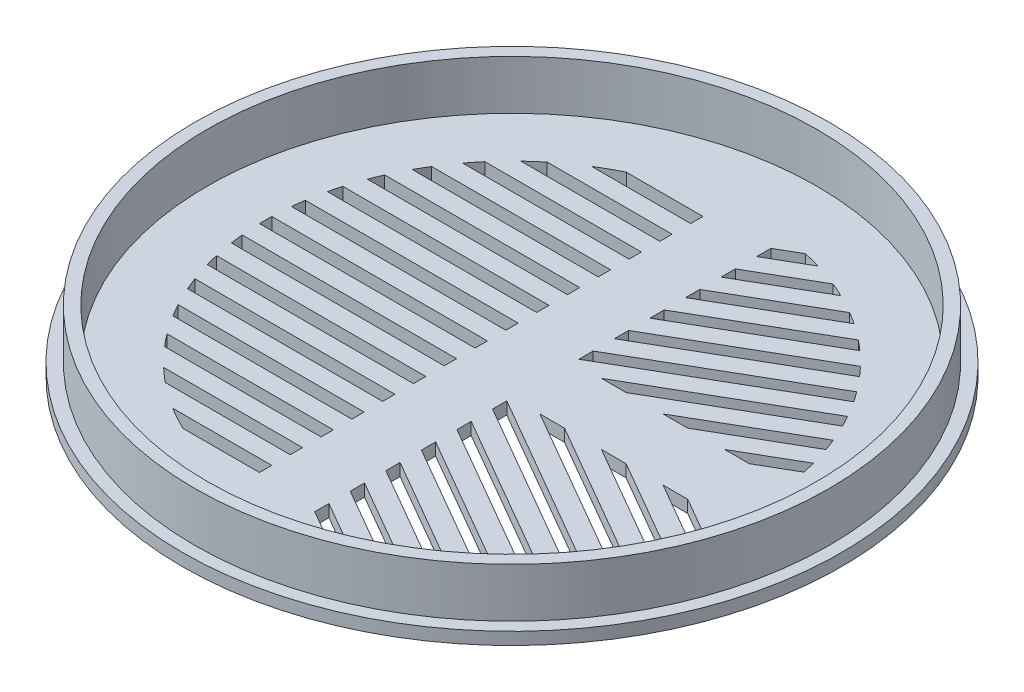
ISO-10303-21;
HEADER;
FILE_DESCRIPTION(('STEP AP214'),'2;1');
FILE_NAME('part.step','',(''),(''),'','','');
FILE_SCHEMA(('AUTOMOTIVE_DESIGN { 1 0 10303 214 1 1 1 1 }'));
ENDSEC;
DATA;
#1=APPLICATION_CONTEXT('core data for automotive mechanical design processes');
#2=APPLICATION_PROTOCOL_DEFINITION('international standard','automotive_design',2000,#1);
#3=PRODUCT_CONTEXT('',#1,'mechanical');
#4=PRODUCT('Part','Part','',(#3));
#5=PRODUCT_RELATED_PRODUCT_CATEGORY('part','',(#4));
#6=PRODUCT_DEFINITION_FORMATION('','',#4);
#7=PRODUCT_DEFINITION_CONTEXT('part definition',#1,'design');
#8=PRODUCT_DEFINITION('design','',#6,#7);
#9=PRODUCT_DEFINITION_SHAPE('','',#8);
#10=(LENGTH_UNIT() NAMED_UNIT(*) SI_UNIT(.MILLI.,.METRE.));
#11=(NAMED_UNIT(*) PLANE_ANGLE_UNIT() SI_UNIT($,.RADIAN.));
#12=(NAMED_UNIT(*) SI_UNIT($,.STERADIAN.) SOLID_ANGLE_UNIT());
#13=UNCERTAINTY_MEASURE_WITH_UNIT(LENGTH_MEASURE(1.E-05),#10,'distance_accuracy_value','');
#14=(GEOMETRIC_REPRESENTATION_CONTEXT(3) GLOBAL_UNCERTAINTY_ASSIGNED_CONTEXT((#13)) GLOBAL_UNIT_ASSIGNED_CONTEXT((#10,
#11,#12)) REPRESENTATION_CONTEXT('',''));
#15=CARTESIAN_POINT('',(0.,0.,0.));
#16=DIRECTION('',(0.,0.,1.));
#17=DIRECTION('',(1.,0.,0.));
#18=AXIS2_PLACEMENT_3D('',#15,#16,#17);
#19=CARTESIAN_POINT('',(0.,2.,0.));
#20=DIRECTION('',(0.,1.,0.));
#21=DIRECTION('',(0.,0.,1.));
#22=AXIS2_PLACEMENT_3D('',#19,#20,#21);
#23=PLANE('',#22);
#24=DIRECTION('',(0.,0.,-1.));
#25=VECTOR('',#24,1.);
#26=CARTESIAN_POINT('',(-5.0000000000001,2.,0.));
#27=LINE('',#26,#25);
#28=CARTESIAN_POINT('',(-5.0000000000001,2.,-34.));
#29=VERTEX_POINT('',#28);
#30=CARTESIAN_POINT('',(-5.0000000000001,2.,-36.));
#31=VERTEX_POINT('',#30);
#32=EDGE_CURVE('E1604',#29,#31,#27,.T.);
#33=ORIENTED_EDGE('',*,*,#32,.F.);
#34=DIRECTION('',(1.,0.,0.));
#35=VECTOR('',#34,1.);
#36=CARTESIAN_POINT('',(0.,2.,-34.));
#37=LINE('',#36,#35);
#38=CARTESIAN_POINT('',(-21.0713075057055,2.,-34.));
#39=VERTEX_POINT('',#38);
#40=EDGE_CURVE('E1602',#39,#29,#37,.T.);
#41=ORIENTED_EDGE('',*,*,#40,.F.);
#42=CARTESIAN_POINT('',(0.,2.,0.));
#43=DIRECTION('',(0.,1.,0.));
#44=DIRECTION('',(0.,0.,1.));
#45=AXIS2_PLACEMENT_3D('',#42,#43,#44);
#46=CIRCLE('',#45,40.);
#47=CARTESIAN_POINT('',(-17.4355957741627,2.,-36.));
#48=VERTEX_POINT('',#47);
#49=EDGE_CURVE('E1600',#48,#39,#46,.T.);
#50=ORIENTED_EDGE('',*,*,#49,.F.);
#51=DIRECTION('',(-1.,0.,0.));
#52=VECTOR('',#51,1.);
#53=CARTESIAN_POINT('',(0.,2.,-36.));
#54=LINE('',#53,#52);
#55=EDGE_CURVE('E1591',#31,#48,#54,.T.);
#56=ORIENTED_EDGE('',*,*,#55,.F.);
#57=EDGE_LOOP('',(#33,#41,#50,#56));
#58=FACE_BOUND('',#57,.T.);
#59=DIRECTION('',(0.,0.,-1.));
#60=VECTOR('',#59,1.);
#61=CARTESIAN_POINT('',(-5.00000000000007,2.,0.));
#62=LINE('',#61,#60);
#63=CARTESIAN_POINT('',(-5.00000000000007,2.,-24.));
#64=VERTEX_POINT('',#63);
#65=CARTESIAN_POINT('',(-5.00000000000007,2.,-26.));
#66=VERTEX_POINT('',#65);
#67=EDGE_CURVE('E1467',#64,#66,#62,.T.);
#68=ORIENTED_EDGE('',*,*,#67,.F.);
#69=DIRECTION('',(1.,0.,0.));
#70=VECTOR('',#69,1.);
#71=CARTESIAN_POINT('',(0.,2.,-24.));
#72=LINE('',#71,#70);
#73=CARTESIAN_POINT('',(-32.,2.,-24.));
#74=VERTEX_POINT('',#73);
#75=EDGE_CURVE('E1465',#74,#64,#72,.T.);
#76=ORIENTED_EDGE('',*,*,#75,.F.);
#77=CARTESIAN_POINT('',(0.,2.,0.));
#78=DIRECTION('',(0.,1.,0.));
#79=DIRECTION('',(0.,0.,1.));
#80=AXIS2_PLACEMENT_3D('',#77,#78,#79);
#81=CIRCLE('',#80,40.);
#82=CARTESIAN_POINT('',(-30.3973683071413,2.,-26.));
#83=VERTEX_POINT('',#82);
#84=EDGE_CURVE('E1463',#83,#74,#81,.T.);
#85=ORIENTED_EDGE('',*,*,#84,.F.);
#86=DIRECTION('',(-1.,0.,0.));
#87=VECTOR('',#86,1.);
#88=CARTESIAN_POINT('',(0.,2.,-26.));
#89=LINE('',#88,#87);
#90=EDGE_CURVE('E1432',#66,#83,#89,.T.);
#91=ORIENTED_EDGE('',*,*,#90,.F.);
#92=EDGE_LOOP('',(#68,#76,#85,#91));
#93=FACE_BOUND('',#92,.T.);
#94=CARTESIAN_POINT('',(0.,2.,0.));
#95=DIRECTION('',(0.,1.,0.));
#96=DIRECTION('',(0.,0.,1.));
#97=AXIS2_PLACEMENT_3D('',#94,#95,#96);
#98=CIRCLE('',#97,40.);
#99=CARTESIAN_POINT('',(-32.,2.,24.));
#100=VERTEX_POINT('',#99);
#101=CARTESIAN_POINT('',(-30.3973683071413,2.,26.));
#102=VERTEX_POINT('',#101);
#103=EDGE_CURVE('E1476',#100,#102,#98,.T.);
#104=ORIENTED_EDGE('',*,*,#103,.F.);
#105=DIRECTION('',(-1.,0.,0.));
#106=VECTOR('',#105,1.);
#107=CARTESIAN_POINT('',(0.,2.,24.));
#108=LINE('',#107,#106);
#109=CARTESIAN_POINT('',(-5.00000000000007,2.,24.));
#110=VERTEX_POINT('',#109);
#111=EDGE_CURVE('E1474',#110,#100,#108,.T.);
#112=ORIENTED_EDGE('',*,*,#111,.F.);
#113=DIRECTION('',(0.,0.,-1.));
#114=VECTOR('',#113,1.);
#115=CARTESIAN_POINT('',(-5.00000000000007,2.,0.));
#116=LINE('',#115,#114);
#117=CARTESIAN_POINT('',(-5.00000000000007,2.,26.));
#118=VERTEX_POINT('',#117);
#119=EDGE_CURVE('E1472',#118,#110,#116,.T.);
#120=ORIENTED_EDGE('',*,*,#119,.F.);
#121=DIRECTION('',(1.,0.,0.));
#122=VECTOR('',#121,1.);
#123=CARTESIAN_POINT('',(0.,2.,26.));
#124=LINE('',#123,#122);
#125=EDGE_CURVE('E1470',#102,#118,#124,.T.);
#126=ORIENTED_EDGE('',*,*,#125,.F.);
#127=EDGE_LOOP('',(#104,#112,#120,#126));
#128=FACE_BOUND('',#127,.T.);
#129=DIRECTION('',(0.,0.,-1.));
#130=VECTOR('',#129,1.);
#131=CARTESIAN_POINT('',(-5.00000000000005,2.,0.));
#132=LINE('',#131,#130);
#133=CARTESIAN_POINT('',(-5.00000000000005,2.,-19.));
#134=VERTEX_POINT('',#133);
#135=CARTESIAN_POINT('',(-5.00000000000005,2.,-21.));
#136=VERTEX_POINT('',#135);
#137=EDGE_CURVE('E1485',#134,#136,#132,.T.);
#138=ORIENTED_EDGE('',*,*,#137,.F.);
#139=DIRECTION('',(1.,0.,0.));
#140=VECTOR('',#139,1.);
#141=CARTESIAN_POINT('',(0.,2.,-19.));
#142=LINE('',#141,#140);
#143=CARTESIAN_POINT('',(-35.1994318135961,2.,-19.));
#144=VERTEX_POINT('',#143);
#145=EDGE_CURVE('E1483',#144,#134,#142,.T.);
#146=ORIENTED_EDGE('',*,*,#145,.F.);
#147=CARTESIAN_POINT('',(0.,2.,0.));
#148=DIRECTION('',(0.,1.,0.));
#149=DIRECTION('',(0.,0.,1.));
#150=AXIS2_PLACEMENT_3D('',#147,#148,#149);
#151=CIRCLE('',#150,40.);
#152=CARTESIAN_POINT('',(-34.0440890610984,2.,-21.));
#153=VERTEX_POINT('',#152);
#154=EDGE_CURVE('E1481',#153,#144,#151,.T.);
#155=ORIENTED_EDGE('',*,*,#154,.F.);
#156=DIRECTION('',(-1.,0.,0.));
#157=VECTOR('',#156,1.);
#158=CARTESIAN_POINT('',(0.,2.,-21.));
#159=LINE('',#158,#157);
#160=EDGE_CURVE('E1479',#136,#153,#159,.T.);
#161=ORIENTED_EDGE('',*,*,#160,.F.);
#162=EDGE_LOOP('',(#138,#146,#155,#161));
#163=FACE_BOUND('',#162,.T.);
#164=CARTESIAN_POINT('',(0.,2.,0.));
#165=DIRECTION('',(0.,1.,0.));
#166=DIRECTION('',(0.,0.,1.));
#167=AXIS2_PLACEMENT_3D('',#164,#165,#166);
#168=CIRCLE('',#167,40.);
#169=CARTESIAN_POINT('',(-39.5474398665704,2.,-6.));
#170=VERTEX_POINT('',#169);
#171=CARTESIAN_POINT('',(-39.7994974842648,2.,-4.));
#172=VERTEX_POINT('',#171);
#173=EDGE_CURVE('E1494',#170,#172,#168,.T.);
#174=ORIENTED_EDGE('',*,*,#173,.F.);
#175=DIRECTION('',(-1.,0.,0.));
#176=VECTOR('',#175,1.);
#177=CARTESIAN_POINT('',(0.,2.,-6.));
#178=LINE('',#177,#176);
#179=CARTESIAN_POINT('',(-5.,2.,-6.));
#180=VERTEX_POINT('',#179);
#181=EDGE_CURVE('E1492',#180,#170,#178,.T.);
#182=ORIENTED_EDGE('',*,*,#181,.F.);
#183=DIRECTION('',(0.,0.,-1.));
#184=VECTOR('',#183,1.);
#185=CARTESIAN_POINT('',(-5.,2.,0.));
#186=LINE('',#185,#184);
#187=CARTESIAN_POINT('',(-5.,2.,-4.));
#188=VERTEX_POINT('',#187);
#189=EDGE_CURVE('E1490',#188,#180,#186,.T.);
#190=ORIENTED_EDGE('',*,*,#189,.F.);
#191=DIRECTION('',(1.,0.,0.));
#192=VECTOR('',#191,1.);
#193=CARTESIAN_POINT('',(0.,2.,-4.));
#194=LINE('',#193,#192);
#195=EDGE_CURVE('E1488',#172,#188,#194,.T.);
#196=ORIENTED_EDGE('',*,*,#195,.F.);
#197=EDGE_LOOP('',(#174,#182,#190,#196));
#198=FACE_BOUND('',#197,.T.);
#199=CARTESIAN_POINT('',(0.,2.,0.));
#200=DIRECTION('',(0.,1.,0.));
#201=DIRECTION('',(0.,0.,1.));
#202=AXIS2_PLACEMENT_3D('',#199,#200,#201);
#203=CIRCLE('',#202,40.);
#204=CARTESIAN_POINT('',(-27.5499546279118,2.,29.));
#205=VERTEX_POINT('',#204);
#206=CARTESIAN_POINT('',(-25.2784493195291,2.,31.));
#207=VERTEX_POINT('',#206);
#208=EDGE_CURVE('E1503',#205,#207,#203,.T.);
#209=ORIENTED_EDGE('',*,*,#208,.F.);
#210=DIRECTION('',(-1.,0.,0.));
#211=VECTOR('',#210,1.);
#212=CARTESIAN_POINT('',(0.,2.,29.));
#213=LINE('',#212,#211);
#214=CARTESIAN_POINT('',(-5.00000000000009,2.,29.));
#215=VERTEX_POINT('',#214);
#216=EDGE_CURVE('E1501',#215,#205,#213,.T.);
#217=ORIENTED_EDGE('',*,*,#216,.F.);
#218=DIRECTION('',(0.,0.,-1.));
#219=VECTOR('',#218,1.);
#220=CARTESIAN_POINT('',(-5.00000000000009,2.,0.));
#221=LINE('',#220,#219);
#222=CARTESIAN_POINT('',(-5.00000000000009,2.,31.));
#223=VERTEX_POINT('',#222);
#224=EDGE_CURVE('E1499',#223,#215,#221,.T.);
#225=ORIENTED_EDGE('',*,*,#224,.F.);
#226=DIRECTION('',(1.,0.,0.));
#227=VECTOR('',#226,1.);
#228=CARTESIAN_POINT('',(0.,2.,31.));
#229=LINE('',#228,#227);
#230=EDGE_CURVE('E1497',#207,#223,#229,.T.);
#231=ORIENTED_EDGE('',*,*,#230,.F.);
#232=EDGE_LOOP('',(#209,#217,#225,#231));
#233=FACE_BOUND('',#232,.T.);
#234=CARTESIAN_POINT('',(0.,2.,0.));
#235=DIRECTION('',(0.,1.,0.));
#236=DIRECTION('',(0.,0.,1.));
#237=AXIS2_PLACEMENT_3D('',#234,#235,#236);
#238=CIRCLE('',#237,40.);
#239=CARTESIAN_POINT('',(-38.4577690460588,2.,-11.));
#240=VERTEX_POINT('',#239);
#241=CARTESIAN_POINT('',(-38.9743505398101,2.,-9.));
#242=VERTEX_POINT('',#241);
#243=EDGE_CURVE('E1512',#240,#242,#238,.T.);
#244=ORIENTED_EDGE('',*,*,#243,.F.);
#245=DIRECTION('',(-1.,0.,0.));
#246=VECTOR('',#245,1.);
#247=CARTESIAN_POINT('',(0.,2.,-11.));
#248=LINE('',#247,#246);
#249=CARTESIAN_POINT('',(-5.00000000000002,2.,-11.));
#250=VERTEX_POINT('',#249);
#251=EDGE_CURVE('E1510',#250,#240,#248,.T.);
#252=ORIENTED_EDGE('',*,*,#251,.F.);
#253=DIRECTION('',(0.,0.,-1.));
#254=VECTOR('',#253,1.);
#255=CARTESIAN_POINT('',(-5.00000000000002,2.,0.));
#256=LINE('',#255,#254);
#257=CARTESIAN_POINT('',(-5.00000000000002,2.,-9.));
#258=VERTEX_POINT('',#257);
#259=EDGE_CURVE('E1508',#258,#250,#256,.T.);
#260=ORIENTED_EDGE('',*,*,#259,.F.);
#261=DIRECTION('',(1.,0.,0.));
#262=VECTOR('',#261,1.);
#263=CARTESIAN_POINT('',(0.,2.,-9.));
#264=LINE('',#263,#262);
#265=EDGE_CURVE('E1506',#242,#258,#264,.T.);
#266=ORIENTED_EDGE('',*,*,#265,.F.);
#267=EDGE_LOOP('',(#244,#252,#260,#266));
#268=FACE_BOUND('',#267,.T.);
#269=CARTESIAN_POINT('',(0.,2.,0.));
#270=DIRECTION('',(0.,1.,0.));
#271=DIRECTION('',(0.,0.,1.));
#272=AXIS2_PLACEMENT_3D('',#269,#270,#271);
#273=CIRCLE('',#272,40.);
#274=CARTESIAN_POINT('',(-25.2784493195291,2.,-31.));
#275=VERTEX_POINT('',#274);
#276=CARTESIAN_POINT('',(-27.5499546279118,2.,-29.));
#277=VERTEX_POINT('',#276);
#278=EDGE_CURVE('E1521',#275,#277,#273,.T.);
#279=ORIENTED_EDGE('',*,*,#278,.F.);
#280=DIRECTION('',(-1.,0.,0.));
#281=VECTOR('',#280,1.);
#282=CARTESIAN_POINT('',(0.,2.,-31.));
#283=LINE('',#282,#281);
#284=CARTESIAN_POINT('',(-5.00000000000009,2.,-31.));
#285=VERTEX_POINT('',#284);
#286=EDGE_CURVE('E1519',#285,#275,#283,.T.);
#287=ORIENTED_EDGE('',*,*,#286,.F.);
#288=DIRECTION('',(0.,0.,-1.));
#289=VECTOR('',#288,1.);
#290=CARTESIAN_POINT('',(-5.00000000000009,2.,0.));
#291=LINE('',#290,#289);
#292=CARTESIAN_POINT('',(-5.00000000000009,2.,-29.));
#293=VERTEX_POINT('',#292);
#294=EDGE_CURVE('E1517',#293,#285,#291,.T.);
#295=ORIENTED_EDGE('',*,*,#294,.F.);
#296=DIRECTION('',(1.,0.,0.));
#297=VECTOR('',#296,1.);
#298=CARTESIAN_POINT('',(0.,2.,-29.));
#299=LINE('',#298,#297);
#300=EDGE_CURVE('E1515',#277,#293,#299,.T.);
#301=ORIENTED_EDGE('',*,*,#300,.F.);
#302=EDGE_LOOP('',(#279,#287,#295,#301));
#303=FACE_BOUND('',#302,.T.);
#304=CARTESIAN_POINT('',(0.,2.,0.));
#305=DIRECTION('',(0.,1.,0.));
#306=DIRECTION('',(0.,0.,1.));
#307=AXIS2_PLACEMENT_3D('',#304,#305,#306);
#308=CIRCLE('',#307,40.);
#309=CARTESIAN_POINT('',(-38.9743505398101,2.,9.));
#310=VERTEX_POINT('',#309);
#311=CARTESIAN_POINT('',(-38.4577690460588,2.,11.));
#312=VERTEX_POINT('',#311);
#313=EDGE_CURVE('E1530',#310,#312,#308,.T.);
#314=ORIENTED_EDGE('',*,*,#313,.F.);
#315=DIRECTION('',(-1.,0.,0.));
#316=VECTOR('',#315,1.);
#317=CARTESIAN_POINT('',(0.,2.,9.));
#318=LINE('',#317,#316);
#319=CARTESIAN_POINT('',(-5.00000000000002,2.,9.));
#320=VERTEX_POINT('',#319);
#321=EDGE_CURVE('E1528',#320,#310,#318,.T.);
#322=ORIENTED_EDGE('',*,*,#321,.F.);
#323=DIRECTION('',(0.,0.,-1.));
#324=VECTOR('',#323,1.);
#325=CARTESIAN_POINT('',(-5.00000000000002,2.,0.));
#326=LINE('',#325,#324);
#327=CARTESIAN_POINT('',(-5.00000000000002,2.,11.));
#328=VERTEX_POINT('',#327);
#329=EDGE_CURVE('E1526',#328,#320,#326,.T.);
#330=ORIENTED_EDGE('',*,*,#329,.F.);
#331=DIRECTION('',(1.,0.,0.));
#332=VECTOR('',#331,1.);
#333=CARTESIAN_POINT('',(0.,2.,11.));
#334=LINE('',#333,#332);
#335=EDGE_CURVE('E1524',#312,#328,#334,.T.);
#336=ORIENTED_EDGE('',*,*,#335,.F.);
#337=EDGE_LOOP('',(#314,#322,#330,#336));
#338=FACE_BOUND('',#337,.T.);
#339=CARTESIAN_POINT('',(0.,2.,0.));
#340=DIRECTION('',(0.,1.,0.));
#341=DIRECTION('',(0.,0.,1.));
#342=AXIS2_PLACEMENT_3D('',#339,#340,#341);
#343=CIRCLE('',#342,40.);
#344=CARTESIAN_POINT('',(-39.7994974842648,2.,4.));
#345=VERTEX_POINT('',#344);
#346=CARTESIAN_POINT('',(-39.5474398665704,2.,6.));
#347=VERTEX_POINT('',#346);
#348=EDGE_CURVE('E1539',#345,#347,#343,.T.);
#349=ORIENTED_EDGE('',*,*,#348,.F.);
#350=DIRECTION('',(-1.,0.,0.));
#351=VECTOR('',#350,1.);
#352=CARTESIAN_POINT('',(0.,2.,4.));
#353=LINE('',#352,#351);
#354=CARTESIAN_POINT('',(-5.,2.,4.));
#355=VERTEX_POINT('',#354);
#356=EDGE_CURVE('E1537',#355,#345,#353,.T.);
#357=ORIENTED_EDGE('',*,*,#356,.F.);
#358=DIRECTION('',(0.,0.,-1.));
#359=VECTOR('',#358,1.);
#360=CARTESIAN_POINT('',(-5.,2.,0.));
#361=LINE('',#360,#359);
#362=CARTESIAN_POINT('',(-5.,2.,6.));
#363=VERTEX_POINT('',#362);
#364=EDGE_CURVE('E1535',#363,#355,#361,.T.);
#365=ORIENTED_EDGE('',*,*,#364,.F.);
#366=DIRECTION('',(1.,0.,0.));
#367=VECTOR('',#366,1.);
#368=CARTESIAN_POINT('',(0.,2.,6.));
#369=LINE('',#368,#367);
#370=EDGE_CURVE('E1533',#347,#363,#369,.T.);
#371=ORIENTED_EDGE('',*,*,#370,.F.);
#372=EDGE_LOOP('',(#349,#357,#365,#371));
#373=FACE_BOUND('',#372,.T.);
#374=DIRECTION('',(0.,0.,-1.));
#375=VECTOR('',#374,1.);
#376=CARTESIAN_POINT('',(-4.99999999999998,2.,0.));
#377=LINE('',#376,#375);
#378=CARTESIAN_POINT('',(-4.99999999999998,2.,1.));
#379=VERTEX_POINT('',#378);
#380=CARTESIAN_POINT('',(-4.99999999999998,2.,-1.));
#381=VERTEX_POINT('',#380);
#382=EDGE_CURVE('E1548',#379,#381,#377,.T.);
#383=ORIENTED_EDGE('',*,*,#382,.F.);
#384=DIRECTION('',(1.,0.,0.));
#385=VECTOR('',#384,1.);
#386=CARTESIAN_POINT('',(0.,2.,1.));
#387=LINE('',#386,#385);
#388=CARTESIAN_POINT('',(-39.9874980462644,2.,1.00000000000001));
#389=VERTEX_POINT('',#388);
#390=EDGE_CURVE('E1546',#389,#379,#387,.T.);
#391=ORIENTED_EDGE('',*,*,#390,.F.);
#392=CARTESIAN_POINT('',(0.,2.,0.));
#393=DIRECTION('',(0.,1.,0.));
#394=DIRECTION('',(0.,0.,1.));
#395=AXIS2_PLACEMENT_3D('',#392,#393,#394);
#396=CIRCLE('',#395,40.);
#397=CARTESIAN_POINT('',(-39.9874980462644,2.,-1.));
#398=VERTEX_POINT('',#397);
#399=EDGE_CURVE('E1544',#398,#389,#396,.T.);
#400=ORIENTED_EDGE('',*,*,#399,.F.);
#401=DIRECTION('',(-1.,0.,0.));
#402=VECTOR('',#401,1.);
#403=CARTESIAN_POINT('',(0.,2.,-1.));
#404=LINE('',#403,#402);
#405=EDGE_CURVE('E1542',#381,#398,#404,.T.);
#406=ORIENTED_EDGE('',*,*,#405,.F.);
#407=EDGE_LOOP('',(#383,#391,#400,#406));
#408=FACE_BOUND('',#407,.T.);
#409=CARTESIAN_POINT('',(0.,2.,0.));
#410=DIRECTION('',(0.,1.,0.));
#411=DIRECTION('',(0.,0.,1.));
#412=AXIS2_PLACEMENT_3D('',#409,#410,#411);
#413=CIRCLE('',#412,40.);
#414=CARTESIAN_POINT('',(-21.0713075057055,2.,34.));
#415=VERTEX_POINT('',#414);
#416=CARTESIAN_POINT('',(-17.4355957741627,2.,36.));
#417=VERTEX_POINT('',#416);
#418=EDGE_CURVE('E1557',#415,#417,#413,.T.);
#419=ORIENTED_EDGE('',*,*,#418,.F.);
#420=DIRECTION('',(-1.,0.,0.));
#421=VECTOR('',#420,1.);
#422=CARTESIAN_POINT('',(0.,2.,34.));
#423=LINE('',#422,#421);
#424=CARTESIAN_POINT('',(-5.0000000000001,2.,34.));
#425=VERTEX_POINT('',#424);
#426=EDGE_CURVE('E1555',#425,#415,#423,.T.);
#427=ORIENTED_EDGE('',*,*,#426,.F.);
#428=DIRECTION('',(0.,0.,-1.));
#429=VECTOR('',#428,1.);
#430=CARTESIAN_POINT('',(-5.0000000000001,2.,0.));
#431=LINE('',#430,#429);
#432=CARTESIAN_POINT('',(-5.0000000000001,2.,36.));
#433=VERTEX_POINT('',#432);
#434=EDGE_CURVE('E1553',#433,#425,#431,.T.);
#435=ORIENTED_EDGE('',*,*,#434,.F.);
#436=DIRECTION('',(1.,0.,0.));
#437=VECTOR('',#436,1.);
#438=CARTESIAN_POINT('',(0.,2.,36.));
#439=LINE('',#438,#437);
#440=EDGE_CURVE('E1551',#417,#433,#439,.T.);
#441=ORIENTED_EDGE('',*,*,#440,.F.);
#442=EDGE_LOOP('',(#419,#427,#435,#441));
#443=FACE_BOUND('',#442,.T.);
#444=CARTESIAN_POINT('',(0.,2.,0.));
#445=DIRECTION('',(0.,1.,0.));
#446=DIRECTION('',(0.,0.,1.));
#447=AXIS2_PLACEMENT_3D('',#444,#445,#446);
#448=CIRCLE('',#447,40.);
#449=CARTESIAN_POINT('',(-37.4699879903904,2.,14.));
#450=VERTEX_POINT('',#449);
#451=CARTESIAN_POINT('',(-36.6606055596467,2.,16.));
#452=VERTEX_POINT('',#451);
#453=EDGE_CURVE('E1566',#450,#452,#448,.T.);
#454=ORIENTED_EDGE('',*,*,#453,.F.);
#455=DIRECTION('',(-1.,0.,0.));
#456=VECTOR('',#455,1.);
#457=CARTESIAN_POINT('',(0.,2.,14.));
#458=LINE('',#457,#456);
#459=CARTESIAN_POINT('',(-5.00000000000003,2.,14.));
#460=VERTEX_POINT('',#459);
#461=EDGE_CURVE('E1564',#460,#450,#458,.T.);
#462=ORIENTED_EDGE('',*,*,#461,.F.);
#463=DIRECTION('',(0.,0.,-1.));
#464=VECTOR('',#463,1.);
#465=CARTESIAN_POINT('',(-5.00000000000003,2.,0.));
#466=LINE('',#465,#464);
#467=CARTESIAN_POINT('',(-5.00000000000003,2.,16.));
#468=VERTEX_POINT('',#467);
#469=EDGE_CURVE('E1562',#468,#460,#466,.T.);
#470=ORIENTED_EDGE('',*,*,#469,.F.);
#471=DIRECTION('',(1.,0.,0.));
#472=VECTOR('',#471,1.);
#473=CARTESIAN_POINT('',(0.,2.,16.));
#474=LINE('',#473,#472);
#475=EDGE_CURVE('E1560',#452,#468,#474,.T.);
#476=ORIENTED_EDGE('',*,*,#475,.F.);
#477=EDGE_LOOP('',(#454,#462,#470,#476));
#478=FACE_BOUND('',#477,.T.);
#479=DIRECTION('',(0.,0.,-1.));
#480=VECTOR('',#479,1.);
#481=CARTESIAN_POINT('',(-5.00000000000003,2.,0.));
#482=LINE('',#481,#480);
#483=CARTESIAN_POINT('',(-5.00000000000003,2.,-14.));
#484=VERTEX_POINT('',#483);
#485=CARTESIAN_POINT('',(-5.00000000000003,2.,-16.));
#486=VERTEX_POINT('',#485);
#487=EDGE_CURVE('E1575',#484,#486,#482,.T.);
#488=ORIENTED_EDGE('',*,*,#487,.F.);
#489=DIRECTION('',(1.,0.,0.));
#490=VECTOR('',#489,1.);
#491=CARTESIAN_POINT('',(0.,2.,-14.));
#492=LINE('',#491,#490);
#493=CARTESIAN_POINT('',(-37.4699879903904,2.,-14.));
#494=VERTEX_POINT('',#493);
#495=EDGE_CURVE('E1573',#494,#484,#492,.T.);
#496=ORIENTED_EDGE('',*,*,#495,.F.);
#497=CARTESIAN_POINT('',(0.,2.,0.));
#498=DIRECTION('',(0.,1.,0.));
#499=DIRECTION('',(0.,0.,1.));
#500=AXIS2_PLACEMENT_3D('',#497,#498,#499);
#501=CIRCLE('',#500,40.);
#502=CARTESIAN_POINT('',(-36.6606055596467,2.,-16.));
#503=VERTEX_POINT('',#502);
#504=EDGE_CURVE('E1571',#503,#494,#501,.T.);
#505=ORIENTED_EDGE('',*,*,#504,.F.);
#506=DIRECTION('',(-1.,0.,0.));
#507=VECTOR('',#506,1.);
#508=CARTESIAN_POINT('',(0.,2.,-16.));
#509=LINE('',#508,#507);
#510=EDGE_CURVE('E1569',#486,#503,#509,.T.);
#511=ORIENTED_EDGE('',*,*,#510,.F.);
#512=EDGE_LOOP('',(#488,#496,#505,#511));
#513=FACE_BOUND('',#512,.T.);
#514=CARTESIAN_POINT('',(0.,2.,0.));
#515=DIRECTION('',(0.,1.,0.));
#516=DIRECTION('',(0.,0.,1.));
#517=AXIS2_PLACEMENT_3D('',#514,#515,#516);
#518=CIRCLE('',#517,40.);
#519=CARTESIAN_POINT('',(-35.1994318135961,2.,19.));
#520=VERTEX_POINT('',#519);
#521=CARTESIAN_POINT('',(-34.0440890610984,2.,21.));
#522=VERTEX_POINT('',#521);
#523=EDGE_CURVE('E1584',#520,#522,#518,.T.);
#524=ORIENTED_EDGE('',*,*,#523,.F.);
#525=DIRECTION('',(-1.,0.,0.));
#526=VECTOR('',#525,1.);
#527=CARTESIAN_POINT('',(0.,2.,19.));
#528=LINE('',#527,#526);
#529=CARTESIAN_POINT('',(-5.00000000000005,2.,19.));
#530=VERTEX_POINT('',#529);
#531=EDGE_CURVE('E1582',#530,#520,#528,.T.);
#532=ORIENTED_EDGE('',*,*,#531,.F.);
#533=DIRECTION('',(0.,0.,-1.));
#534=VECTOR('',#533,1.);
#535=CARTESIAN_POINT('',(-5.00000000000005,2.,0.));
#536=LINE('',#535,#534);
#537=CARTESIAN_POINT('',(-5.00000000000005,2.,21.));
#538=VERTEX_POINT('',#537);
#539=EDGE_CURVE('E1580',#538,#530,#536,.T.);
#540=ORIENTED_EDGE('',*,*,#539,.F.);
#541=DIRECTION('',(1.,0.,0.));
#542=VECTOR('',#541,1.);
#543=CARTESIAN_POINT('',(0.,2.,21.));
#544=LINE('',#543,#542);
#545=EDGE_CURVE('E1578',#522,#538,#544,.T.);
#546=ORIENTED_EDGE('',*,*,#545,.F.);
#547=EDGE_LOOP('',(#524,#532,#540,#546));
#548=FACE_BOUND('',#547,.T.);
#549=DIRECTION('',(-0.866025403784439,0.,0.499999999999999));
#550=VECTOR('',#549,1.);
#551=CARTESIAN_POINT('',(0.216506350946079,2.,0.374999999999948));
#552=LINE('',#551,#550);
#553=CARTESIAN_POINT('',(34.8554926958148,2.,-19.6238280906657));
#554=VERTEX_POINT('',#553);
#555=CARTESIAN_POINT('',(9.52627944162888,2.,-5.00000000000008));
#556=VERTEX_POINT('',#555);
#557=EDGE_CURVE('E1304',#554,#556,#552,.T.);
#558=ORIENTED_EDGE('',*,*,#557,.F.);
#559=CARTESIAN_POINT('',(0.,2.,0.));
#560=DIRECTION('',(0.,1.,0.));
#561=DIRECTION('',(0.,0.,1.));
#562=AXIS2_PLACEMENT_3D('',#559,#560,#561);
#563=CIRCLE('',#562,40.);
#564=CARTESIAN_POINT('',(35.7933821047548,2.,-17.8559177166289));
#565=VERTEX_POINT('',#564);
#566=EDGE_CURVE('E1302',#565,#554,#563,.T.);
#567=ORIENTED_EDGE('',*,*,#566,.F.);
#568=DIRECTION('',(0.866025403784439,0.,-0.499999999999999));
#569=VECTOR('',#568,1.);
#570=CARTESIAN_POINT('',(1.21650635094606,2.,2.10705080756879));
#571=LINE('',#570,#569);
#572=CARTESIAN_POINT('',(13.5262794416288,2.,-5.00000000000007));
#573=VERTEX_POINT('',#572);
#574=EDGE_CURVE('E1300',#573,#565,#571,.T.);
#575=ORIENTED_EDGE('',*,*,#574,.F.);
#576=DIRECTION('',(1.,0.,0.));
#577=VECTOR('',#576,1.);
#578=CARTESIAN_POINT('',(0.,2.,-5.00000000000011));
#579=LINE('',#578,#577);
#580=EDGE_CURVE('E1291',#556,#573,#579,.T.);
#581=ORIENTED_EDGE('',*,*,#580,.F.);
#582=EDGE_LOOP('',(#558,#567,#575,#581));
#583=FACE_BOUND('',#582,.T.);
#584=DIRECTION('',(-0.866025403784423,0.,0.500000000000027));
#585=VECTOR('',#584,1.);
#586=CARTESIAN_POINT('',(5.21650635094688,2.,9.03525403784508));
#587=LINE('',#586,#585);
#588=CARTESIAN_POINT('',(38.6584588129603,2.,-10.2724662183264));
#589=VERTEX_POINT('',#588);
#590=CARTESIAN_POINT('',(29.5262794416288,2.,-4.99999999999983));
#591=VERTEX_POINT('',#590);
#592=EDGE_CURVE('E1221',#589,#591,#587,.T.);
#593=ORIENTED_EDGE('',*,*,#592,.F.);
#594=CARTESIAN_POINT('',(0.,2.,0.));
#595=DIRECTION('',(0.,1.,0.));
#596=DIRECTION('',(0.,0.,1.));
#597=AXIS2_PLACEMENT_3D('',#594,#595,#596);
#598=CIRCLE('',#597,40.);
#599=CARTESIAN_POINT('',(39.1416509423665,2.,-8.24203624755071));
#600=VERTEX_POINT('',#599);
#601=EDGE_CURVE('E1219',#600,#589,#598,.T.);
#602=ORIENTED_EDGE('',*,*,#601,.F.);
#603=DIRECTION('',(0.866025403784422,0.,-0.500000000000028));
#604=VECTOR('',#603,1.);
#605=CARTESIAN_POINT('',(6.21650635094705,2.,10.7673048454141));
#606=LINE('',#605,#604);
#607=CARTESIAN_POINT('',(33.5262794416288,2.,-4.99999999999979));
#608=VERTEX_POINT('',#607);
#609=EDGE_CURVE('E1217',#608,#600,#606,.T.);
#610=ORIENTED_EDGE('',*,*,#609,.F.);
#611=DIRECTION('',(1.,0.,0.));
#612=VECTOR('',#611,1.);
#613=CARTESIAN_POINT('',(0.,2.,-5.00000000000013));
#614=LINE('',#613,#612);
#615=EDGE_CURVE('E1188',#591,#608,#614,.T.);
#616=ORIENTED_EDGE('',*,*,#615,.F.);
#617=EDGE_LOOP('',(#593,#602,#610,#616));
#618=FACE_BOUND('',#617,.T.);
#619=DIRECTION('',(-0.866025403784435,0.,0.500000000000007));
#620=VECTOR('',#619,1.);
#621=CARTESIAN_POINT('',(2.71650635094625,2.,4.70512701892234));
#622=LINE('',#621,#620);
#623=CARTESIAN_POINT('',(37.0364973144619,2.,-15.1095290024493));
#624=VERTEX_POINT('',#623);
#625=CARTESIAN_POINT('',(19.5262794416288,2.,-4.99999999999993));
#626=VERTEX_POINT('',#625);
#627=EDGE_CURVE('E1230',#624,#626,#622,.T.);
#628=ORIENTED_EDGE('',*,*,#627,.F.);
#629=CARTESIAN_POINT('',(0.,2.,0.));
#630=DIRECTION('',(0.,1.,0.));
#631=DIRECTION('',(0.,0.,1.));
#632=AXIS2_PLACEMENT_3D('',#629,#630,#631);
#633=CIRCLE('',#632,40.);
#634=CARTESIAN_POINT('',(37.7541728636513,2.,-13.214478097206));
#635=VERTEX_POINT('',#634);
#636=EDGE_CURVE('E1228',#635,#624,#633,.T.);
#637=ORIENTED_EDGE('',*,*,#636,.F.);
#638=DIRECTION('',(0.866025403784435,0.,-0.500000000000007));
#639=VECTOR('',#638,1.);
#640=CARTESIAN_POINT('',(3.7165063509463,2.,6.43717782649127));
#641=LINE('',#640,#639);
#642=CARTESIAN_POINT('',(23.5262794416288,2.,-4.99999999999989));
#643=VERTEX_POINT('',#642);
#644=EDGE_CURVE('E1226',#643,#635,#641,.T.);
#645=ORIENTED_EDGE('',*,*,#644,.F.);
#646=DIRECTION('',(1.,0.,0.));
#647=VECTOR('',#646,1.);
#648=CARTESIAN_POINT('',(0.,2.,-5.00000000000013));
#649=LINE('',#648,#647);
#650=EDGE_CURVE('E1224',#626,#643,#649,.T.);
#651=ORIENTED_EDGE('',*,*,#650,.F.);
#652=EDGE_LOOP('',(#628,#637,#645,#651));
#653=FACE_BOUND('',#652,.T.);
#654=DIRECTION('',(-0.866025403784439,0.,0.5));
#655=VECTOR('',#654,1.);
#656=CARTESIAN_POINT('',(-12.2834936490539,2.,-21.275635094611));
#657=LINE('',#656,#655);
#658=CARTESIAN_POINT('',(15.0541608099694,2.,-37.0590372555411));
#659=VERTEX_POINT('',#658);
#660=CARTESIAN_POINT('',(5.,2.,-31.2542648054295));
#661=VERTEX_POINT('',#660);
#662=EDGE_CURVE('E1239',#659,#661,#657,.T.);
#663=ORIENTED_EDGE('',*,*,#662,.F.);
#664=CARTESIAN_POINT('',(0.,2.,0.));
#665=DIRECTION('',(0.,1.,0.));
#666=DIRECTION('',(0.,0.,1.));
#667=AXIS2_PLACEMENT_3D('',#664,#665,#666);
#668=CIRCLE('',#667,40.);
#669=CARTESIAN_POINT('',(17.3180502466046,2.,-36.0566933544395));
#670=VERTEX_POINT('',#669);
#671=EDGE_CURVE('E1237',#670,#659,#668,.T.);
#672=ORIENTED_EDGE('',*,*,#671,.F.);
#673=DIRECTION('',(0.866025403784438,0.,-0.500000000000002));
#674=VECTOR('',#673,1.);
#675=CARTESIAN_POINT('',(-11.2834936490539,2.,-19.5435842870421));
#676=LINE('',#675,#674);
#677=CARTESIAN_POINT('',(5.00000000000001,2.,-28.9448637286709));
#678=VERTEX_POINT('',#677);
#679=EDGE_CURVE('E1235',#678,#670,#676,.T.);
#680=ORIENTED_EDGE('',*,*,#679,.F.);
#681=DIRECTION('',(0.,0.,1.));
#682=VECTOR('',#681,1.);
#683=CARTESIAN_POINT('',(5.00000000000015,2.,0.));
#684=LINE('',#683,#682);
#685=EDGE_CURVE('E1233',#661,#678,#684,.T.);
#686=ORIENTED_EDGE('',*,*,#685,.F.);
#687=EDGE_LOOP('',(#663,#672,#680,#686));
#688=FACE_BOUND('',#687,.T.);
#689=DIRECTION('',(0.,0.,1.));
#690=VECTOR('',#689,1.);
#691=CARTESIAN_POINT('',(5.00000000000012,2.,0.));
#692=LINE('',#691,#690);
#693=CARTESIAN_POINT('',(5.00000000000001,2.,-37.0277674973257));
#694=VERTEX_POINT('',#693);
#695=CARTESIAN_POINT('',(5.00000000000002,2.,-34.7183664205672));
#696=VERTEX_POINT('',#695);
#697=EDGE_CURVE('E1248',#694,#696,#692,.T.);
#698=ORIENTED_EDGE('',*,*,#697,.F.);
#699=DIRECTION('',(-0.866025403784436,0.,0.500000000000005));
#700=VECTOR('',#699,1.);
#701=CARTESIAN_POINT('',(-14.783493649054,2.,-25.605762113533));
#702=LINE('',#701,#700);
#703=CARTESIAN_POINT('',(8.54770748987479,2.,-39.076037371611));
#704=VERTEX_POINT('',#703);
#705=EDGE_CURVE('E1246',#704,#694,#702,.T.);
#706=ORIENTED_EDGE('',*,*,#705,.F.);
#707=CARTESIAN_POINT('',(0.,2.,0.));
#708=DIRECTION('',(0.,1.,0.));
#709=DIRECTION('',(0.,0.,1.));
#710=AXIS2_PLACEMENT_3D('',#707,#708,#709);
#711=CIRCLE('',#710,40.);
#712=CARTESIAN_POINT('',(11.3172216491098,2.,-38.3656160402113));
#713=VERTEX_POINT('',#712);
#714=EDGE_CURVE('E1244',#713,#704,#711,.T.);
#715=ORIENTED_EDGE('',*,*,#714,.F.);
#716=DIRECTION('',(0.866025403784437,0.,-0.500000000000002));
#717=VECTOR('',#716,1.);
#718=CARTESIAN_POINT('',(-13.7834936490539,2.,-23.8737113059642));
#719=LINE('',#718,#717);
#720=EDGE_CURVE('E1242',#696,#713,#719,.T.);
#721=ORIENTED_EDGE('',*,*,#720,.F.);
#722=EDGE_LOOP('',(#698,#706,#715,#721));
#723=FACE_BOUND('',#722,.T.);
#724=DIRECTION('',(-0.866025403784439,0.,0.5));
#725=VECTOR('',#724,1.);
#726=CARTESIAN_POINT('',(-4.78349364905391,2.,-8.28525403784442));
#727=LINE('',#726,#725);
#728=CARTESIAN_POINT('',(28.8521208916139,2.,-27.7047851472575));
#729=VERTEX_POINT('',#728);
#730=CARTESIAN_POINT('',(4.99999999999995,2.,-13.9337567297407));
#731=VERTEX_POINT('',#730);
#732=EDGE_CURVE('E1257',#729,#731,#727,.T.);
#733=ORIENTED_EDGE('',*,*,#732,.F.);
#734=CARTESIAN_POINT('',(0.,2.,0.));
#735=DIRECTION('',(0.,1.,0.));
#736=DIRECTION('',(0.,0.,1.));
#737=AXIS2_PLACEMENT_3D('',#734,#735,#736);
#738=CIRCLE('',#737,40.);
#739=CARTESIAN_POINT('',(30.2320252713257,2.,-26.1920722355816));
#740=VERTEX_POINT('',#739);
#741=EDGE_CURVE('E1255',#740,#729,#738,.T.);
#742=ORIENTED_EDGE('',*,*,#741,.F.);
#743=DIRECTION('',(0.866025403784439,0.,-0.5));
#744=VECTOR('',#743,1.);
#745=CARTESIAN_POINT('',(-3.78349364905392,2.,-6.55320323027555));
#746=LINE('',#745,#744);
#747=CARTESIAN_POINT('',(4.99999999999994,2.,-11.6243556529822));
#748=VERTEX_POINT('',#747);
#749=EDGE_CURVE('E1253',#748,#740,#746,.T.);
#750=ORIENTED_EDGE('',*,*,#749,.F.);
#751=DIRECTION('',(0.,0.,1.));
#752=VECTOR('',#751,1.);
#753=CARTESIAN_POINT('',(4.99999999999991,2.,0.));
#754=LINE('',#753,#752);
#755=EDGE_CURVE('E1251',#731,#748,#754,.T.);
#756=ORIENTED_EDGE('',*,*,#755,.F.);
#757=EDGE_LOOP('',(#733,#742,#750,#756));
#758=FACE_BOUND('',#757,.T.);
#759=DIRECTION('',(-0.866025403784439,0.,0.5));
#760=VECTOR('',#759,1.);
#761=CARTESIAN_POINT('',(-2.28349364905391,2.,-3.95512701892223));
#762=LINE('',#761,#760);
#763=CARTESIAN_POINT('',(32.130994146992,2.,-23.8243408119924));
#764=VERTEX_POINT('',#763);
#765=CARTESIAN_POINT('',(4.99999999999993,2.,-8.1602540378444));
#766=VERTEX_POINT('',#765);
#767=EDGE_CURVE('E1266',#764,#766,#762,.T.);
#768=ORIENTED_EDGE('',*,*,#767,.F.);
#769=CARTESIAN_POINT('',(0.,2.,0.));
#770=DIRECTION('',(0.,1.,0.));
#771=DIRECTION('',(0.,0.,1.));
#772=AXIS2_PLACEMENT_3D('',#769,#770,#771);
#773=CIRCLE('',#772,40.);
#774=CARTESIAN_POINT('',(33.2861163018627,2.,-22.1818498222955));
#775=VERTEX_POINT('',#774);
#776=EDGE_CURVE('E1264',#775,#764,#773,.T.);
#777=ORIENTED_EDGE('',*,*,#776,.F.);
#778=DIRECTION('',(0.866025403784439,0.,-0.5));
#779=VECTOR('',#778,1.);
#780=CARTESIAN_POINT('',(-1.28349364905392,2.,-2.22307621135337));
#781=LINE('',#780,#779);
#782=CARTESIAN_POINT('',(4.99999999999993,2.,-5.85085296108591));
#783=VERTEX_POINT('',#782);
#784=EDGE_CURVE('E1262',#783,#775,#781,.T.);
#785=ORIENTED_EDGE('',*,*,#784,.F.);
#786=DIRECTION('',(0.,0.,1.));
#787=VECTOR('',#786,1.);
#788=CARTESIAN_POINT('',(4.99999999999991,2.,0.));
#789=LINE('',#788,#787);
#790=EDGE_CURVE('E1260',#766,#783,#789,.T.);
#791=ORIENTED_EDGE('',*,*,#790,.F.);
#792=EDGE_LOOP('',(#768,#777,#785,#791));
#793=FACE_BOUND('',#792,.T.);
#794=DIRECTION('',(-0.866025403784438,0.,0.500000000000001));
#795=VECTOR('',#794,1.);
#796=CARTESIAN_POINT('',(-9.78349364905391,2.,-16.9455080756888));
#797=LINE('',#796,#795);
#798=CARTESIAN_POINT('',(20.4299099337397,2.,-34.3892247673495));
#799=VERTEX_POINT('',#798);
#800=CARTESIAN_POINT('',(4.99999999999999,2.,-25.4807621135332));
#801=VERTEX_POINT('',#800);
#802=EDGE_CURVE('E1275',#799,#801,#797,.T.);
#803=ORIENTED_EDGE('',*,*,#802,.F.);
#804=CARTESIAN_POINT('',(0.,2.,0.));
#805=DIRECTION('',(0.,1.,0.));
#806=DIRECTION('',(0.,0.,1.));
#807=AXIS2_PLACEMENT_3D('',#804,#805,#806);
#808=CIRCLE('',#807,40.);
#809=CARTESIAN_POINT('',(22.3380538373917,2.,-33.181491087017));
#810=VERTEX_POINT('',#809);
#811=EDGE_CURVE('E1273',#810,#799,#808,.T.);
#812=ORIENTED_EDGE('',*,*,#811,.F.);
#813=DIRECTION('',(0.866025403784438,0.,-0.500000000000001));
#814=VECTOR('',#813,1.);
#815=CARTESIAN_POINT('',(-8.78349364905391,2.,-15.2134572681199));
#816=LINE('',#815,#814);
#817=CARTESIAN_POINT('',(4.99999999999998,2.,-23.1713610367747));
#818=VERTEX_POINT('',#817);
#819=EDGE_CURVE('E1271',#818,#810,#816,.T.);
#820=ORIENTED_EDGE('',*,*,#819,.F.);
#821=DIRECTION('',(0.,0.,1.));
#822=VECTOR('',#821,1.);
#823=CARTESIAN_POINT('',(4.99999999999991,2.,0.));
#824=LINE('',#823,#822);
#825=EDGE_CURVE('E1269',#801,#818,#824,.T.);
#826=ORIENTED_EDGE('',*,*,#825,.F.);
#827=EDGE_LOOP('',(#803,#812,#820,#826));
#828=FACE_BOUND('',#827,.T.);
#829=DIRECTION('',(-0.866025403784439,0.,0.5));
#830=VECTOR('',#829,1.);
#831=CARTESIAN_POINT('',(-7.28349364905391,2.,-12.6153810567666));
#832=LINE('',#831,#830);
#833=CARTESIAN_POINT('',(24.978746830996,2.,-31.2419942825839));
#834=VERTEX_POINT('',#833);
#835=CARTESIAN_POINT('',(4.99999999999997,2.,-19.7072594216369));
#836=VERTEX_POINT('',#835);
#837=EDGE_CURVE('E1284',#834,#836,#832,.T.);
#838=ORIENTED_EDGE('',*,*,#837,.F.);
#839=CARTESIAN_POINT('',(0.,2.,0.));
#840=DIRECTION('',(0.,1.,0.));
#841=DIRECTION('',(0.,0.,1.));
#842=AXIS2_PLACEMENT_3D('',#839,#840,#841);
#843=CIRCLE('',#842,40.);
#844=CARTESIAN_POINT('',(26.6034813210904,2.,-29.870634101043));
#845=VERTEX_POINT('',#844);
#846=EDGE_CURVE('E1282',#845,#834,#843,.T.);
#847=ORIENTED_EDGE('',*,*,#846,.F.);
#848=DIRECTION('',(0.866025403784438,0.,-0.5));
#849=VECTOR('',#848,1.);
#850=CARTESIAN_POINT('',(-6.28349364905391,2.,-10.8833302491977));
#851=LINE('',#850,#849);
#852=CARTESIAN_POINT('',(4.99999999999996,2.,-17.3978583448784));
#853=VERTEX_POINT('',#852);
#854=EDGE_CURVE('E1280',#853,#845,#851,.T.);
#855=ORIENTED_EDGE('',*,*,#854,.F.);
#856=DIRECTION('',(0.,0.,1.));
#857=VECTOR('',#856,1.);
#858=CARTESIAN_POINT('',(4.99999999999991,2.,0.));
#859=LINE('',#858,#857);
#860=EDGE_CURVE('E1278',#836,#853,#859,.T.);
#861=ORIENTED_EDGE('',*,*,#860,.F.);
#862=EDGE_LOOP('',(#838,#847,#855,#861));
#863=FACE_BOUND('',#862,.T.);
#864=CARTESIAN_POINT('',(0.,2.,0.));
#865=DIRECTION('',(0.,1.,0.));
#866=DIRECTION('',(0.,0.,1.));
#867=AXIS2_PLACEMENT_3D('',#864,#865,#866);
#868=CIRCLE('',#867,40.);
#869=CARTESIAN_POINT('',(35.7933821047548,2.,17.8559177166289));
#870=VERTEX_POINT('',#869);
#871=CARTESIAN_POINT('',(34.8554926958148,2.,19.6238280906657));
#872=VERTEX_POINT('',#871);
#873=EDGE_CURVE('E1108',#870,#872,#868,.F.);
#874=ORIENTED_EDGE('',*,*,#873,.T.);
#875=DIRECTION('',(-0.866025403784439,0.,-0.499999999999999));
#876=VECTOR('',#875,1.);
#877=CARTESIAN_POINT('',(0.216506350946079,2.,-0.374999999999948));
#878=LINE('',#877,#876);
#879=CARTESIAN_POINT('',(9.52627944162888,2.,5.00000000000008));
#880=VERTEX_POINT('',#879);
#881=EDGE_CURVE('E1124',#872,#880,#878,.T.);
#882=ORIENTED_EDGE('',*,*,#881,.T.);
#883=DIRECTION('',(1.,0.,0.));
#884=VECTOR('',#883,1.);
#885=CARTESIAN_POINT('',(0.,2.,5.00000000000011));
#886=LINE('',#885,#884);
#887=CARTESIAN_POINT('',(13.5262794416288,2.,5.00000000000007));
#888=VERTEX_POINT('',#887);
#889=EDGE_CURVE('E1121',#880,#888,#886,.T.);
#890=ORIENTED_EDGE('',*,*,#889,.T.);
#891=DIRECTION('',(0.866025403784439,0.,0.499999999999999));
#892=VECTOR('',#891,1.);
#893=CARTESIAN_POINT('',(1.21650635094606,2.,-2.10705080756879));
#894=LINE('',#893,#892);
#895=EDGE_CURVE('E1118',#888,#870,#894,.T.);
#896=ORIENTED_EDGE('',*,*,#895,.T.);
#897=EDGE_LOOP('',(#874,#882,#890,#896));
#898=FACE_BOUND('',#897,.T.);
#899=CARTESIAN_POINT('',(0.,2.,0.));
#900=DIRECTION('',(0.,1.,0.));
#901=DIRECTION('',(0.,0.,1.));
#902=AXIS2_PLACEMENT_3D('',#899,#900,#901);
#903=CIRCLE('',#902,40.);
#904=CARTESIAN_POINT('',(39.1416509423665,2.,8.24203624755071));
#905=VERTEX_POINT('',#904);
#906=CARTESIAN_POINT('',(38.6584588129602,2.,10.2724662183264));
#907=VERTEX_POINT('',#906);
#908=EDGE_CURVE('E989',#905,#907,#903,.F.);
#909=ORIENTED_EDGE('',*,*,#908,.T.);
#910=DIRECTION('',(-0.866025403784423,0.,-0.500000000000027));
#911=VECTOR('',#910,1.);
#912=CARTESIAN_POINT('',(5.21650635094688,2.,-9.03525403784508));
#913=LINE('',#912,#911);
#914=CARTESIAN_POINT('',(29.5262794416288,2.,4.99999999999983));
#915=VERTEX_POINT('',#914);
#916=EDGE_CURVE('E864',#907,#915,#913,.T.);
#917=ORIENTED_EDGE('',*,*,#916,.T.);
#918=DIRECTION('',(1.,0.,0.));
#919=VECTOR('',#918,1.);
#920=CARTESIAN_POINT('',(0.,2.,5.00000000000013));
#921=LINE('',#920,#919);
#922=CARTESIAN_POINT('',(33.5262794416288,2.,4.99999999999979));
#923=VERTEX_POINT('',#922);
#924=EDGE_CURVE('E1021',#915,#923,#921,.T.);
#925=ORIENTED_EDGE('',*,*,#924,.T.);
#926=DIRECTION('',(0.866025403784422,0.,0.500000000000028));
#927=VECTOR('',#926,1.);
#928=CARTESIAN_POINT('',(6.21650635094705,2.,-10.7673048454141));
#929=LINE('',#928,#927);
#930=EDGE_CURVE('E1018',#923,#905,#929,.T.);
#931=ORIENTED_EDGE('',*,*,#930,.T.);
#932=EDGE_LOOP('',(#909,#917,#925,#931));
#933=FACE_BOUND('',#932,.T.);
#934=CARTESIAN_POINT('',(0.,2.,0.));
#935=DIRECTION('',(0.,1.,0.));
#936=DIRECTION('',(0.,0.,1.));
#937=AXIS2_PLACEMENT_3D('',#934,#935,#936);
#938=CIRCLE('',#937,40.);
#939=CARTESIAN_POINT('',(37.7541728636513,2.,13.214478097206));
#940=VERTEX_POINT('',#939);
#941=CARTESIAN_POINT('',(37.0364973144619,2.,15.1095290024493));
#942=VERTEX_POINT('',#941);
#943=EDGE_CURVE('E1025',#940,#942,#938,.F.);
#944=ORIENTED_EDGE('',*,*,#943,.T.);
#945=DIRECTION('',(-0.866025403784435,0.,-0.500000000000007));
#946=VECTOR('',#945,1.);
#947=CARTESIAN_POINT('',(2.71650635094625,2.,-4.70512701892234));
#948=LINE('',#947,#946);
#949=CARTESIAN_POINT('',(19.5262794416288,2.,4.99999999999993));
#950=VERTEX_POINT('',#949);
#951=EDGE_CURVE('E1034',#942,#950,#948,.T.);
#952=ORIENTED_EDGE('',*,*,#951,.T.);
#953=DIRECTION('',(1.,0.,0.));
#954=VECTOR('',#953,1.);
#955=CARTESIAN_POINT('',(0.,2.,5.00000000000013));
#956=LINE('',#955,#954);
#957=CARTESIAN_POINT('',(23.5262794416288,2.,4.99999999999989));
#958=VERTEX_POINT('',#957);
#959=EDGE_CURVE('E1031',#950,#958,#956,.T.);
#960=ORIENTED_EDGE('',*,*,#959,.T.);
#961=DIRECTION('',(0.866025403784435,0.,0.500000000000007));
#962=VECTOR('',#961,1.);
#963=CARTESIAN_POINT('',(3.7165063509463,2.,-6.43717782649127));
#964=LINE('',#963,#962);
#965=EDGE_CURVE('E1028',#958,#940,#964,.T.);
#966=ORIENTED_EDGE('',*,*,#965,.T.);
#967=EDGE_LOOP('',(#944,#952,#960,#966));
#968=FACE_BOUND('',#967,.T.);
#969=CARTESIAN_POINT('',(0.,2.,0.));
#970=DIRECTION('',(0.,1.,0.));
#971=DIRECTION('',(0.,0.,1.));
#972=AXIS2_PLACEMENT_3D('',#969,#970,#971);
#973=CIRCLE('',#972,40.);
#974=CARTESIAN_POINT('',(17.3180502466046,2.,36.0566933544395));
#975=VERTEX_POINT('',#974);
#976=CARTESIAN_POINT('',(15.0541608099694,2.,37.0590372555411));
#977=VERTEX_POINT('',#976);
#978=EDGE_CURVE('E1037',#975,#977,#973,.F.);
#979=ORIENTED_EDGE('',*,*,#978,.T.);
#980=DIRECTION('',(-0.866025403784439,0.,-0.5));
#981=VECTOR('',#980,1.);
#982=CARTESIAN_POINT('',(-12.2834936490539,2.,21.275635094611));
#983=LINE('',#982,#981);
#984=CARTESIAN_POINT('',(5.,2.,31.2542648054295));
#985=VERTEX_POINT('',#984);
#986=EDGE_CURVE('E1046',#977,#985,#983,.T.);
#987=ORIENTED_EDGE('',*,*,#986,.T.);
#988=DIRECTION('',(0.,0.,-1.));
#989=VECTOR('',#988,1.);
#990=CARTESIAN_POINT('',(5.00000000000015,2.,0.));
#991=LINE('',#990,#989);
#992=CARTESIAN_POINT('',(5.00000000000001,2.,28.9448637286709));
#993=VERTEX_POINT('',#992);
#994=EDGE_CURVE('E1043',#985,#993,#991,.T.);
#995=ORIENTED_EDGE('',*,*,#994,.T.);
#996=DIRECTION('',(0.866025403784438,0.,0.500000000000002));
#997=VECTOR('',#996,1.);
#998=CARTESIAN_POINT('',(-11.2834936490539,2.,19.5435842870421));
#999=LINE('',#998,#997);
#1000=EDGE_CURVE('E1040',#993,#975,#999,.T.);
#1001=ORIENTED_EDGE('',*,*,#1000,.T.);
#1002=EDGE_LOOP('',(#979,#987,#995,#1001));
#1003=FACE_BOUND('',#1002,.T.);
#1004=DIRECTION('',(-0.866025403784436,0.,-0.500000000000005));
#1005=VECTOR('',#1004,1.);
#1006=CARTESIAN_POINT('',(-14.783493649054,2.,25.605762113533));
#1007=LINE('',#1006,#1005);
#1008=CARTESIAN_POINT('',(8.54770748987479,2.,39.076037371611));
#1009=VERTEX_POINT('',#1008);
#1010=CARTESIAN_POINT('',(5.00000000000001,2.,37.0277674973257));
#1011=VERTEX_POINT('',#1010);
#1012=EDGE_CURVE('E1049',#1009,#1011,#1007,.T.);
#1013=ORIENTED_EDGE('',*,*,#1012,.T.);
#1014=DIRECTION('',(0.,0.,-1.));
#1015=VECTOR('',#1014,1.);
#1016=CARTESIAN_POINT('',(5.00000000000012,2.,0.));
#1017=LINE('',#1016,#1015);
#1018=CARTESIAN_POINT('',(5.00000000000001,2.,34.7183664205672));
#1019=VERTEX_POINT('',#1018);
#1020=EDGE_CURVE('E1058',#1011,#1019,#1017,.T.);
#1021=ORIENTED_EDGE('',*,*,#1020,.T.);
#1022=DIRECTION('',(0.866025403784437,0.,0.500000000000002));
#1023=VECTOR('',#1022,1.);
#1024=CARTESIAN_POINT('',(-13.7834936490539,2.,23.8737113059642));
#1025=LINE('',#1024,#1023);
#1026=CARTESIAN_POINT('',(11.3172216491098,2.,38.3656160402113));
#1027=VERTEX_POINT('',#1026);
#1028=EDGE_CURVE('E1055',#1019,#1027,#1025,.T.);
#1029=ORIENTED_EDGE('',*,*,#1028,.T.);
#1030=CARTESIAN_POINT('',(0.,2.,0.));
#1031=DIRECTION('',(0.,1.,0.));
#1032=DIRECTION('',(0.,0.,1.));
#1033=AXIS2_PLACEMENT_3D('',#1030,#1031,#1032);
#1034=CIRCLE('',#1033,40.);
#1035=EDGE_CURVE('E1052',#1027,#1009,#1034,.F.);
#1036=ORIENTED_EDGE('',*,*,#1035,.T.);
#1037=EDGE_LOOP('',(#1013,#1021,#1029,#1036));
#1038=FACE_BOUND('',#1037,.T.);
#1039=CARTESIAN_POINT('',(0.,2.,0.));
#1040=DIRECTION('',(0.,1.,0.));
#1041=DIRECTION('',(0.,0.,1.));
#1042=AXIS2_PLACEMENT_3D('',#1039,#1040,#1041);
#1043=CIRCLE('',#1042,40.);
#1044=CARTESIAN_POINT('',(30.2320252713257,2.,26.1920722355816));
#1045=VERTEX_POINT('',#1044);
#1046=CARTESIAN_POINT('',(28.8521208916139,2.,27.7047851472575));
#1047=VERTEX_POINT('',#1046);
#1048=EDGE_CURVE('E1061',#1045,#1047,#1043,.F.);
#1049=ORIENTED_EDGE('',*,*,#1048,.T.);
#1050=DIRECTION('',(-0.866025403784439,0.,-0.5));
#1051=VECTOR('',#1050,1.);
#1052=CARTESIAN_POINT('',(-4.78349364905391,2.,8.28525403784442));
#1053=LINE('',#1052,#1051);
#1054=CARTESIAN_POINT('',(4.99999999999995,2.,13.9337567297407));
#1055=VERTEX_POINT('',#1054);
#1056=EDGE_CURVE('E1070',#1047,#1055,#1053,.T.);
#1057=ORIENTED_EDGE('',*,*,#1056,.T.);
#1058=DIRECTION('',(0.,0.,-1.));
#1059=VECTOR('',#1058,1.);
#1060=CARTESIAN_POINT('',(4.99999999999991,2.,0.));
#1061=LINE('',#1060,#1059);
#1062=CARTESIAN_POINT('',(4.99999999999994,2.,11.6243556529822));
#1063=VERTEX_POINT('',#1062);
#1064=EDGE_CURVE('E1067',#1055,#1063,#1061,.T.);
#1065=ORIENTED_EDGE('',*,*,#1064,.T.);
#1066=DIRECTION('',(0.866025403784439,0.,0.5));
#1067=VECTOR('',#1066,1.);
#1068=CARTESIAN_POINT('',(-3.78349364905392,2.,6.55320323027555));
#1069=LINE('',#1068,#1067);
#1070=EDGE_CURVE('E1064',#1063,#1045,#1069,.T.);
#1071=ORIENTED_EDGE('',*,*,#1070,.T.);
#1072=EDGE_LOOP('',(#1049,#1057,#1065,#1071));
#1073=FACE_BOUND('',#1072,.T.);
#1074=CARTESIAN_POINT('',(0.,2.,0.));
#1075=DIRECTION('',(0.,1.,0.));
#1076=DIRECTION('',(0.,0.,1.));
#1077=AXIS2_PLACEMENT_3D('',#1074,#1075,#1076);
#1078=CIRCLE('',#1077,40.);
#1079=CARTESIAN_POINT('',(33.2861163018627,2.,22.1818498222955));
#1080=VERTEX_POINT('',#1079);
#1081=CARTESIAN_POINT('',(32.130994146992,2.,23.8243408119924));
#1082=VERTEX_POINT('',#1081);
#1083=EDGE_CURVE('E1073',#1080,#1082,#1078,.F.);
#1084=ORIENTED_EDGE('',*,*,#1083,.T.);
#1085=DIRECTION('',(-0.866025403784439,0.,-0.5));
#1086=VECTOR('',#1085,1.);
#1087=CARTESIAN_POINT('',(-2.28349364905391,2.,3.95512701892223));
#1088=LINE('',#1087,#1086);
#1089=CARTESIAN_POINT('',(4.99999999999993,2.,8.1602540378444));
#1090=VERTEX_POINT('',#1089);
#1091=EDGE_CURVE('E1082',#1082,#1090,#1088,.T.);
#1092=ORIENTED_EDGE('',*,*,#1091,.T.);
#1093=DIRECTION('',(0.,0.,-1.));
#1094=VECTOR('',#1093,1.);
#1095=CARTESIAN_POINT('',(4.99999999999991,2.,0.));
#1096=LINE('',#1095,#1094);
#1097=CARTESIAN_POINT('',(4.99999999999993,2.,5.85085296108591));
#1098=VERTEX_POINT('',#1097);
#1099=EDGE_CURVE('E1079',#1090,#1098,#1096,.T.);
#1100=ORIENTED_EDGE('',*,*,#1099,.T.);
#1101=DIRECTION('',(0.866025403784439,0.,0.5));
#1102=VECTOR('',#1101,1.);
#1103=CARTESIAN_POINT('',(-1.28349364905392,2.,2.22307621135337));
#1104=LINE('',#1103,#1102);
#1105=EDGE_CURVE('E1076',#1098,#1080,#1104,.T.);
#1106=ORIENTED_EDGE('',*,*,#1105,.T.);
#1107=EDGE_LOOP('',(#1084,#1092,#1100,#1106));
#1108=FACE_BOUND('',#1107,.T.);
#1109=CARTESIAN_POINT('',(0.,2.,0.));
#1110=DIRECTION('',(0.,1.,0.));
#1111=DIRECTION('',(0.,0.,1.));
#1112=AXIS2_PLACEMENT_3D('',#1109,#1110,#1111);
#1113=CIRCLE('',#1112,40.);
#1114=CARTESIAN_POINT('',(22.3380538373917,2.,33.181491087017));
#1115=VERTEX_POINT('',#1114);
#1116=CARTESIAN_POINT('',(20.4299099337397,2.,34.3892247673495));
#1117=VERTEX_POINT('',#1116);
#1118=EDGE_CURVE('E1085',#1115,#1117,#1113,.F.);
#1119=ORIENTED_EDGE('',*,*,#1118,.T.);
#1120=DIRECTION('',(-0.866025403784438,0.,-0.500000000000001));
#1121=VECTOR('',#1120,1.);
#1122=CARTESIAN_POINT('',(-9.78349364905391,2.,16.9455080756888));
#1123=LINE('',#1122,#1121);
#1124=CARTESIAN_POINT('',(4.99999999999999,2.,25.4807621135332));
#1125=VERTEX_POINT('',#1124);
#1126=EDGE_CURVE('E1094',#1117,#1125,#1123,.T.);
#1127=ORIENTED_EDGE('',*,*,#1126,.T.);
#1128=DIRECTION('',(0.,0.,-1.));
#1129=VECTOR('',#1128,1.);
#1130=CARTESIAN_POINT('',(4.99999999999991,2.,0.));
#1131=LINE('',#1130,#1129);
#1132=CARTESIAN_POINT('',(4.99999999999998,2.,23.1713610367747));
#1133=VERTEX_POINT('',#1132);
#1134=EDGE_CURVE('E1091',#1125,#1133,#1131,.T.);
#1135=ORIENTED_EDGE('',*,*,#1134,.T.);
#1136=DIRECTION('',(0.866025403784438,0.,0.500000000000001));
#1137=VECTOR('',#1136,1.);
#1138=CARTESIAN_POINT('',(-8.78349364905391,2.,15.2134572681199));
#1139=LINE('',#1138,#1137);
#1140=EDGE_CURVE('E1088',#1133,#1115,#1139,.T.);
#1141=ORIENTED_EDGE('',*,*,#1140,.T.);
#1142=EDGE_LOOP('',(#1119,#1127,#1135,#1141));
#1143=FACE_BOUND('',#1142,.T.);
#1144=CARTESIAN_POINT('',(0.,2.,0.));
#1145=DIRECTION('',(0.,1.,0.));
#1146=DIRECTION('',(0.,0.,1.));
#1147=AXIS2_PLACEMENT_3D('',#1144,#1145,#1146);
#1148=CIRCLE('',#1147,40.);
#1149=CARTESIAN_POINT('',(26.6034813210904,2.,29.870634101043));
#1150=VERTEX_POINT('',#1149);
#1151=CARTESIAN_POINT('',(24.978746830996,2.,31.2419942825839));
#1152=VERTEX_POINT('',#1151);
#1153=EDGE_CURVE('E1097',#1150,#1152,#1148,.F.);
#1154=ORIENTED_EDGE('',*,*,#1153,.T.);
#1155=DIRECTION('',(-0.866025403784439,0.,-0.5));
#1156=VECTOR('',#1155,1.);
#1157=CARTESIAN_POINT('',(-7.28349364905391,2.,12.6153810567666));
#1158=LINE('',#1157,#1156);
#1159=CARTESIAN_POINT('',(4.99999999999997,2.,19.7072594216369));
#1160=VERTEX_POINT('',#1159);
#1161=EDGE_CURVE('E1102',#1152,#1160,#1158,.T.);
#1162=ORIENTED_EDGE('',*,*,#1161,.T.);
#1163=DIRECTION('',(0.,0.,-1.));
#1164=VECTOR('',#1163,1.);
#1165=CARTESIAN_POINT('',(4.99999999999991,2.,0.));
#1166=LINE('',#1165,#1164);
#1167=CARTESIAN_POINT('',(4.99999999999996,2.,17.3978583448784));
#1168=VERTEX_POINT('',#1167);
#1169=EDGE_CURVE('E951',#1160,#1168,#1166,.T.);
#1170=ORIENTED_EDGE('',*,*,#1169,.T.);
#1171=DIRECTION('',(0.866025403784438,0.,0.5));
#1172=VECTOR('',#1171,1.);
#1173=CARTESIAN_POINT('',(-6.28349364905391,2.,10.8833302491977));
#1174=LINE('',#1173,#1172);
#1175=EDGE_CURVE('E961',#1168,#1150,#1174,.T.);
#1176=ORIENTED_EDGE('',*,*,#1175,.T.);
#1177=EDGE_LOOP('',(#1154,#1162,#1170,#1176));
#1178=FACE_BOUND('',#1177,.T.);
#1179=CARTESIAN_POINT('',(0.,2.,0.));
#1180=DIRECTION('',(0.,1.,0.));
#1181=DIRECTION('',(0.,0.,1.));
#1182=AXIS2_PLACEMENT_3D('',#1179,#1180,#1181);
#1183=CIRCLE('',#1182,49.5);
#1184=CARTESIAN_POINT('',(0.,2.,49.5));
#1185=VERTEX_POINT('',#1184);
#1186=EDGE_CURVE('E11',#1185,#1185,#1183,.F.);
#1187=ORIENTED_EDGE('',*,*,#1186,.F.);
#1188=EDGE_LOOP('',(#1187));
#1189=FACE_BOUND('',#1188,.T.);
#1190=ADVANCED_FACE('F36',(#58,#93,#128,#163,#198,#233,#268,#303,#338,#373,#408,#443,#478,#513,
#548,#583,#618,#653,#688,#723,#758,#793,#828,#863,#898,#933,#968,#1003,#1038,#1073,#1108,#1143,
#1178,#1189),#23,.T.);
#1191=CARTESIAN_POINT('',(0.,2.,0.));
#1192=DIRECTION('',(0.,-1.,0.));
#1193=DIRECTION('',(0.,0.,-1.));
#1194=AXIS2_PLACEMENT_3D('',#1191,#1192,#1193);
#1195=CYLINDRICAL_SURFACE('',#1194,53.5);
#1196=CARTESIAN_POINT('',(0.,2.,0.));
#1197=DIRECTION('',(0.,1.,0.));
#1198=DIRECTION('',(0.,0.,1.));
#1199=AXIS2_PLACEMENT_3D('',#1196,#1197,#1198);
#1200=CIRCLE('',#1199,53.5);
#1201=CARTESIAN_POINT('',(0.,2.,53.5));
#1202=VERTEX_POINT('',#1201);
#1203=EDGE_CURVE('E1608',#1202,#1202,#1200,.T.);
#1204=ORIENTED_EDGE('',*,*,#1203,.F.);
#1205=EDGE_LOOP('',(#1204));
#1206=FACE_BOUND('',#1205,.T.);
#1207=CARTESIAN_POINT('',(0.,0.,0.));
#1208=DIRECTION('',(0.,1.,0.));
#1209=DIRECTION('',(0.,0.,1.));
#1210=AXIS2_PLACEMENT_3D('',#1207,#1208,#1209);
#1211=CIRCLE('',#1210,53.5);
#1212=CARTESIAN_POINT('',(0.,0.,53.5));
#1213=VERTEX_POINT('',#1212);
#1214=EDGE_CURVE('E1607',#1213,#1213,#1211,.T.);
#1215=ORIENTED_EDGE('',*,*,#1214,.T.);
#1216=EDGE_LOOP('',(#1215));
#1217=FACE_BOUND('',#1216,.T.);
#1218=ADVANCED_FACE('F38',(#1206,#1217),#1195,.T.);
#1219=CARTESIAN_POINT('',(0.,2.,0.));
#1220=DIRECTION('',(0.,1.,0.));
#1221=DIRECTION('',(0.,0.,1.));
#1222=AXIS2_PLACEMENT_3D('',#1219,#1220,#1221);
#1223=CIRCLE('',#1222,51.5);
#1224=CARTESIAN_POINT('',(0.,2.,51.5));
#1225=VERTEX_POINT('',#1224);
#1226=EDGE_CURVE('E3299',#1225,#1225,#1223,.T.);
#1227=ORIENTED_EDGE('',*,*,#1226,.F.);
#1228=EDGE_LOOP('',(#1227));
#1229=FACE_BOUND('',#1228,.T.);
#1230=ORIENTED_EDGE('',*,*,#1203,.T.);
#1231=EDGE_LOOP('',(#1230));
#1232=FACE_BOUND('',#1231,.T.);
#1233=ADVANCED_FACE('F1918',(#1229,#1232),#23,.T.);
#1234=CARTESIAN_POINT('',(0.,0.,0.));
#1235=DIRECTION('',(0.,1.,0.));
#1236=DIRECTION('',(0.,0.,1.));
#1237=AXIS2_PLACEMENT_3D('',#1234,#1235,#1236);
#1238=PLANE('',#1237);
#1239=DIRECTION('',(-0.866025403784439,0.,-0.5));
#1240=VECTOR('',#1239,1.);
#1241=CARTESIAN_POINT('',(-7.28349364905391,0.,12.6153810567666));
#1242=LINE('',#1241,#1240);
#1243=CARTESIAN_POINT('',(24.978746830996,0.,31.2419942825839));
#1244=VERTEX_POINT('',#1243);
#1245=CARTESIAN_POINT('',(4.99999999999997,0.,19.7072594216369));
#1246=VERTEX_POINT('',#1245);
#1247=EDGE_CURVE('E44',#1244,#1246,#1242,.T.);
#1248=ORIENTED_EDGE('',*,*,#1247,.F.);
#1249=CARTESIAN_POINT('',(0.,0.,0.));
#1250=DIRECTION('',(0.,1.,0.));
#1251=DIRECTION('',(0.,0.,1.));
#1252=AXIS2_PLACEMENT_3D('',#1249,#1250,#1251);
#1253=CIRCLE('',#1252,40.);
#1254=CARTESIAN_POINT('',(26.6034813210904,0.,29.870634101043));
#1255=VERTEX_POINT('',#1254);
#1256=EDGE_CURVE('E930',#1255,#1244,#1253,.F.);
#1257=ORIENTED_EDGE('',*,*,#1256,.F.);
#1258=DIRECTION('',(0.866025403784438,0.,0.5));
#1259=VECTOR('',#1258,1.);
#1260=CARTESIAN_POINT('',(-6.28349364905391,0.,10.8833302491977));
#1261=LINE('',#1260,#1259);
#1262=CARTESIAN_POINT('',(4.99999999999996,0.,17.3978583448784));
#1263=VERTEX_POINT('',#1262);
#1264=EDGE_CURVE('E932',#1263,#1255,#1261,.T.);
#1265=ORIENTED_EDGE('',*,*,#1264,.F.);
#1266=DIRECTION('',(0.,0.,-1.));
#1267=VECTOR('',#1266,1.);
#1268=CARTESIAN_POINT('',(4.99999999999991,0.,0.));
#1269=LINE('',#1268,#1267);
#1270=EDGE_CURVE('E935',#1246,#1263,#1269,.T.);
#1271=ORIENTED_EDGE('',*,*,#1270,.F.);
#1272=EDGE_LOOP('',(#1248,#1257,#1265,#1271));
#1273=FACE_BOUND('',#1272,.T.);
#1274=DIRECTION('',(-0.866025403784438,0.,-0.500000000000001));
#1275=VECTOR('',#1274,1.);
#1276=CARTESIAN_POINT('',(-9.78349364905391,0.,16.9455080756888));
#1277=LINE('',#1276,#1275);
#1278=CARTESIAN_POINT('',(20.4299099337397,0.,34.3892247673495));
#1279=VERTEX_POINT('',#1278);
#1280=CARTESIAN_POINT('',(4.99999999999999,0.,25.4807621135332));
#1281=VERTEX_POINT('',#1280);
#1282=EDGE_CURVE('E928',#1279,#1281,#1277,.T.);
#1283=ORIENTED_EDGE('',*,*,#1282,.F.);
#1284=CARTESIAN_POINT('',(0.,0.,0.));
#1285=DIRECTION('',(0.,1.,0.));
#1286=DIRECTION('',(0.,0.,1.));
#1287=AXIS2_PLACEMENT_3D('',#1284,#1285,#1286);
#1288=CIRCLE('',#1287,40.);
#1289=CARTESIAN_POINT('',(22.3380538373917,0.,33.181491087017));
#1290=VERTEX_POINT('',#1289);
#1291=EDGE_CURVE('E921',#1290,#1279,#1288,.F.);
#1292=ORIENTED_EDGE('',*,*,#1291,.F.);
#1293=DIRECTION('',(0.866025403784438,0.,0.500000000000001));
#1294=VECTOR('',#1293,1.);
#1295=CARTESIAN_POINT('',(-8.78349364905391,0.,15.2134572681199));
#1296=LINE('',#1295,#1294);
#1297=CARTESIAN_POINT('',(4.99999999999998,0.,23.1713610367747));
#1298=VERTEX_POINT('',#1297);
#1299=EDGE_CURVE('E923',#1298,#1290,#1296,.T.);
#1300=ORIENTED_EDGE('',*,*,#1299,.F.);
#1301=DIRECTION('',(0.,0.,-1.));
#1302=VECTOR('',#1301,1.);
#1303=CARTESIAN_POINT('',(4.99999999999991,0.,0.));
#1304=LINE('',#1303,#1302);
#1305=EDGE_CURVE('E926',#1281,#1298,#1304,.T.);
#1306=ORIENTED_EDGE('',*,*,#1305,.F.);
#1307=EDGE_LOOP('',(#1283,#1292,#1300,#1306));
#1308=FACE_BOUND('',#1307,.T.);
#1309=DIRECTION('',(-0.866025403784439,0.,-0.5));
#1310=VECTOR('',#1309,1.);
#1311=CARTESIAN_POINT('',(-2.28349364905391,0.,3.95512701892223));
#1312=LINE('',#1311,#1310);
#1313=CARTESIAN_POINT('',(32.130994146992,0.,23.8243408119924));
#1314=VERTEX_POINT('',#1313);
#1315=CARTESIAN_POINT('',(4.99999999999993,0.,8.1602540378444));
#1316=VERTEX_POINT('',#1315);
#1317=EDGE_CURVE('E919',#1314,#1316,#1312,.T.);
#1318=ORIENTED_EDGE('',*,*,#1317,.F.);
#1319=CARTESIAN_POINT('',(0.,0.,0.));
#1320=DIRECTION('',(0.,1.,0.));
#1321=DIRECTION('',(0.,0.,1.));
#1322=AXIS2_PLACEMENT_3D('',#1319,#1320,#1321);
#1323=CIRCLE('',#1322,40.);
#1324=CARTESIAN_POINT('',(33.2861163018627,0.,22.1818498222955));
#1325=VERTEX_POINT('',#1324);
#1326=EDGE_CURVE('E912',#1325,#1314,#1323,.F.);
#1327=ORIENTED_EDGE('',*,*,#1326,.F.);
#1328=DIRECTION('',(0.866025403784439,0.,0.5));
#1329=VECTOR('',#1328,1.);
#1330=CARTESIAN_POINT('',(-1.28349364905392,0.,2.22307621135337));
#1331=LINE('',#1330,#1329);
#1332=CARTESIAN_POINT('',(4.99999999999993,0.,5.85085296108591));
#1333=VERTEX_POINT('',#1332);
#1334=EDGE_CURVE('E914',#1333,#1325,#1331,.T.);
#1335=ORIENTED_EDGE('',*,*,#1334,.F.);
#1336=DIRECTION('',(0.,0.,-1.));
#1337=VECTOR('',#1336,1.);
#1338=CARTESIAN_POINT('',(4.99999999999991,0.,0.));
#1339=LINE('',#1338,#1337);
#1340=EDGE_CURVE('E917',#1316,#1333,#1339,.T.);
#1341=ORIENTED_EDGE('',*,*,#1340,.F.);
#1342=EDGE_LOOP('',(#1318,#1327,#1335,#1341));
#1343=FACE_BOUND('',#1342,.T.);
#1344=DIRECTION('',(-0.866025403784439,0.,-0.5));
#1345=VECTOR('',#1344,1.);
#1346=CARTESIAN_POINT('',(-4.78349364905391,0.,8.28525403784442));
#1347=LINE('',#1346,#1345);
#1348=CARTESIAN_POINT('',(28.8521208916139,0.,27.7047851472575));
#1349=VERTEX_POINT('',#1348);
#1350=CARTESIAN_POINT('',(4.99999999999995,0.,13.9337567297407));
#1351=VERTEX_POINT('',#1350);
#1352=EDGE_CURVE('E910',#1349,#1351,#1347,.T.);
#1353=ORIENTED_EDGE('',*,*,#1352,.F.);
#1354=CARTESIAN_POINT('',(0.,0.,0.));
#1355=DIRECTION('',(0.,1.,0.));
#1356=DIRECTION('',(0.,0.,1.));
#1357=AXIS2_PLACEMENT_3D('',#1354,#1355,#1356);
#1358=CIRCLE('',#1357,40.);
#1359=CARTESIAN_POINT('',(30.2320252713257,0.,26.1920722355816));
#1360=VERTEX_POINT('',#1359);
#1361=EDGE_CURVE('E903',#1360,#1349,#1358,.F.);
#1362=ORIENTED_EDGE('',*,*,#1361,.F.);
#1363=DIRECTION('',(0.866025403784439,0.,0.5));
#1364=VECTOR('',#1363,1.);
#1365=CARTESIAN_POINT('',(-3.78349364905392,0.,6.55320323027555));
#1366=LINE('',#1365,#1364);
#1367=CARTESIAN_POINT('',(4.99999999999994,0.,11.6243556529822));
#1368=VERTEX_POINT('',#1367);
#1369=EDGE_CURVE('E905',#1368,#1360,#1366,.T.);
#1370=ORIENTED_EDGE('',*,*,#1369,.F.);
#1371=DIRECTION('',(0.,0.,-1.));
#1372=VECTOR('',#1371,1.);
#1373=CARTESIAN_POINT('',(4.99999999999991,0.,0.));
#1374=LINE('',#1373,#1372);
#1375=EDGE_CURVE('E908',#1351,#1368,#1374,.T.);
#1376=ORIENTED_EDGE('',*,*,#1375,.F.);
#1377=EDGE_LOOP('',(#1353,#1362,#1370,#1376));
#1378=FACE_BOUND('',#1377,.T.);
#1379=DIRECTION('',(0.,0.,-1.));
#1380=VECTOR('',#1379,1.);
#1381=CARTESIAN_POINT('',(5.00000000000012,0.,0.));
#1382=LINE('',#1381,#1380);
#1383=CARTESIAN_POINT('',(5.00000000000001,0.,37.0277674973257));
#1384=VERTEX_POINT('',#1383);
#1385=CARTESIAN_POINT('',(5.00000000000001,0.,34.7183664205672));
#1386=VERTEX_POINT('',#1385);
#1387=EDGE_CURVE('E901',#1384,#1386,#1382,.T.);
#1388=ORIENTED_EDGE('',*,*,#1387,.F.);
#1389=DIRECTION('',(-0.866025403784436,0.,-0.500000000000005));
#1390=VECTOR('',#1389,1.);
#1391=CARTESIAN_POINT('',(-14.783493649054,0.,25.605762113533));
#1392=LINE('',#1391,#1390);
#1393=CARTESIAN_POINT('',(8.54770748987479,0.,39.076037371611));
#1394=VERTEX_POINT('',#1393);
#1395=EDGE_CURVE('E894',#1394,#1384,#1392,.T.);
#1396=ORIENTED_EDGE('',*,*,#1395,.F.);
#1397=CARTESIAN_POINT('',(0.,0.,0.));
#1398=DIRECTION('',(0.,1.,0.));
#1399=DIRECTION('',(0.,0.,1.));
#1400=AXIS2_PLACEMENT_3D('',#1397,#1398,#1399);
#1401=CIRCLE('',#1400,40.);
#1402=CARTESIAN_POINT('',(11.3172216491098,0.,38.3656160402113));
#1403=VERTEX_POINT('',#1402);
#1404=EDGE_CURVE('E896',#1403,#1394,#1401,.F.);
#1405=ORIENTED_EDGE('',*,*,#1404,.F.);
#1406=DIRECTION('',(0.866025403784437,0.,0.500000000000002));
#1407=VECTOR('',#1406,1.);
#1408=CARTESIAN_POINT('',(-13.7834936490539,0.,23.8737113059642));
#1409=LINE('',#1408,#1407);
#1410=EDGE_CURVE('E899',#1386,#1403,#1409,.T.);
#1411=ORIENTED_EDGE('',*,*,#1410,.F.);
#1412=EDGE_LOOP('',(#1388,#1396,#1405,#1411));
#1413=FACE_BOUND('',#1412,.T.);
#1414=DIRECTION('',(-0.866025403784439,0.,-0.5));
#1415=VECTOR('',#1414,1.);
#1416=CARTESIAN_POINT('',(-12.2834936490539,0.,21.275635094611));
#1417=LINE('',#1416,#1415);
#1418=CARTESIAN_POINT('',(15.0541608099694,0.,37.0590372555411));
#1419=VERTEX_POINT('',#1418);
#1420=CARTESIAN_POINT('',(5.,0.,31.2542648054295));
#1421=VERTEX_POINT('',#1420);
#1422=EDGE_CURVE('E892',#1419,#1421,#1417,.T.);
#1423=ORIENTED_EDGE('',*,*,#1422,.F.);
#1424=CARTESIAN_POINT('',(0.,0.,0.));
#1425=DIRECTION('',(0.,1.,0.));
#1426=DIRECTION('',(0.,0.,1.));
#1427=AXIS2_PLACEMENT_3D('',#1424,#1425,#1426);
#1428=CIRCLE('',#1427,40.);
#1429=CARTESIAN_POINT('',(17.3180502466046,0.,36.0566933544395));
#1430=VERTEX_POINT('',#1429);
#1431=EDGE_CURVE('E885',#1430,#1419,#1428,.F.);
#1432=ORIENTED_EDGE('',*,*,#1431,.F.);
#1433=DIRECTION('',(0.866025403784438,0.,0.500000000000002));
#1434=VECTOR('',#1433,1.);
#1435=CARTESIAN_POINT('',(-11.2834936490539,0.,19.5435842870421));
#1436=LINE('',#1435,#1434);
#1437=CARTESIAN_POINT('',(5.00000000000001,0.,28.9448637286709));
#1438=VERTEX_POINT('',#1437);
#1439=EDGE_CURVE('E887',#1438,#1430,#1436,.T.);
#1440=ORIENTED_EDGE('',*,*,#1439,.F.);
#1441=DIRECTION('',(0.,0.,-1.));
#1442=VECTOR('',#1441,1.);
#1443=CARTESIAN_POINT('',(5.00000000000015,0.,0.));
#1444=LINE('',#1443,#1442);
#1445=EDGE_CURVE('E890',#1421,#1438,#1444,.T.);
#1446=ORIENTED_EDGE('',*,*,#1445,.F.);
#1447=EDGE_LOOP('',(#1423,#1432,#1440,#1446));
#1448=FACE_BOUND('',#1447,.T.);
#1449=DIRECTION('',(-0.866025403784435,0.,-0.500000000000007));
#1450=VECTOR('',#1449,1.);
#1451=CARTESIAN_POINT('',(2.71650635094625,0.,-4.70512701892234));
#1452=LINE('',#1451,#1450);
#1453=CARTESIAN_POINT('',(37.0364973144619,0.,15.1095290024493));
#1454=VERTEX_POINT('',#1453);
#1455=CARTESIAN_POINT('',(19.5262794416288,0.,4.99999999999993));
#1456=VERTEX_POINT('',#1455);
#1457=EDGE_CURVE('E883',#1454,#1456,#1452,.T.);
#1458=ORIENTED_EDGE('',*,*,#1457,.F.);
#1459=CARTESIAN_POINT('',(0.,0.,0.));
#1460=DIRECTION('',(0.,1.,0.));
#1461=DIRECTION('',(0.,0.,1.));
#1462=AXIS2_PLACEMENT_3D('',#1459,#1460,#1461);
#1463=CIRCLE('',#1462,40.);
#1464=CARTESIAN_POINT('',(37.7541728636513,0.,13.214478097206));
#1465=VERTEX_POINT('',#1464);
#1466=EDGE_CURVE('E872',#1465,#1454,#1463,.F.);
#1467=ORIENTED_EDGE('',*,*,#1466,.F.);
#1468=DIRECTION('',(0.866025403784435,0.,0.500000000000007));
#1469=VECTOR('',#1468,1.);
#1470=CARTESIAN_POINT('',(3.7165063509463,0.,-6.43717782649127));
#1471=LINE('',#1470,#1469);
#1472=CARTESIAN_POINT('',(23.5262794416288,0.,4.99999999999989));
#1473=VERTEX_POINT('',#1472);
#1474=EDGE_CURVE('E874',#1473,#1465,#1471,.T.);
#1475=ORIENTED_EDGE('',*,*,#1474,.F.);
#1476=DIRECTION('',(1.,0.,0.));
#1477=VECTOR('',#1476,1.);
#1478=CARTESIAN_POINT('',(0.,0.,5.00000000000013));
#1479=LINE('',#1478,#1477);
#1480=EDGE_CURVE('E881',#1456,#1473,#1479,.T.);
#1481=ORIENTED_EDGE('',*,*,#1480,.F.);
#1482=EDGE_LOOP('',(#1458,#1467,#1475,#1481));
#1483=FACE_BOUND('',#1482,.T.);
#1484=DIRECTION('',(-0.866025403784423,0.,-0.500000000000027));
#1485=VECTOR('',#1484,1.);
#1486=CARTESIAN_POINT('',(5.21650635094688,0.,-9.03525403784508));
#1487=LINE('',#1486,#1485);
#1488=CARTESIAN_POINT('',(38.6584588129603,0.,10.2724662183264));
#1489=VERTEX_POINT('',#1488);
#1490=CARTESIAN_POINT('',(29.5262794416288,0.,4.99999999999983));
#1491=VERTEX_POINT('',#1490);
#1492=EDGE_CURVE('E861',#1489,#1491,#1487,.T.);
#1493=ORIENTED_EDGE('',*,*,#1492,.F.);
#1494=CARTESIAN_POINT('',(0.,0.,0.));
#1495=DIRECTION('',(0.,1.,0.));
#1496=DIRECTION('',(0.,0.,1.));
#1497=AXIS2_PLACEMENT_3D('',#1494,#1495,#1496);
#1498=CIRCLE('',#1497,40.);
#1499=CARTESIAN_POINT('',(39.1416509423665,0.,8.24203624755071));
#1500=VERTEX_POINT('',#1499);
#1501=EDGE_CURVE('E844',#1500,#1489,#1498,.F.);
#1502=ORIENTED_EDGE('',*,*,#1501,.F.);
#1503=DIRECTION('',(0.866025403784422,0.,0.500000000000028));
#1504=VECTOR('',#1503,1.);
#1505=CARTESIAN_POINT('',(6.21650635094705,0.,-10.7673048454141));
#1506=LINE('',#1505,#1504);
#1507=CARTESIAN_POINT('',(33.5262794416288,0.,4.99999999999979));
#1508=VERTEX_POINT('',#1507);
#1509=EDGE_CURVE('E855',#1508,#1500,#1506,.T.);
#1510=ORIENTED_EDGE('',*,*,#1509,.F.);
#1511=DIRECTION('',(1.,0.,0.));
#1512=VECTOR('',#1511,1.);
#1513=CARTESIAN_POINT('',(0.,0.,5.00000000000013));
#1514=LINE('',#1513,#1512);
#1515=EDGE_CURVE('E871',#1491,#1508,#1514,.T.);
#1516=ORIENTED_EDGE('',*,*,#1515,.F.);
#1517=EDGE_LOOP('',(#1493,#1502,#1510,#1516));
#1518=FACE_BOUND('',#1517,.T.);
#1519=DIRECTION('',(-0.866025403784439,0.,-0.499999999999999));
#1520=VECTOR('',#1519,1.);
#1521=CARTESIAN_POINT('',(0.216506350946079,0.,-0.374999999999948));
#1522=LINE('',#1521,#1520);
#1523=CARTESIAN_POINT('',(34.8554926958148,0.,19.6238280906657));
#1524=VERTEX_POINT('',#1523);
#1525=CARTESIAN_POINT('',(9.52627944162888,0.,5.00000000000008));
#1526=VERTEX_POINT('',#1525);
#1527=EDGE_CURVE('E856',#1524,#1526,#1522,.T.);
#1528=ORIENTED_EDGE('',*,*,#1527,.F.);
#1529=CARTESIAN_POINT('',(0.,0.,0.));
#1530=DIRECTION('',(0.,1.,0.));
#1531=DIRECTION('',(0.,0.,1.));
#1532=AXIS2_PLACEMENT_3D('',#1529,#1530,#1531);
#1533=CIRCLE('',#1532,40.);
#1534=CARTESIAN_POINT('',(35.7933821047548,0.,17.8559177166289));
#1535=VERTEX_POINT('',#1534);
#1536=EDGE_CURVE('E1901',#1535,#1524,#1533,.F.);
#1537=ORIENTED_EDGE('',*,*,#1536,.F.);
#1538=DIRECTION('',(0.866025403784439,0.,0.499999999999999));
#1539=VECTOR('',#1538,1.);
#1540=CARTESIAN_POINT('',(1.21650635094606,0.,-2.10705080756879));
#1541=LINE('',#1540,#1539);
#1542=CARTESIAN_POINT('',(13.5262794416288,0.,5.00000000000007));
#1543=VERTEX_POINT('',#1542);
#1544=EDGE_CURVE('E1903',#1543,#1535,#1541,.T.);
#1545=ORIENTED_EDGE('',*,*,#1544,.F.);
#1546=DIRECTION('',(1.,0.,0.));
#1547=VECTOR('',#1546,1.);
#1548=CARTESIAN_POINT('',(0.,0.,5.00000000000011));
#1549=LINE('',#1548,#1547);
#1550=EDGE_CURVE('E1906',#1526,#1543,#1549,.T.);
#1551=ORIENTED_EDGE('',*,*,#1550,.F.);
#1552=EDGE_LOOP('',(#1528,#1537,#1545,#1551));
#1553=FACE_BOUND('',#1552,.T.);
#1554=CARTESIAN_POINT('',(0.,0.,0.));
#1555=DIRECTION('',(0.,1.,0.));
#1556=DIRECTION('',(0.,0.,1.));
#1557=AXIS2_PLACEMENT_3D('',#1554,#1555,#1556);
#1558=CIRCLE('',#1557,40.);
#1559=CARTESIAN_POINT('',(26.6034813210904,0.,-29.870634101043));
#1560=VERTEX_POINT('',#1559);
#1561=CARTESIAN_POINT('',(24.978746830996,0.,-31.2419942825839));
#1562=VERTEX_POINT('',#1561);
#1563=EDGE_CURVE('E1895',#1560,#1562,#1558,.T.);
#1564=ORIENTED_EDGE('',*,*,#1563,.T.);
#1565=DIRECTION('',(-0.866025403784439,0.,0.5));
#1566=VECTOR('',#1565,1.);
#1567=CARTESIAN_POINT('',(-7.28349364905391,0.,-12.6153810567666));
#1568=LINE('',#1567,#1566);
#1569=CARTESIAN_POINT('',(4.99999999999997,0.,-19.7072594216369));
#1570=VERTEX_POINT('',#1569);
#1571=EDGE_CURVE('E1898',#1562,#1570,#1568,.T.);
#1572=ORIENTED_EDGE('',*,*,#1571,.T.);
#1573=DIRECTION('',(0.,0.,1.));
#1574=VECTOR('',#1573,1.);
#1575=CARTESIAN_POINT('',(4.99999999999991,0.,0.));
#1576=LINE('',#1575,#1574);
#1577=CARTESIAN_POINT('',(4.99999999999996,0.,-17.3978583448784));
#1578=VERTEX_POINT('',#1577);
#1579=EDGE_CURVE('E1889',#1570,#1578,#1576,.T.);
#1580=ORIENTED_EDGE('',*,*,#1579,.T.);
#1581=DIRECTION('',(0.866025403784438,0.,-0.5));
#1582=VECTOR('',#1581,1.);
#1583=CARTESIAN_POINT('',(-6.28349364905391,0.,-10.8833302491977));
#1584=LINE('',#1583,#1582);
#1585=EDGE_CURVE('E1892',#1578,#1560,#1584,.T.);
#1586=ORIENTED_EDGE('',*,*,#1585,.T.);
#1587=EDGE_LOOP('',(#1564,#1572,#1580,#1586));
#1588=FACE_BOUND('',#1587,.T.);
#1589=CARTESIAN_POINT('',(0.,0.,0.));
#1590=DIRECTION('',(0.,1.,0.));
#1591=DIRECTION('',(0.,0.,1.));
#1592=AXIS2_PLACEMENT_3D('',#1589,#1590,#1591);
#1593=CIRCLE('',#1592,40.);
#1594=CARTESIAN_POINT('',(22.3380538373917,0.,-33.181491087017));
#1595=VERTEX_POINT('',#1594);
#1596=CARTESIAN_POINT('',(20.4299099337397,0.,-34.3892247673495));
#1597=VERTEX_POINT('',#1596);
#1598=EDGE_CURVE('E1883',#1595,#1597,#1593,.T.);
#1599=ORIENTED_EDGE('',*,*,#1598,.T.);
#1600=DIRECTION('',(-0.866025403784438,0.,0.500000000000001));
#1601=VECTOR('',#1600,1.);
#1602=CARTESIAN_POINT('',(-9.78349364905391,0.,-16.9455080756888));
#1603=LINE('',#1602,#1601);
#1604=CARTESIAN_POINT('',(4.99999999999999,0.,-25.4807621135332));
#1605=VERTEX_POINT('',#1604);
#1606=EDGE_CURVE('E1886',#1597,#1605,#1603,.T.);
#1607=ORIENTED_EDGE('',*,*,#1606,.T.);
#1608=DIRECTION('',(0.,0.,1.));
#1609=VECTOR('',#1608,1.);
#1610=CARTESIAN_POINT('',(4.99999999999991,0.,0.));
#1611=LINE('',#1610,#1609);
#1612=CARTESIAN_POINT('',(4.99999999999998,0.,-23.1713610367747));
#1613=VERTEX_POINT('',#1612);
#1614=EDGE_CURVE('E1877',#1605,#1613,#1611,.T.);
#1615=ORIENTED_EDGE('',*,*,#1614,.T.);
#1616=DIRECTION('',(0.866025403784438,0.,-0.500000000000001));
#1617=VECTOR('',#1616,1.);
#1618=CARTESIAN_POINT('',(-8.78349364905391,0.,-15.2134572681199));
#1619=LINE('',#1618,#1617);
#1620=EDGE_CURVE('E1880',#1613,#1595,#1619,.T.);
#1621=ORIENTED_EDGE('',*,*,#1620,.T.);
#1622=EDGE_LOOP('',(#1599,#1607,#1615,#1621));
#1623=FACE_BOUND('',#1622,.T.);
#1624=CARTESIAN_POINT('',(0.,0.,0.));
#1625=DIRECTION('',(0.,1.,0.));
#1626=DIRECTION('',(0.,0.,1.));
#1627=AXIS2_PLACEMENT_3D('',#1624,#1625,#1626);
#1628=CIRCLE('',#1627,40.);
#1629=CARTESIAN_POINT('',(33.2861163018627,0.,-22.1818498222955));
#1630=VERTEX_POINT('',#1629);
#1631=CARTESIAN_POINT('',(32.130994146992,0.,-23.8243408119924));
#1632=VERTEX_POINT('',#1631);
#1633=EDGE_CURVE('E1871',#1630,#1632,#1628,.T.);
#1634=ORIENTED_EDGE('',*,*,#1633,.T.);
#1635=DIRECTION('',(-0.866025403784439,0.,0.5));
#1636=VECTOR('',#1635,1.);
#1637=CARTESIAN_POINT('',(-2.28349364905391,0.,-3.95512701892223));
#1638=LINE('',#1637,#1636);
#1639=CARTESIAN_POINT('',(4.99999999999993,0.,-8.1602540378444));
#1640=VERTEX_POINT('',#1639);
#1641=EDGE_CURVE('E1874',#1632,#1640,#1638,.T.);
#1642=ORIENTED_EDGE('',*,*,#1641,.T.);
#1643=DIRECTION('',(0.,0.,1.));
#1644=VECTOR('',#1643,1.);
#1645=CARTESIAN_POINT('',(4.99999999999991,0.,0.));
#1646=LINE('',#1645,#1644);
#1647=CARTESIAN_POINT('',(4.99999999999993,0.,-5.85085296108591));
#1648=VERTEX_POINT('',#1647);
#1649=EDGE_CURVE('E1865',#1640,#1648,#1646,.T.);
#1650=ORIENTED_EDGE('',*,*,#1649,.T.);
#1651=DIRECTION('',(0.866025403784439,0.,-0.5));
#1652=VECTOR('',#1651,1.);
#1653=CARTESIAN_POINT('',(-1.28349364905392,0.,-2.22307621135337));
#1654=LINE('',#1653,#1652);
#1655=EDGE_CURVE('E1868',#1648,#1630,#1654,.T.);
#1656=ORIENTED_EDGE('',*,*,#1655,.T.);
#1657=EDGE_LOOP('',(#1634,#1642,#1650,#1656));
#1658=FACE_BOUND('',#1657,.T.);
#1659=CARTESIAN_POINT('',(0.,0.,0.));
#1660=DIRECTION('',(0.,1.,0.));
#1661=DIRECTION('',(0.,0.,1.));
#1662=AXIS2_PLACEMENT_3D('',#1659,#1660,#1661);
#1663=CIRCLE('',#1662,40.);
#1664=CARTESIAN_POINT('',(30.2320252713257,0.,-26.1920722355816));
#1665=VERTEX_POINT('',#1664);
#1666=CARTESIAN_POINT('',(28.8521208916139,0.,-27.7047851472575));
#1667=VERTEX_POINT('',#1666);
#1668=EDGE_CURVE('E1859',#1665,#1667,#1663,.T.);
#1669=ORIENTED_EDGE('',*,*,#1668,.T.);
#1670=DIRECTION('',(-0.866025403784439,0.,0.5));
#1671=VECTOR('',#1670,1.);
#1672=CARTESIAN_POINT('',(-4.78349364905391,0.,-8.28525403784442));
#1673=LINE('',#1672,#1671);
#1674=CARTESIAN_POINT('',(4.99999999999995,0.,-13.9337567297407));
#1675=VERTEX_POINT('',#1674);
#1676=EDGE_CURVE('E1862',#1667,#1675,#1673,.T.);
#1677=ORIENTED_EDGE('',*,*,#1676,.T.);
#1678=DIRECTION('',(0.,0.,1.));
#1679=VECTOR('',#1678,1.);
#1680=CARTESIAN_POINT('',(4.99999999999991,0.,0.));
#1681=LINE('',#1680,#1679);
#1682=CARTESIAN_POINT('',(4.99999999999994,0.,-11.6243556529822));
#1683=VERTEX_POINT('',#1682);
#1684=EDGE_CURVE('E1853',#1675,#1683,#1681,.T.);
#1685=ORIENTED_EDGE('',*,*,#1684,.T.);
#1686=DIRECTION('',(0.866025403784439,0.,-0.5));
#1687=VECTOR('',#1686,1.);
#1688=CARTESIAN_POINT('',(-3.78349364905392,0.,-6.55320323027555));
#1689=LINE('',#1688,#1687);
#1690=EDGE_CURVE('E1856',#1683,#1665,#1689,.T.);
#1691=ORIENTED_EDGE('',*,*,#1690,.T.);
#1692=EDGE_LOOP('',(#1669,#1677,#1685,#1691));
#1693=FACE_BOUND('',#1692,.T.);
#1694=DIRECTION('',(-0.866025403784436,0.,0.500000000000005));
#1695=VECTOR('',#1694,1.);
#1696=CARTESIAN_POINT('',(-14.783493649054,0.,-25.605762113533));
#1697=LINE('',#1696,#1695);
#1698=CARTESIAN_POINT('',(8.54770748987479,0.,-39.076037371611));
#1699=VERTEX_POINT('',#1698);
#1700=CARTESIAN_POINT('',(5.00000000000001,0.,-37.0277674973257));
#1701=VERTEX_POINT('',#1700);
#1702=EDGE_CURVE('E1847',#1699,#1701,#1697,.T.);
#1703=ORIENTED_EDGE('',*,*,#1702,.T.);
#1704=DIRECTION('',(0.,0.,1.));
#1705=VECTOR('',#1704,1.);
#1706=CARTESIAN_POINT('',(5.00000000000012,0.,0.));
#1707=LINE('',#1706,#1705);
#1708=CARTESIAN_POINT('',(5.00000000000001,0.,-34.7183664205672));
#1709=VERTEX_POINT('',#1708);
#1710=EDGE_CURVE('E1850',#1701,#1709,#1707,.T.);
#1711=ORIENTED_EDGE('',*,*,#1710,.T.);
#1712=DIRECTION('',(0.866025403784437,0.,-0.500000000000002));
#1713=VECTOR('',#1712,1.);
#1714=CARTESIAN_POINT('',(-13.7834936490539,0.,-23.8737113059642));
#1715=LINE('',#1714,#1713);
#1716=CARTESIAN_POINT('',(11.3172216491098,0.,-38.3656160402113));
#1717=VERTEX_POINT('',#1716);
#1718=EDGE_CURVE('E1841',#1709,#1717,#1715,.T.);
#1719=ORIENTED_EDGE('',*,*,#1718,.T.);
#1720=CARTESIAN_POINT('',(0.,0.,0.));
#1721=DIRECTION('',(0.,1.,0.));
#1722=DIRECTION('',(0.,0.,1.));
#1723=AXIS2_PLACEMENT_3D('',#1720,#1721,#1722);
#1724=CIRCLE('',#1723,40.);
#1725=EDGE_CURVE('E1844',#1717,#1699,#1724,.T.);
#1726=ORIENTED_EDGE('',*,*,#1725,.T.);
#1727=EDGE_LOOP('',(#1703,#1711,#1719,#1726));
#1728=FACE_BOUND('',#1727,.T.);
#1729=CARTESIAN_POINT('',(0.,0.,0.));
#1730=DIRECTION('',(0.,1.,0.));
#1731=DIRECTION('',(0.,0.,1.));
#1732=AXIS2_PLACEMENT_3D('',#1729,#1730,#1731);
#1733=CIRCLE('',#1732,40.);
#1734=CARTESIAN_POINT('',(17.3180502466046,0.,-36.0566933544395));
#1735=VERTEX_POINT('',#1734);
#1736=CARTESIAN_POINT('',(15.0541608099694,0.,-37.0590372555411));
#1737=VERTEX_POINT('',#1736);
#1738=EDGE_CURVE('E1835',#1735,#1737,#1733,.T.);
#1739=ORIENTED_EDGE('',*,*,#1738,.T.);
#1740=DIRECTION('',(-0.866025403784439,0.,0.5));
#1741=VECTOR('',#1740,1.);
#1742=CARTESIAN_POINT('',(-12.2834936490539,0.,-21.275635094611));
#1743=LINE('',#1742,#1741);
#1744=CARTESIAN_POINT('',(5.,0.,-31.2542648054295));
#1745=VERTEX_POINT('',#1744);
#1746=EDGE_CURVE('E1838',#1737,#1745,#1743,.T.);
#1747=ORIENTED_EDGE('',*,*,#1746,.T.);
#1748=DIRECTION('',(0.,0.,1.));
#1749=VECTOR('',#1748,1.);
#1750=CARTESIAN_POINT('',(5.00000000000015,0.,0.));
#1751=LINE('',#1750,#1749);
#1752=CARTESIAN_POINT('',(5.00000000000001,0.,-28.9448637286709));
#1753=VERTEX_POINT('',#1752);
#1754=EDGE_CURVE('E1829',#1745,#1753,#1751,.T.);
#1755=ORIENTED_EDGE('',*,*,#1754,.T.);
#1756=DIRECTION('',(0.866025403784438,0.,-0.500000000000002));
#1757=VECTOR('',#1756,1.);
#1758=CARTESIAN_POINT('',(-11.2834936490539,0.,-19.5435842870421));
#1759=LINE('',#1758,#1757);
#1760=EDGE_CURVE('E1832',#1753,#1735,#1759,.T.);
#1761=ORIENTED_EDGE('',*,*,#1760,.T.);
#1762=EDGE_LOOP('',(#1739,#1747,#1755,#1761));
#1763=FACE_BOUND('',#1762,.T.);
#1764=CARTESIAN_POINT('',(0.,0.,0.));
#1765=DIRECTION('',(0.,1.,0.));
#1766=DIRECTION('',(0.,0.,1.));
#1767=AXIS2_PLACEMENT_3D('',#1764,#1765,#1766);
#1768=CIRCLE('',#1767,40.);
#1769=CARTESIAN_POINT('',(37.7541728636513,0.,-13.214478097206));
#1770=VERTEX_POINT('',#1769);
#1771=CARTESIAN_POINT('',(37.0364973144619,0.,-15.1095290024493));
#1772=VERTEX_POINT('',#1771);
#1773=EDGE_CURVE('E1823',#1770,#1772,#1768,.T.);
#1774=ORIENTED_EDGE('',*,*,#1773,.T.);
#1775=DIRECTION('',(-0.866025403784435,0.,0.500000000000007));
#1776=VECTOR('',#1775,1.);
#1777=CARTESIAN_POINT('',(2.71650635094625,0.,4.70512701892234));
#1778=LINE('',#1777,#1776);
#1779=CARTESIAN_POINT('',(19.5262794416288,0.,-4.99999999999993));
#1780=VERTEX_POINT('',#1779);
#1781=EDGE_CURVE('E1826',#1772,#1780,#1778,.T.);
#1782=ORIENTED_EDGE('',*,*,#1781,.T.);
#1783=DIRECTION('',(1.,0.,0.));
#1784=VECTOR('',#1783,1.);
#1785=CARTESIAN_POINT('',(0.,0.,-5.00000000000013));
#1786=LINE('',#1785,#1784);
#1787=CARTESIAN_POINT('',(23.5262794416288,0.,-4.99999999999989));
#1788=VERTEX_POINT('',#1787);
#1789=EDGE_CURVE('E1817',#1780,#1788,#1786,.T.);
#1790=ORIENTED_EDGE('',*,*,#1789,.T.);
#1791=DIRECTION('',(0.866025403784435,0.,-0.500000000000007));
#1792=VECTOR('',#1791,1.);
#1793=CARTESIAN_POINT('',(3.7165063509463,0.,6.43717782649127));
#1794=LINE('',#1793,#1792);
#1795=EDGE_CURVE('E1820',#1788,#1770,#1794,.T.);
#1796=ORIENTED_EDGE('',*,*,#1795,.T.);
#1797=EDGE_LOOP('',(#1774,#1782,#1790,#1796));
#1798=FACE_BOUND('',#1797,.T.);
#1799=CARTESIAN_POINT('',(0.,0.,0.));
#1800=DIRECTION('',(0.,1.,0.));
#1801=DIRECTION('',(0.,0.,1.));
#1802=AXIS2_PLACEMENT_3D('',#1799,#1800,#1801);
#1803=CIRCLE('',#1802,40.);
#1804=CARTESIAN_POINT('',(39.1416509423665,0.,-8.24203624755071));
#1805=VERTEX_POINT('',#1804);
#1806=CARTESIAN_POINT('',(38.6584588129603,0.,-10.2724662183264));
#1807=VERTEX_POINT('',#1806);
#1808=EDGE_CURVE('E1811',#1805,#1807,#1803,.T.);
#1809=ORIENTED_EDGE('',*,*,#1808,.T.);
#1810=DIRECTION('',(-0.866025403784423,0.,0.500000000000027));
#1811=VECTOR('',#1810,1.);
#1812=CARTESIAN_POINT('',(5.21650635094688,0.,9.03525403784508));
#1813=LINE('',#1812,#1811);
#1814=CARTESIAN_POINT('',(29.5262794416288,0.,-4.99999999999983));
#1815=VERTEX_POINT('',#1814);
#1816=EDGE_CURVE('E1814',#1807,#1815,#1813,.T.);
#1817=ORIENTED_EDGE('',*,*,#1816,.T.);
#1818=DIRECTION('',(1.,0.,0.));
#1819=VECTOR('',#1818,1.);
#1820=CARTESIAN_POINT('',(0.,0.,-5.00000000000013));
#1821=LINE('',#1820,#1819);
#1822=CARTESIAN_POINT('',(33.5262794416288,0.,-4.99999999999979));
#1823=VERTEX_POINT('',#1822);
#1824=EDGE_CURVE('E1805',#1815,#1823,#1821,.T.);
#1825=ORIENTED_EDGE('',*,*,#1824,.T.);
#1826=DIRECTION('',(0.866025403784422,0.,-0.500000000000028));
#1827=VECTOR('',#1826,1.);
#1828=CARTESIAN_POINT('',(6.21650635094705,0.,10.7673048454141));
#1829=LINE('',#1828,#1827);
#1830=EDGE_CURVE('E1808',#1823,#1805,#1829,.T.);
#1831=ORIENTED_EDGE('',*,*,#1830,.T.);
#1832=EDGE_LOOP('',(#1809,#1817,#1825,#1831));
#1833=FACE_BOUND('',#1832,.T.);
#1834=CARTESIAN_POINT('',(0.,0.,0.));
#1835=DIRECTION('',(0.,1.,0.));
#1836=DIRECTION('',(0.,0.,1.));
#1837=AXIS2_PLACEMENT_3D('',#1834,#1835,#1836);
#1838=CIRCLE('',#1837,40.);
#1839=CARTESIAN_POINT('',(35.7933821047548,0.,-17.8559177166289));
#1840=VERTEX_POINT('',#1839);
#1841=CARTESIAN_POINT('',(34.8554926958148,0.,-19.6238280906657));
#1842=VERTEX_POINT('',#1841);
#1843=EDGE_CURVE('E1799',#1840,#1842,#1838,.T.);
#1844=ORIENTED_EDGE('',*,*,#1843,.T.);
#1845=DIRECTION('',(-0.866025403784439,0.,0.499999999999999));
#1846=VECTOR('',#1845,1.);
#1847=CARTESIAN_POINT('',(0.216506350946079,0.,0.374999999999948));
#1848=LINE('',#1847,#1846);
#1849=CARTESIAN_POINT('',(9.52627944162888,0.,-5.00000000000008));
#1850=VERTEX_POINT('',#1849);
#1851=EDGE_CURVE('E1802',#1842,#1850,#1848,.T.);
#1852=ORIENTED_EDGE('',*,*,#1851,.T.);
#1853=DIRECTION('',(1.,0.,0.));
#1854=VECTOR('',#1853,1.);
#1855=CARTESIAN_POINT('',(0.,0.,-5.00000000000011));
#1856=LINE('',#1855,#1854);
#1857=CARTESIAN_POINT('',(13.5262794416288,0.,-5.00000000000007));
#1858=VERTEX_POINT('',#1857);
#1859=EDGE_CURVE('E1793',#1850,#1858,#1856,.T.);
#1860=ORIENTED_EDGE('',*,*,#1859,.T.);
#1861=DIRECTION('',(0.866025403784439,0.,-0.499999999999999));
#1862=VECTOR('',#1861,1.);
#1863=CARTESIAN_POINT('',(1.21650635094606,0.,2.10705080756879));
#1864=LINE('',#1863,#1862);
#1865=EDGE_CURVE('E1796',#1858,#1840,#1864,.T.);
#1866=ORIENTED_EDGE('',*,*,#1865,.T.);
#1867=EDGE_LOOP('',(#1844,#1852,#1860,#1866));
#1868=FACE_BOUND('',#1867,.T.);
#1869=DIRECTION('',(-1.,0.,0.));
#1870=VECTOR('',#1869,1.);
#1871=CARTESIAN_POINT('',(0.,0.,19.));
#1872=LINE('',#1871,#1870);
#1873=CARTESIAN_POINT('',(-5.00000000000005,0.,19.));
#1874=VERTEX_POINT('',#1873);
#1875=CARTESIAN_POINT('',(-35.1994318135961,0.,19.));
#1876=VERTEX_POINT('',#1875);
#1877=EDGE_CURVE('E1787',#1874,#1876,#1872,.T.);
#1878=ORIENTED_EDGE('',*,*,#1877,.T.);
#1879=CARTESIAN_POINT('',(0.,0.,0.));
#1880=DIRECTION('',(0.,1.,0.));
#1881=DIRECTION('',(0.,0.,1.));
#1882=AXIS2_PLACEMENT_3D('',#1879,#1880,#1881);
#1883=CIRCLE('',#1882,40.);
#1884=CARTESIAN_POINT('',(-34.0440890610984,0.,21.));
#1885=VERTEX_POINT('',#1884);
#1886=EDGE_CURVE('E1790',#1876,#1885,#1883,.T.);
#1887=ORIENTED_EDGE('',*,*,#1886,.T.);
#1888=DIRECTION('',(1.,0.,0.));
#1889=VECTOR('',#1888,1.);
#1890=CARTESIAN_POINT('',(0.,0.,21.));
#1891=LINE('',#1890,#1889);
#1892=CARTESIAN_POINT('',(-5.00000000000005,0.,21.));
#1893=VERTEX_POINT('',#1892);
#1894=EDGE_CURVE('E1781',#1885,#1893,#1891,.T.);
#1895=ORIENTED_EDGE('',*,*,#1894,.T.);
#1896=DIRECTION('',(0.,0.,-1.));
#1897=VECTOR('',#1896,1.);
#1898=CARTESIAN_POINT('',(-5.00000000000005,0.,0.));
#1899=LINE('',#1898,#1897);
#1900=EDGE_CURVE('E1784',#1893,#1874,#1899,.T.);
#1901=ORIENTED_EDGE('',*,*,#1900,.T.);
#1902=EDGE_LOOP('',(#1878,#1887,#1895,#1901));
#1903=FACE_BOUND('',#1902,.T.);
#1904=DIRECTION('',(1.,0.,0.));
#1905=VECTOR('',#1904,1.);
#1906=CARTESIAN_POINT('',(0.,0.,-14.));
#1907=LINE('',#1906,#1905);
#1908=CARTESIAN_POINT('',(-37.4699879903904,0.,-14.));
#1909=VERTEX_POINT('',#1908);
#1910=CARTESIAN_POINT('',(-5.00000000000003,0.,-14.));
#1911=VERTEX_POINT('',#1910);
#1912=EDGE_CURVE('E1775',#1909,#1911,#1907,.T.);
#1913=ORIENTED_EDGE('',*,*,#1912,.T.);
#1914=DIRECTION('',(0.,0.,-1.));
#1915=VECTOR('',#1914,1.);
#1916=CARTESIAN_POINT('',(-5.00000000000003,0.,0.));
#1917=LINE('',#1916,#1915);
#1918=CARTESIAN_POINT('',(-5.00000000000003,0.,-16.));
#1919=VERTEX_POINT('',#1918);
#1920=EDGE_CURVE('E1778',#1911,#1919,#1917,.T.);
#1921=ORIENTED_EDGE('',*,*,#1920,.T.);
#1922=DIRECTION('',(-1.,0.,0.));
#1923=VECTOR('',#1922,1.);
#1924=CARTESIAN_POINT('',(0.,0.,-16.));
#1925=LINE('',#1924,#1923);
#1926=CARTESIAN_POINT('',(-36.6606055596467,0.,-16.));
#1927=VERTEX_POINT('',#1926);
#1928=EDGE_CURVE('E1769',#1919,#1927,#1925,.T.);
#1929=ORIENTED_EDGE('',*,*,#1928,.T.);
#1930=CARTESIAN_POINT('',(0.,0.,0.));
#1931=DIRECTION('',(0.,1.,0.));
#1932=DIRECTION('',(0.,0.,1.));
#1933=AXIS2_PLACEMENT_3D('',#1930,#1931,#1932);
#1934=CIRCLE('',#1933,40.);
#1935=EDGE_CURVE('E1772',#1927,#1909,#1934,.T.);
#1936=ORIENTED_EDGE('',*,*,#1935,.T.);
#1937=EDGE_LOOP('',(#1913,#1921,#1929,#1936));
#1938=FACE_BOUND('',#1937,.T.);
#1939=DIRECTION('',(-1.,0.,0.));
#1940=VECTOR('',#1939,1.);
#1941=CARTESIAN_POINT('',(0.,0.,14.));
#1942=LINE('',#1941,#1940);
#1943=CARTESIAN_POINT('',(-5.00000000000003,0.,14.));
#1944=VERTEX_POINT('',#1943);
#1945=CARTESIAN_POINT('',(-37.4699879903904,0.,14.));
#1946=VERTEX_POINT('',#1945);
#1947=EDGE_CURVE('E1763',#1944,#1946,#1942,.T.);
#1948=ORIENTED_EDGE('',*,*,#1947,.T.);
#1949=CARTESIAN_POINT('',(0.,0.,0.));
#1950=DIRECTION('',(0.,1.,0.));
#1951=DIRECTION('',(0.,0.,1.));
#1952=AXIS2_PLACEMENT_3D('',#1949,#1950,#1951);
#1953=CIRCLE('',#1952,40.);
#1954=CARTESIAN_POINT('',(-36.6606055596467,0.,16.));
#1955=VERTEX_POINT('',#1954);
#1956=EDGE_CURVE('E1766',#1946,#1955,#1953,.T.);
#1957=ORIENTED_EDGE('',*,*,#1956,.T.);
#1958=DIRECTION('',(1.,0.,0.));
#1959=VECTOR('',#1958,1.);
#1960=CARTESIAN_POINT('',(0.,0.,16.));
#1961=LINE('',#1960,#1959);
#1962=CARTESIAN_POINT('',(-5.00000000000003,0.,16.));
#1963=VERTEX_POINT('',#1962);
#1964=EDGE_CURVE('E1757',#1955,#1963,#1961,.T.);
#1965=ORIENTED_EDGE('',*,*,#1964,.T.);
#1966=DIRECTION('',(0.,0.,-1.));
#1967=VECTOR('',#1966,1.);
#1968=CARTESIAN_POINT('',(-5.00000000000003,0.,0.));
#1969=LINE('',#1968,#1967);
#1970=EDGE_CURVE('E1760',#1963,#1944,#1969,.T.);
#1971=ORIENTED_EDGE('',*,*,#1970,.T.);
#1972=EDGE_LOOP('',(#1948,#1957,#1965,#1971));
#1973=FACE_BOUND('',#1972,.T.);
#1974=DIRECTION('',(-1.,0.,0.));
#1975=VECTOR('',#1974,1.);
#1976=CARTESIAN_POINT('',(0.,0.,34.));
#1977=LINE('',#1976,#1975);
#1978=CARTESIAN_POINT('',(-5.0000000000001,0.,34.));
#1979=VERTEX_POINT('',#1978);
#1980=CARTESIAN_POINT('',(-21.0713075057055,0.,34.));
#1981=VERTEX_POINT('',#1980);
#1982=EDGE_CURVE('E1751',#1979,#1981,#1977,.T.);
#1983=ORIENTED_EDGE('',*,*,#1982,.T.);
#1984=CARTESIAN_POINT('',(0.,0.,0.));
#1985=DIRECTION('',(0.,1.,0.));
#1986=DIRECTION('',(0.,0.,1.));
#1987=AXIS2_PLACEMENT_3D('',#1984,#1985,#1986);
#1988=CIRCLE('',#1987,40.);
#1989=CARTESIAN_POINT('',(-17.4355957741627,0.,36.));
#1990=VERTEX_POINT('',#1989);
#1991=EDGE_CURVE('E1754',#1981,#1990,#1988,.T.);
#1992=ORIENTED_EDGE('',*,*,#1991,.T.);
#1993=DIRECTION('',(1.,0.,0.));
#1994=VECTOR('',#1993,1.);
#1995=CARTESIAN_POINT('',(0.,0.,36.));
#1996=LINE('',#1995,#1994);
#1997=CARTESIAN_POINT('',(-5.0000000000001,0.,36.));
#1998=VERTEX_POINT('',#1997);
#1999=EDGE_CURVE('E1745',#1990,#1998,#1996,.T.);
#2000=ORIENTED_EDGE('',*,*,#1999,.T.);
#2001=DIRECTION('',(0.,0.,-1.));
#2002=VECTOR('',#2001,1.);
#2003=CARTESIAN_POINT('',(-5.0000000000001,0.,0.));
#2004=LINE('',#2003,#2002);
#2005=EDGE_CURVE('E1748',#1998,#1979,#2004,.T.);
#2006=ORIENTED_EDGE('',*,*,#2005,.T.);
#2007=EDGE_LOOP('',(#1983,#1992,#2000,#2006));
#2008=FACE_BOUND('',#2007,.T.);
#2009=DIRECTION('',(1.,0.,0.));
#2010=VECTOR('',#2009,1.);
#2011=CARTESIAN_POINT('',(0.,0.,1.));
#2012=LINE('',#2011,#2010);
#2013=CARTESIAN_POINT('',(-39.9874980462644,0.,1.00000000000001));
#2014=VERTEX_POINT('',#2013);
#2015=CARTESIAN_POINT('',(-4.99999999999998,0.,1.));
#2016=VERTEX_POINT('',#2015);
#2017=EDGE_CURVE('E1739',#2014,#2016,#2012,.T.);
#2018=ORIENTED_EDGE('',*,*,#2017,.T.);
#2019=DIRECTION('',(0.,0.,-1.));
#2020=VECTOR('',#2019,1.);
#2021=CARTESIAN_POINT('',(-4.99999999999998,0.,0.));
#2022=LINE('',#2021,#2020);
#2023=CARTESIAN_POINT('',(-4.99999999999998,0.,-1.));
#2024=VERTEX_POINT('',#2023);
#2025=EDGE_CURVE('E1742',#2016,#2024,#2022,.T.);
#2026=ORIENTED_EDGE('',*,*,#2025,.T.);
#2027=DIRECTION('',(-1.,0.,0.));
#2028=VECTOR('',#2027,1.);
#2029=CARTESIAN_POINT('',(0.,0.,-1.));
#2030=LINE('',#2029,#2028);
#2031=CARTESIAN_POINT('',(-39.9874980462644,0.,-1.));
#2032=VERTEX_POINT('',#2031);
#2033=EDGE_CURVE('E1733',#2024,#2032,#2030,.T.);
#2034=ORIENTED_EDGE('',*,*,#2033,.T.);
#2035=CARTESIAN_POINT('',(0.,0.,0.));
#2036=DIRECTION('',(0.,1.,0.));
#2037=DIRECTION('',(0.,0.,1.));
#2038=AXIS2_PLACEMENT_3D('',#2035,#2036,#2037);
#2039=CIRCLE('',#2038,40.);
#2040=EDGE_CURVE('E1736',#2032,#2014,#2039,.T.);
#2041=ORIENTED_EDGE('',*,*,#2040,.T.);
#2042=EDGE_LOOP('',(#2018,#2026,#2034,#2041));
#2043=FACE_BOUND('',#2042,.T.);
#2044=DIRECTION('',(-1.,0.,0.));
#2045=VECTOR('',#2044,1.);
#2046=CARTESIAN_POINT('',(0.,0.,4.));
#2047=LINE('',#2046,#2045);
#2048=CARTESIAN_POINT('',(-5.,0.,4.));
#2049=VERTEX_POINT('',#2048);
#2050=CARTESIAN_POINT('',(-39.7994974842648,0.,4.));
#2051=VERTEX_POINT('',#2050);
#2052=EDGE_CURVE('E1727',#2049,#2051,#2047,.T.);
#2053=ORIENTED_EDGE('',*,*,#2052,.T.);
#2054=CARTESIAN_POINT('',(0.,0.,0.));
#2055=DIRECTION('',(0.,1.,0.));
#2056=DIRECTION('',(0.,0.,1.));
#2057=AXIS2_PLACEMENT_3D('',#2054,#2055,#2056);
#2058=CIRCLE('',#2057,40.);
#2059=CARTESIAN_POINT('',(-39.5474398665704,0.,6.));
#2060=VERTEX_POINT('',#2059);
#2061=EDGE_CURVE('E1730',#2051,#2060,#2058,.T.);
#2062=ORIENTED_EDGE('',*,*,#2061,.T.);
#2063=DIRECTION('',(1.,0.,0.));
#2064=VECTOR('',#2063,1.);
#2065=CARTESIAN_POINT('',(0.,0.,6.));
#2066=LINE('',#2065,#2064);
#2067=CARTESIAN_POINT('',(-5.,0.,6.));
#2068=VERTEX_POINT('',#2067);
#2069=EDGE_CURVE('E1721',#2060,#2068,#2066,.T.);
#2070=ORIENTED_EDGE('',*,*,#2069,.T.);
#2071=DIRECTION('',(0.,0.,-1.));
#2072=VECTOR('',#2071,1.);
#2073=CARTESIAN_POINT('',(-5.,0.,0.));
#2074=LINE('',#2073,#2072);
#2075=EDGE_CURVE('E1724',#2068,#2049,#2074,.T.);
#2076=ORIENTED_EDGE('',*,*,#2075,.T.);
#2077=EDGE_LOOP('',(#2053,#2062,#2070,#2076));
#2078=FACE_BOUND('',#2077,.T.);
#2079=DIRECTION('',(-1.,0.,0.));
#2080=VECTOR('',#2079,1.);
#2081=CARTESIAN_POINT('',(0.,0.,9.));
#2082=LINE('',#2081,#2080);
#2083=CARTESIAN_POINT('',(-5.00000000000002,0.,9.));
#2084=VERTEX_POINT('',#2083);
#2085=CARTESIAN_POINT('',(-38.9743505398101,0.,9.));
#2086=VERTEX_POINT('',#2085);
#2087=EDGE_CURVE('E1715',#2084,#2086,#2082,.T.);
#2088=ORIENTED_EDGE('',*,*,#2087,.T.);
#2089=CARTESIAN_POINT('',(0.,0.,0.));
#2090=DIRECTION('',(0.,1.,0.));
#2091=DIRECTION('',(0.,0.,1.));
#2092=AXIS2_PLACEMENT_3D('',#2089,#2090,#2091);
#2093=CIRCLE('',#2092,40.);
#2094=CARTESIAN_POINT('',(-38.4577690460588,0.,11.));
#2095=VERTEX_POINT('',#2094);
#2096=EDGE_CURVE('E1718',#2086,#2095,#2093,.T.);
#2097=ORIENTED_EDGE('',*,*,#2096,.T.);
#2098=DIRECTION('',(1.,0.,0.));
#2099=VECTOR('',#2098,1.);
#2100=CARTESIAN_POINT('',(0.,0.,11.));
#2101=LINE('',#2100,#2099);
#2102=CARTESIAN_POINT('',(-5.00000000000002,0.,11.));
#2103=VERTEX_POINT('',#2102);
#2104=EDGE_CURVE('E1709',#2095,#2103,#2101,.T.);
#2105=ORIENTED_EDGE('',*,*,#2104,.T.);
#2106=DIRECTION('',(0.,0.,-1.));
#2107=VECTOR('',#2106,1.);
#2108=CARTESIAN_POINT('',(-5.00000000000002,0.,0.));
#2109=LINE('',#2108,#2107);
#2110=EDGE_CURVE('E1712',#2103,#2084,#2109,.T.);
#2111=ORIENTED_EDGE('',*,*,#2110,.T.);
#2112=EDGE_LOOP('',(#2088,#2097,#2105,#2111));
#2113=FACE_BOUND('',#2112,.T.);
#2114=DIRECTION('',(-1.,0.,0.));
#2115=VECTOR('',#2114,1.);
#2116=CARTESIAN_POINT('',(0.,0.,-31.));
#2117=LINE('',#2116,#2115);
#2118=CARTESIAN_POINT('',(-5.00000000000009,0.,-31.));
#2119=VERTEX_POINT('',#2118);
#2120=CARTESIAN_POINT('',(-25.2784493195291,0.,-31.));
#2121=VERTEX_POINT('',#2120);
#2122=EDGE_CURVE('E1703',#2119,#2121,#2117,.T.);
#2123=ORIENTED_EDGE('',*,*,#2122,.T.);
#2124=CARTESIAN_POINT('',(0.,0.,0.));
#2125=DIRECTION('',(0.,1.,0.));
#2126=DIRECTION('',(0.,0.,1.));
#2127=AXIS2_PLACEMENT_3D('',#2124,#2125,#2126);
#2128=CIRCLE('',#2127,40.);
#2129=CARTESIAN_POINT('',(-27.5499546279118,0.,-29.));
#2130=VERTEX_POINT('',#2129);
#2131=EDGE_CURVE('E1706',#2121,#2130,#2128,.T.);
#2132=ORIENTED_EDGE('',*,*,#2131,.T.);
#2133=DIRECTION('',(1.,0.,0.));
#2134=VECTOR('',#2133,1.);
#2135=CARTESIAN_POINT('',(0.,0.,-29.));
#2136=LINE('',#2135,#2134);
#2137=CARTESIAN_POINT('',(-5.00000000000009,0.,-29.));
#2138=VERTEX_POINT('',#2137);
#2139=EDGE_CURVE('E1697',#2130,#2138,#2136,.T.);
#2140=ORIENTED_EDGE('',*,*,#2139,.T.);
#2141=DIRECTION('',(0.,0.,-1.));
#2142=VECTOR('',#2141,1.);
#2143=CARTESIAN_POINT('',(-5.00000000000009,0.,0.));
#2144=LINE('',#2143,#2142);
#2145=EDGE_CURVE('E1700',#2138,#2119,#2144,.T.);
#2146=ORIENTED_EDGE('',*,*,#2145,.T.);
#2147=EDGE_LOOP('',(#2123,#2132,#2140,#2146));
#2148=FACE_BOUND('',#2147,.T.);
#2149=DIRECTION('',(-1.,0.,0.));
#2150=VECTOR('',#2149,1.);
#2151=CARTESIAN_POINT('',(0.,0.,-11.));
#2152=LINE('',#2151,#2150);
#2153=CARTESIAN_POINT('',(-5.00000000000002,0.,-11.));
#2154=VERTEX_POINT('',#2153);
#2155=CARTESIAN_POINT('',(-38.4577690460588,0.,-11.));
#2156=VERTEX_POINT('',#2155);
#2157=EDGE_CURVE('E1691',#2154,#2156,#2152,.T.);
#2158=ORIENTED_EDGE('',*,*,#2157,.T.);
#2159=CARTESIAN_POINT('',(0.,0.,0.));
#2160=DIRECTION('',(0.,1.,0.));
#2161=DIRECTION('',(0.,0.,1.));
#2162=AXIS2_PLACEMENT_3D('',#2159,#2160,#2161);
#2163=CIRCLE('',#2162,40.);
#2164=CARTESIAN_POINT('',(-38.9743505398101,0.,-9.));
#2165=VERTEX_POINT('',#2164);
#2166=EDGE_CURVE('E1694',#2156,#2165,#2163,.T.);
#2167=ORIENTED_EDGE('',*,*,#2166,.T.);
#2168=DIRECTION('',(1.,0.,0.));
#2169=VECTOR('',#2168,1.);
#2170=CARTESIAN_POINT('',(0.,0.,-9.));
#2171=LINE('',#2170,#2169);
#2172=CARTESIAN_POINT('',(-5.00000000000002,0.,-9.));
#2173=VERTEX_POINT('',#2172);
#2174=EDGE_CURVE('E1685',#2165,#2173,#2171,.T.);
#2175=ORIENTED_EDGE('',*,*,#2174,.T.);
#2176=DIRECTION('',(0.,0.,-1.));
#2177=VECTOR('',#2176,1.);
#2178=CARTESIAN_POINT('',(-5.00000000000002,0.,0.));
#2179=LINE('',#2178,#2177);
#2180=EDGE_CURVE('E1688',#2173,#2154,#2179,.T.);
#2181=ORIENTED_EDGE('',*,*,#2180,.T.);
#2182=EDGE_LOOP('',(#2158,#2167,#2175,#2181));
#2183=FACE_BOUND('',#2182,.T.);
#2184=DIRECTION('',(-1.,0.,0.));
#2185=VECTOR('',#2184,1.);
#2186=CARTESIAN_POINT('',(0.,0.,29.));
#2187=LINE('',#2186,#2185);
#2188=CARTESIAN_POINT('',(-5.00000000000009,0.,29.));
#2189=VERTEX_POINT('',#2188);
#2190=CARTESIAN_POINT('',(-27.5499546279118,0.,29.));
#2191=VERTEX_POINT('',#2190);
#2192=EDGE_CURVE('E1679',#2189,#2191,#2187,.T.);
#2193=ORIENTED_EDGE('',*,*,#2192,.T.);
#2194=CARTESIAN_POINT('',(0.,0.,0.));
#2195=DIRECTION('',(0.,1.,0.));
#2196=DIRECTION('',(0.,0.,1.));
#2197=AXIS2_PLACEMENT_3D('',#2194,#2195,#2196);
#2198=CIRCLE('',#2197,40.);
#2199=CARTESIAN_POINT('',(-25.2784493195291,0.,31.));
#2200=VERTEX_POINT('',#2199);
#2201=EDGE_CURVE('E1682',#2191,#2200,#2198,.T.);
#2202=ORIENTED_EDGE('',*,*,#2201,.T.);
#2203=DIRECTION('',(1.,0.,0.));
#2204=VECTOR('',#2203,1.);
#2205=CARTESIAN_POINT('',(0.,0.,31.));
#2206=LINE('',#2205,#2204);
#2207=CARTESIAN_POINT('',(-5.00000000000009,0.,31.));
#2208=VERTEX_POINT('',#2207);
#2209=EDGE_CURVE('E1673',#2200,#2208,#2206,.T.);
#2210=ORIENTED_EDGE('',*,*,#2209,.T.);
#2211=DIRECTION('',(0.,0.,-1.));
#2212=VECTOR('',#2211,1.);
#2213=CARTESIAN_POINT('',(-5.00000000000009,0.,0.));
#2214=LINE('',#2213,#2212);
#2215=EDGE_CURVE('E1676',#2208,#2189,#2214,.T.);
#2216=ORIENTED_EDGE('',*,*,#2215,.T.);
#2217=EDGE_LOOP('',(#2193,#2202,#2210,#2216));
#2218=FACE_BOUND('',#2217,.T.);
#2219=DIRECTION('',(-1.,0.,0.));
#2220=VECTOR('',#2219,1.);
#2221=CARTESIAN_POINT('',(0.,0.,-6.));
#2222=LINE('',#2221,#2220);
#2223=CARTESIAN_POINT('',(-5.,0.,-6.));
#2224=VERTEX_POINT('',#2223);
#2225=CARTESIAN_POINT('',(-39.5474398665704,0.,-6.));
#2226=VERTEX_POINT('',#2225);
#2227=EDGE_CURVE('E1667',#2224,#2226,#2222,.T.);
#2228=ORIENTED_EDGE('',*,*,#2227,.T.);
#2229=CARTESIAN_POINT('',(0.,0.,0.));
#2230=DIRECTION('',(0.,1.,0.));
#2231=DIRECTION('',(0.,0.,1.));
#2232=AXIS2_PLACEMENT_3D('',#2229,#2230,#2231);
#2233=CIRCLE('',#2232,40.);
#2234=CARTESIAN_POINT('',(-39.7994974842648,0.,-4.));
#2235=VERTEX_POINT('',#2234);
#2236=EDGE_CURVE('E1670',#2226,#2235,#2233,.T.);
#2237=ORIENTED_EDGE('',*,*,#2236,.T.);
#2238=DIRECTION('',(1.,0.,0.));
#2239=VECTOR('',#2238,1.);
#2240=CARTESIAN_POINT('',(0.,0.,-4.));
#2241=LINE('',#2240,#2239);
#2242=CARTESIAN_POINT('',(-5.,0.,-4.));
#2243=VERTEX_POINT('',#2242);
#2244=EDGE_CURVE('E1661',#2235,#2243,#2241,.T.);
#2245=ORIENTED_EDGE('',*,*,#2244,.T.);
#2246=DIRECTION('',(0.,0.,-1.));
#2247=VECTOR('',#2246,1.);
#2248=CARTESIAN_POINT('',(-5.,0.,0.));
#2249=LINE('',#2248,#2247);
#2250=EDGE_CURVE('E1664',#2243,#2224,#2249,.T.);
#2251=ORIENTED_EDGE('',*,*,#2250,.T.);
#2252=EDGE_LOOP('',(#2228,#2237,#2245,#2251));
#2253=FACE_BOUND('',#2252,.T.);
#2254=DIRECTION('',(1.,0.,0.));
#2255=VECTOR('',#2254,1.);
#2256=CARTESIAN_POINT('',(0.,0.,-19.));
#2257=LINE('',#2256,#2255);
#2258=CARTESIAN_POINT('',(-35.1994318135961,0.,-19.));
#2259=VERTEX_POINT('',#2258);
#2260=CARTESIAN_POINT('',(-5.00000000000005,0.,-19.));
#2261=VERTEX_POINT('',#2260);
#2262=EDGE_CURVE('E1655',#2259,#2261,#2257,.T.);
#2263=ORIENTED_EDGE('',*,*,#2262,.T.);
#2264=DIRECTION('',(0.,0.,-1.));
#2265=VECTOR('',#2264,1.);
#2266=CARTESIAN_POINT('',(-5.00000000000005,0.,0.));
#2267=LINE('',#2266,#2265);
#2268=CARTESIAN_POINT('',(-5.00000000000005,0.,-21.));
#2269=VERTEX_POINT('',#2268);
#2270=EDGE_CURVE('E1658',#2261,#2269,#2267,.T.);
#2271=ORIENTED_EDGE('',*,*,#2270,.T.);
#2272=DIRECTION('',(-1.,0.,0.));
#2273=VECTOR('',#2272,1.);
#2274=CARTESIAN_POINT('',(0.,0.,-21.));
#2275=LINE('',#2274,#2273);
#2276=CARTESIAN_POINT('',(-34.0440890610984,0.,-21.));
#2277=VERTEX_POINT('',#2276);
#2278=EDGE_CURVE('E1649',#2269,#2277,#2275,.T.);
#2279=ORIENTED_EDGE('',*,*,#2278,.T.);
#2280=CARTESIAN_POINT('',(0.,0.,0.));
#2281=DIRECTION('',(0.,1.,0.));
#2282=DIRECTION('',(0.,0.,1.));
#2283=AXIS2_PLACEMENT_3D('',#2280,#2281,#2282);
#2284=CIRCLE('',#2283,40.);
#2285=EDGE_CURVE('E1652',#2277,#2259,#2284,.T.);
#2286=ORIENTED_EDGE('',*,*,#2285,.T.);
#2287=EDGE_LOOP('',(#2263,#2271,#2279,#2286));
#2288=FACE_BOUND('',#2287,.T.);
#2289=DIRECTION('',(-1.,0.,0.));
#2290=VECTOR('',#2289,1.);
#2291=CARTESIAN_POINT('',(0.,0.,24.));
#2292=LINE('',#2291,#2290);
#2293=CARTESIAN_POINT('',(-5.00000000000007,0.,24.));
#2294=VERTEX_POINT('',#2293);
#2295=CARTESIAN_POINT('',(-32.,0.,24.));
#2296=VERTEX_POINT('',#2295);
#2297=EDGE_CURVE('E1643',#2294,#2296,#2292,.T.);
#2298=ORIENTED_EDGE('',*,*,#2297,.T.);
#2299=CARTESIAN_POINT('',(0.,0.,0.));
#2300=DIRECTION('',(0.,1.,0.));
#2301=DIRECTION('',(0.,0.,1.));
#2302=AXIS2_PLACEMENT_3D('',#2299,#2300,#2301);
#2303=CIRCLE('',#2302,40.);
#2304=CARTESIAN_POINT('',(-30.3973683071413,0.,26.));
#2305=VERTEX_POINT('',#2304);
#2306=EDGE_CURVE('E1646',#2296,#2305,#2303,.T.);
#2307=ORIENTED_EDGE('',*,*,#2306,.T.);
#2308=DIRECTION('',(1.,0.,0.));
#2309=VECTOR('',#2308,1.);
#2310=CARTESIAN_POINT('',(0.,0.,26.));
#2311=LINE('',#2310,#2309);
#2312=CARTESIAN_POINT('',(-5.00000000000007,0.,26.));
#2313=VERTEX_POINT('',#2312);
#2314=EDGE_CURVE('E1637',#2305,#2313,#2311,.T.);
#2315=ORIENTED_EDGE('',*,*,#2314,.T.);
#2316=DIRECTION('',(0.,0.,-1.));
#2317=VECTOR('',#2316,1.);
#2318=CARTESIAN_POINT('',(-5.00000000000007,0.,0.));
#2319=LINE('',#2318,#2317);
#2320=EDGE_CURVE('E1640',#2313,#2294,#2319,.T.);
#2321=ORIENTED_EDGE('',*,*,#2320,.T.);
#2322=EDGE_LOOP('',(#2298,#2307,#2315,#2321));
#2323=FACE_BOUND('',#2322,.T.);
#2324=DIRECTION('',(1.,0.,0.));
#2325=VECTOR('',#2324,1.);
#2326=CARTESIAN_POINT('',(0.,0.,-24.));
#2327=LINE('',#2326,#2325);
#2328=CARTESIAN_POINT('',(-32.,0.,-24.));
#2329=VERTEX_POINT('',#2328);
#2330=CARTESIAN_POINT('',(-5.00000000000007,0.,-24.));
#2331=VERTEX_POINT('',#2330);
#2332=EDGE_CURVE('E1631',#2329,#2331,#2327,.T.);
#2333=ORIENTED_EDGE('',*,*,#2332,.T.);
#2334=DIRECTION('',(0.,0.,-1.));
#2335=VECTOR('',#2334,1.);
#2336=CARTESIAN_POINT('',(-5.00000000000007,0.,0.));
#2337=LINE('',#2336,#2335);
#2338=CARTESIAN_POINT('',(-5.00000000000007,0.,-26.));
#2339=VERTEX_POINT('',#2338);
#2340=EDGE_CURVE('E1634',#2331,#2339,#2337,.T.);
#2341=ORIENTED_EDGE('',*,*,#2340,.T.);
#2342=DIRECTION('',(-1.,0.,0.));
#2343=VECTOR('',#2342,1.);
#2344=CARTESIAN_POINT('',(0.,0.,-26.));
#2345=LINE('',#2344,#2343);
#2346=CARTESIAN_POINT('',(-30.3973683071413,0.,-26.));
#2347=VERTEX_POINT('',#2346);
#2348=EDGE_CURVE('E1625',#2339,#2347,#2345,.T.);
#2349=ORIENTED_EDGE('',*,*,#2348,.T.);
#2350=CARTESIAN_POINT('',(0.,0.,0.));
#2351=DIRECTION('',(0.,1.,0.));
#2352=DIRECTION('',(0.,0.,1.));
#2353=AXIS2_PLACEMENT_3D('',#2350,#2351,#2352);
#2354=CIRCLE('',#2353,40.);
#2355=EDGE_CURVE('E1628',#2347,#2329,#2354,.T.);
#2356=ORIENTED_EDGE('',*,*,#2355,.T.);
#2357=EDGE_LOOP('',(#2333,#2341,#2349,#2356));
#2358=FACE_BOUND('',#2357,.T.);
#2359=DIRECTION('',(1.,0.,0.));
#2360=VECTOR('',#2359,1.);
#2361=CARTESIAN_POINT('',(0.,0.,-34.));
#2362=LINE('',#2361,#2360);
#2363=CARTESIAN_POINT('',(-21.0713075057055,0.,-34.));
#2364=VERTEX_POINT('',#2363);
#2365=CARTESIAN_POINT('',(-5.0000000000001,0.,-34.));
#2366=VERTEX_POINT('',#2365);
#2367=EDGE_CURVE('E1619',#2364,#2366,#2362,.T.);
#2368=ORIENTED_EDGE('',*,*,#2367,.T.);
#2369=DIRECTION('',(0.,0.,-1.));
#2370=VECTOR('',#2369,1.);
#2371=CARTESIAN_POINT('',(-5.0000000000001,0.,0.));
#2372=LINE('',#2371,#2370);
#2373=CARTESIAN_POINT('',(-5.0000000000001,0.,-36.));
#2374=VERTEX_POINT('',#2373);
#2375=EDGE_CURVE('E1622',#2366,#2374,#2372,.T.);
#2376=ORIENTED_EDGE('',*,*,#2375,.T.);
#2377=DIRECTION('',(-1.,0.,0.));
#2378=VECTOR('',#2377,1.);
#2379=CARTESIAN_POINT('',(0.,0.,-36.));
#2380=LINE('',#2379,#2378);
#2381=CARTESIAN_POINT('',(-17.4355957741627,0.,-36.));
#2382=VERTEX_POINT('',#2381);
#2383=EDGE_CURVE('E1611',#2374,#2382,#2380,.T.);
#2384=ORIENTED_EDGE('',*,*,#2383,.T.);
#2385=CARTESIAN_POINT('',(0.,0.,0.));
#2386=DIRECTION('',(0.,1.,0.));
#2387=DIRECTION('',(0.,0.,1.));
#2388=AXIS2_PLACEMENT_3D('',#2385,#2386,#2387);
#2389=CIRCLE('',#2388,40.);
#2390=EDGE_CURVE('E1616',#2382,#2364,#2389,.T.);
#2391=ORIENTED_EDGE('',*,*,#2390,.T.);
#2392=EDGE_LOOP('',(#2368,#2376,#2384,#2391));
#2393=FACE_BOUND('',#2392,.T.);
#2394=ORIENTED_EDGE('',*,*,#1214,.F.);
#2395=EDGE_LOOP('',(#2394));
#2396=FACE_BOUND('',#2395,.T.);
#2397=ADVANCED_FACE('F869',(#1273,#1308,#1343,#1378,#1413,#1448,#1483,#1518,#1553,#1588,#1623,
#1658,#1693,#1728,#1763,#1798,#1833,#1868,#1903,#1938,#1973,#2008,#2043,#2078,#2113,#2148,#2183,
#2218,#2253,#2288,#2323,#2358,#2393,#2396),#1238,.F.);
#2398=CARTESIAN_POINT('',(-5.0000000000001,-10.,-34.));
#2399=DIRECTION('',(1.,0.,0.));
#2400=DIRECTION('',(0.,0.,-1.));
#2401=AXIS2_PLACEMENT_3D('',#2398,#2399,#2400);
#2402=PLANE('',#2401);
#2403=ORIENTED_EDGE('',*,*,#32,.T.);
#2404=DIRECTION('',(0.,1.,0.));
#2405=VECTOR('',#2404,1.);
#2406=CARTESIAN_POINT('',(-5.0000000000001,-10.,-36.));
#2407=LINE('',#2406,#2405);
#2408=EDGE_CURVE('E1587',#2374,#31,#2407,.T.);
#2409=ORIENTED_EDGE('',*,*,#2408,.F.);
#2410=ORIENTED_EDGE('',*,*,#2375,.F.);
#2411=DIRECTION('',(0.,1.,0.));
#2412=VECTOR('',#2411,1.);
#2413=CARTESIAN_POINT('',(-5.0000000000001,-10.,-34.));
#2414=LINE('',#2413,#2412);
#2415=EDGE_CURVE('E1588',#2366,#29,#2414,.T.);
#2416=ORIENTED_EDGE('',*,*,#2415,.T.);
#2417=EDGE_LOOP('',(#2403,#2409,#2410,#2416));
#2418=FACE_BOUND('',#2417,.T.);
#2419=ADVANCED_FACE('F2445',(#2418),#2402,.F.);
#2420=CARTESIAN_POINT('',(-21.0713075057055,-10.,-34.));
#2421=DIRECTION('',(0.,0.,1.));
#2422=DIRECTION('',(1.,0.,0.));
#2423=AXIS2_PLACEMENT_3D('',#2420,#2421,#2422);
#2424=PLANE('',#2423);
#2425=ORIENTED_EDGE('',*,*,#40,.T.);
#2426=ORIENTED_EDGE('',*,*,#2415,.F.);
#2427=ORIENTED_EDGE('',*,*,#2367,.F.);
#2428=DIRECTION('',(0.,1.,0.));
#2429=VECTOR('',#2428,1.);
#2430=CARTESIAN_POINT('',(-21.0713075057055,-10.,-34.));
#2431=LINE('',#2430,#2429);
#2432=EDGE_CURVE('E1592',#2364,#39,#2431,.T.);
#2433=ORIENTED_EDGE('',*,*,#2432,.T.);
#2434=EDGE_LOOP('',(#2425,#2426,#2427,#2433));
#2435=FACE_BOUND('',#2434,.T.);
#2436=ADVANCED_FACE('F2441',(#2435),#2424,.F.);
#2437=CARTESIAN_POINT('',(0.,-10.,0.));
#2438=DIRECTION('',(0.,1.,0.));
#2439=DIRECTION('',(0.,0.,1.));
#2440=AXIS2_PLACEMENT_3D('',#2437,#2438,#2439);
#2441=CYLINDRICAL_SURFACE('',#2440,40.);
#2442=ORIENTED_EDGE('',*,*,#49,.T.);
#2443=ORIENTED_EDGE('',*,*,#2432,.F.);
#2444=ORIENTED_EDGE('',*,*,#2390,.F.);
#2445=DIRECTION('',(0.,1.,0.));
#2446=VECTOR('',#2445,1.);
#2447=CARTESIAN_POINT('',(-17.4355957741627,-10.,-36.));
#2448=LINE('',#2447,#2446);
#2449=EDGE_CURVE('E1595',#2382,#48,#2448,.T.);
#2450=ORIENTED_EDGE('',*,*,#2449,.T.);
#2451=EDGE_LOOP('',(#2442,#2443,#2444,#2450));
#2452=FACE_BOUND('',#2451,.T.);
#2453=ADVANCED_FACE('F2444',(#2452),#2441,.F.);
#2454=CARTESIAN_POINT('',(-17.4355957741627,-10.,-36.));
#2455=DIRECTION('',(0.,0.,-1.));
#2456=DIRECTION('',(-1.,0.,0.));
#2457=AXIS2_PLACEMENT_3D('',#2454,#2455,#2456);
#2458=PLANE('',#2457);
#2459=ORIENTED_EDGE('',*,*,#55,.T.);
#2460=ORIENTED_EDGE('',*,*,#2449,.F.);
#2461=ORIENTED_EDGE('',*,*,#2383,.F.);
#2462=ORIENTED_EDGE('',*,*,#2408,.T.);
#2463=EDGE_LOOP('',(#2459,#2460,#2461,#2462));
#2464=FACE_BOUND('',#2463,.T.);
#2465=ADVANCED_FACE('F2379',(#2464),#2458,.F.);
#2466=CARTESIAN_POINT('',(-5.00000000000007,-10.,-24.));
#2467=DIRECTION('',(1.,0.,0.));
#2468=DIRECTION('',(0.,0.,-1.));
#2469=AXIS2_PLACEMENT_3D('',#2466,#2467,#2468);
#2470=PLANE('',#2469);
#2471=ORIENTED_EDGE('',*,*,#67,.T.);
#2472=DIRECTION('',(0.,1.,0.));
#2473=VECTOR('',#2472,1.);
#2474=CARTESIAN_POINT('',(-5.00000000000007,-10.,-26.));
#2475=LINE('',#2474,#2473);
#2476=EDGE_CURVE('E1417',#2339,#66,#2475,.T.);
#2477=ORIENTED_EDGE('',*,*,#2476,.F.);
#2478=ORIENTED_EDGE('',*,*,#2340,.F.);
#2479=DIRECTION('',(0.,1.,0.));
#2480=VECTOR('',#2479,1.);
#2481=CARTESIAN_POINT('',(-5.00000000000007,-10.,-24.));
#2482=LINE('',#2481,#2480);
#2483=EDGE_CURVE('E1407',#2331,#64,#2482,.T.);
#2484=ORIENTED_EDGE('',*,*,#2483,.T.);
#2485=EDGE_LOOP('',(#2471,#2477,#2478,#2484));
#2486=FACE_BOUND('',#2485,.T.);
#2487=ADVANCED_FACE('F2367',(#2486),#2470,.F.);
#2488=CARTESIAN_POINT('',(-32.,-10.,-24.));
#2489=DIRECTION('',(0.,0.,1.));
#2490=DIRECTION('',(1.,0.,0.));
#2491=AXIS2_PLACEMENT_3D('',#2488,#2489,#2490);
#2492=PLANE('',#2491);
#2493=ORIENTED_EDGE('',*,*,#75,.T.);
#2494=ORIENTED_EDGE('',*,*,#2483,.F.);
#2495=ORIENTED_EDGE('',*,*,#2332,.F.);
#2496=DIRECTION('',(0.,1.,0.));
#2497=VECTOR('',#2496,1.);
#2498=CARTESIAN_POINT('',(-32.,-10.,-24.));
#2499=LINE('',#2498,#2497);
#2500=EDGE_CURVE('E1411',#2329,#74,#2499,.T.);
#2501=ORIENTED_EDGE('',*,*,#2500,.T.);
#2502=EDGE_LOOP('',(#2493,#2494,#2495,#2501));
#2503=FACE_BOUND('',#2502,.T.);
#2504=ADVANCED_FACE('F2363',(#2503),#2492,.F.);
#2505=CARTESIAN_POINT('',(0.,-10.,0.));
#2506=DIRECTION('',(0.,1.,0.));
#2507=DIRECTION('',(0.,0.,1.));
#2508=AXIS2_PLACEMENT_3D('',#2505,#2506,#2507);
#2509=CYLINDRICAL_SURFACE('',#2508,40.);
#2510=ORIENTED_EDGE('',*,*,#84,.T.);
#2511=ORIENTED_EDGE('',*,*,#2500,.F.);
#2512=ORIENTED_EDGE('',*,*,#2355,.F.);
#2513=DIRECTION('',(0.,1.,0.));
#2514=VECTOR('',#2513,1.);
#2515=CARTESIAN_POINT('',(-30.3973683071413,-10.,-26.));
#2516=LINE('',#2515,#2514);
#2517=EDGE_CURVE('E1414',#2347,#83,#2516,.T.);
#2518=ORIENTED_EDGE('',*,*,#2517,.T.);
#2519=EDGE_LOOP('',(#2510,#2511,#2512,#2518));
#2520=FACE_BOUND('',#2519,.T.);
#2521=ADVANCED_FACE('F2366',(#2520),#2509,.F.);
#2522=CARTESIAN_POINT('',(-30.3973683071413,-10.,-26.));
#2523=DIRECTION('',(0.,0.,-1.));
#2524=DIRECTION('',(-1.,0.,0.));
#2525=AXIS2_PLACEMENT_3D('',#2522,#2523,#2524);
#2526=PLANE('',#2525);
#2527=ORIENTED_EDGE('',*,*,#90,.T.);
#2528=ORIENTED_EDGE('',*,*,#2517,.F.);
#2529=ORIENTED_EDGE('',*,*,#2348,.F.);
#2530=ORIENTED_EDGE('',*,*,#2476,.T.);
#2531=EDGE_LOOP('',(#2527,#2528,#2529,#2530));
#2532=FACE_BOUND('',#2531,.T.);
#2533=ADVANCED_FACE('F2371',(#2532),#2526,.F.);
#2534=CARTESIAN_POINT('',(0.,-10.,0.));
#2535=DIRECTION('',(0.,1.,0.));
#2536=DIRECTION('',(0.,0.,1.));
#2537=AXIS2_PLACEMENT_3D('',#2534,#2535,#2536);
#2538=CYLINDRICAL_SURFACE('',#2537,40.);
#2539=ORIENTED_EDGE('',*,*,#103,.T.);
#2540=DIRECTION('',(0.,1.,0.));
#2541=VECTOR('',#2540,1.);
#2542=CARTESIAN_POINT('',(-30.3973683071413,-10.,26.));
#2543=LINE('',#2542,#2541);
#2544=EDGE_CURVE('E1388',#2305,#102,#2543,.T.);
#2545=ORIENTED_EDGE('',*,*,#2544,.F.);
#2546=ORIENTED_EDGE('',*,*,#2306,.F.);
#2547=DIRECTION('',(0.,1.,0.));
#2548=VECTOR('',#2547,1.);
#2549=CARTESIAN_POINT('',(-32.,-10.,24.));
#2550=LINE('',#2549,#2548);
#2551=EDGE_CURVE('E1419',#2296,#100,#2550,.T.);
#2552=ORIENTED_EDGE('',*,*,#2551,.T.);
#2553=EDGE_LOOP('',(#2539,#2545,#2546,#2552));
#2554=FACE_BOUND('',#2553,.T.);
#2555=ADVANCED_FACE('F2375',(#2554),#2538,.F.);
#2556=CARTESIAN_POINT('',(-32.,-10.,24.));
#2557=DIRECTION('',(0.,0.,-1.));
#2558=DIRECTION('',(-1.,0.,0.));
#2559=AXIS2_PLACEMENT_3D('',#2556,#2557,#2558);
#2560=PLANE('',#2559);
#2561=ORIENTED_EDGE('',*,*,#111,.T.);
#2562=ORIENTED_EDGE('',*,*,#2551,.F.);
#2563=ORIENTED_EDGE('',*,*,#2297,.F.);
#2564=DIRECTION('',(0.,1.,0.));
#2565=VECTOR('',#2564,1.);
#2566=CARTESIAN_POINT('',(-5.00000000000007,-10.,24.));
#2567=LINE('',#2566,#2565);
#2568=EDGE_CURVE('E1422',#2294,#110,#2567,.T.);
#2569=ORIENTED_EDGE('',*,*,#2568,.T.);
#2570=EDGE_LOOP('',(#2561,#2562,#2563,#2569));
#2571=FACE_BOUND('',#2570,.T.);
#2572=ADVANCED_FACE('F2381',(#2571),#2560,.F.);
#2573=CARTESIAN_POINT('',(-5.00000000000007,-10.,24.));
#2574=DIRECTION('',(1.,0.,0.));
#2575=DIRECTION('',(0.,0.,-1.));
#2576=AXIS2_PLACEMENT_3D('',#2573,#2574,#2575);
#2577=PLANE('',#2576);
#2578=ORIENTED_EDGE('',*,*,#119,.T.);
#2579=ORIENTED_EDGE('',*,*,#2568,.F.);
#2580=ORIENTED_EDGE('',*,*,#2320,.F.);
#2581=DIRECTION('',(0.,1.,0.));
#2582=VECTOR('',#2581,1.);
#2583=CARTESIAN_POINT('',(-5.00000000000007,-10.,26.));
#2584=LINE('',#2583,#2582);
#2585=EDGE_CURVE('E1425',#2313,#118,#2584,.T.);
#2586=ORIENTED_EDGE('',*,*,#2585,.T.);
#2587=EDGE_LOOP('',(#2578,#2579,#2580,#2586));
#2588=FACE_BOUND('',#2587,.T.);
#2589=ADVANCED_FACE('F2384',(#2588),#2577,.F.);
#2590=CARTESIAN_POINT('',(-30.3973683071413,-10.,26.));
#2591=DIRECTION('',(0.,0.,1.));
#2592=DIRECTION('',(1.,0.,0.));
#2593=AXIS2_PLACEMENT_3D('',#2590,#2591,#2592);
#2594=PLANE('',#2593);
#2595=ORIENTED_EDGE('',*,*,#125,.T.);
#2596=ORIENTED_EDGE('',*,*,#2585,.F.);
#2597=ORIENTED_EDGE('',*,*,#2314,.F.);
#2598=ORIENTED_EDGE('',*,*,#2544,.T.);
#2599=EDGE_LOOP('',(#2595,#2596,#2597,#2598));
#2600=FACE_BOUND('',#2599,.T.);
#2601=ADVANCED_FACE('F2345',(#2600),#2594,.F.);
#2602=CARTESIAN_POINT('',(-5.00000000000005,-10.,-19.));
#2603=DIRECTION('',(1.,0.,0.));
#2604=DIRECTION('',(0.,0.,-1.));
#2605=AXIS2_PLACEMENT_3D('',#2602,#2603,#2604);
#2606=PLANE('',#2605);
#2607=ORIENTED_EDGE('',*,*,#137,.T.);
#2608=DIRECTION('',(0.,1.,0.));
#2609=VECTOR('',#2608,1.);
#2610=CARTESIAN_POINT('',(-5.00000000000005,-10.,-21.));
#2611=LINE('',#2610,#2609);
#2612=EDGE_CURVE('E1395',#2269,#136,#2611,.T.);
#2613=ORIENTED_EDGE('',*,*,#2612,.F.);
#2614=ORIENTED_EDGE('',*,*,#2270,.F.);
#2615=DIRECTION('',(0.,1.,0.));
#2616=VECTOR('',#2615,1.);
#2617=CARTESIAN_POINT('',(-5.00000000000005,-10.,-19.));
#2618=LINE('',#2617,#2616);
#2619=EDGE_CURVE('E1385',#2261,#134,#2618,.T.);
#2620=ORIENTED_EDGE('',*,*,#2619,.T.);
#2621=EDGE_LOOP('',(#2607,#2613,#2614,#2620));
#2622=FACE_BOUND('',#2621,.T.);
#2623=ADVANCED_FACE('F2333',(#2622),#2606,.F.);
#2624=CARTESIAN_POINT('',(-35.1994318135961,-10.,-19.));
#2625=DIRECTION('',(0.,0.,1.));
#2626=DIRECTION('',(1.,0.,0.));
#2627=AXIS2_PLACEMENT_3D('',#2624,#2625,#2626);
#2628=PLANE('',#2627);
#2629=ORIENTED_EDGE('',*,*,#145,.T.);
#2630=ORIENTED_EDGE('',*,*,#2619,.F.);
#2631=ORIENTED_EDGE('',*,*,#2262,.F.);
#2632=DIRECTION('',(0.,1.,0.));
#2633=VECTOR('',#2632,1.);
#2634=CARTESIAN_POINT('',(-35.1994318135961,-10.,-19.));
#2635=LINE('',#2634,#2633);
#2636=EDGE_CURVE('E1389',#2259,#144,#2635,.T.);
#2637=ORIENTED_EDGE('',*,*,#2636,.T.);
#2638=EDGE_LOOP('',(#2629,#2630,#2631,#2637));
#2639=FACE_BOUND('',#2638,.T.);
#2640=ADVANCED_FACE('F2329',(#2639),#2628,.F.);
#2641=CARTESIAN_POINT('',(0.,-10.,0.));
#2642=DIRECTION('',(0.,1.,0.));
#2643=DIRECTION('',(0.,0.,1.));
#2644=AXIS2_PLACEMENT_3D('',#2641,#2642,#2643);
#2645=CYLINDRICAL_SURFACE('',#2644,40.);
#2646=ORIENTED_EDGE('',*,*,#154,.T.);
#2647=ORIENTED_EDGE('',*,*,#2636,.F.);
#2648=ORIENTED_EDGE('',*,*,#2285,.F.);
#2649=DIRECTION('',(0.,1.,0.));
#2650=VECTOR('',#2649,1.);
#2651=CARTESIAN_POINT('',(-34.0440890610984,-10.,-21.));
#2652=LINE('',#2651,#2650);
#2653=EDGE_CURVE('E1392',#2277,#153,#2652,.T.);
#2654=ORIENTED_EDGE('',*,*,#2653,.T.);
#2655=EDGE_LOOP('',(#2646,#2647,#2648,#2654));
#2656=FACE_BOUND('',#2655,.T.);
#2657=ADVANCED_FACE('F2332',(#2656),#2645,.F.);
#2658=CARTESIAN_POINT('',(-34.0440890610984,-10.,-21.));
#2659=DIRECTION('',(0.,0.,-1.));
#2660=DIRECTION('',(-1.,0.,0.));
#2661=AXIS2_PLACEMENT_3D('',#2658,#2659,#2660);
#2662=PLANE('',#2661);
#2663=ORIENTED_EDGE('',*,*,#160,.T.);
#2664=ORIENTED_EDGE('',*,*,#2653,.F.);
#2665=ORIENTED_EDGE('',*,*,#2278,.F.);
#2666=ORIENTED_EDGE('',*,*,#2612,.T.);
#2667=EDGE_LOOP('',(#2663,#2664,#2665,#2666));
#2668=FACE_BOUND('',#2667,.T.);
#2669=ADVANCED_FACE('F2337',(#2668),#2662,.F.);
#2670=CARTESIAN_POINT('',(0.,-10.,0.));
#2671=DIRECTION('',(0.,1.,0.));
#2672=DIRECTION('',(0.,0.,1.));
#2673=AXIS2_PLACEMENT_3D('',#2670,#2671,#2672);
#2674=CYLINDRICAL_SURFACE('',#2673,40.);
#2675=ORIENTED_EDGE('',*,*,#173,.T.);
#2676=DIRECTION('',(0.,1.,0.));
#2677=VECTOR('',#2676,1.);
#2678=CARTESIAN_POINT('',(-39.7994974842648,-10.,-4.));
#2679=LINE('',#2678,#2677);
#2680=EDGE_CURVE('E1355',#2235,#172,#2679,.T.);
#2681=ORIENTED_EDGE('',*,*,#2680,.F.);
#2682=ORIENTED_EDGE('',*,*,#2236,.F.);
#2683=DIRECTION('',(0.,1.,0.));
#2684=VECTOR('',#2683,1.);
#2685=CARTESIAN_POINT('',(-39.5474398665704,-10.,-6.));
#2686=LINE('',#2685,#2684);
#2687=EDGE_CURVE('E1397',#2226,#170,#2686,.T.);
#2688=ORIENTED_EDGE('',*,*,#2687,.T.);
#2689=EDGE_LOOP('',(#2675,#2681,#2682,#2688));
#2690=FACE_BOUND('',#2689,.T.);
#2691=ADVANCED_FACE('F2341',(#2690),#2674,.F.);
#2692=CARTESIAN_POINT('',(-39.5474398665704,-10.,-6.));
#2693=DIRECTION('',(0.,0.,-1.));
#2694=DIRECTION('',(-1.,0.,0.));
#2695=AXIS2_PLACEMENT_3D('',#2692,#2693,#2694);
#2696=PLANE('',#2695);
#2697=ORIENTED_EDGE('',*,*,#181,.T.);
#2698=ORIENTED_EDGE('',*,*,#2687,.F.);
#2699=ORIENTED_EDGE('',*,*,#2227,.F.);
#2700=DIRECTION('',(0.,1.,0.));
#2701=VECTOR('',#2700,1.);
#2702=CARTESIAN_POINT('',(-5.,-10.,-6.));
#2703=LINE('',#2702,#2701);
#2704=EDGE_CURVE('E1400',#2224,#180,#2703,.T.);
#2705=ORIENTED_EDGE('',*,*,#2704,.T.);
#2706=EDGE_LOOP('',(#2697,#2698,#2699,#2705));
#2707=FACE_BOUND('',#2706,.T.);
#2708=ADVANCED_FACE('F2347',(#2707),#2696,.F.);
#2709=CARTESIAN_POINT('',(-5.,-10.,-4.));
#2710=DIRECTION('',(1.,0.,0.));
#2711=DIRECTION('',(0.,0.,-1.));
#2712=AXIS2_PLACEMENT_3D('',#2709,#2710,#2711);
#2713=PLANE('',#2712);
#2714=ORIENTED_EDGE('',*,*,#189,.T.);
#2715=ORIENTED_EDGE('',*,*,#2704,.F.);
#2716=ORIENTED_EDGE('',*,*,#2250,.F.);
#2717=DIRECTION('',(0.,1.,0.));
#2718=VECTOR('',#2717,1.);
#2719=CARTESIAN_POINT('',(-5.,-10.,-4.));
#2720=LINE('',#2719,#2718);
#2721=EDGE_CURVE('E1403',#2243,#188,#2720,.T.);
#2722=ORIENTED_EDGE('',*,*,#2721,.T.);
#2723=EDGE_LOOP('',(#2714,#2715,#2716,#2722));
#2724=FACE_BOUND('',#2723,.T.);
#2725=ADVANCED_FACE('F2350',(#2724),#2713,.F.);
#2726=CARTESIAN_POINT('',(-39.7994974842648,-10.,-4.));
#2727=DIRECTION('',(0.,0.,1.));
#2728=DIRECTION('',(1.,0.,0.));
#2729=AXIS2_PLACEMENT_3D('',#2726,#2727,#2728);
#2730=PLANE('',#2729);
#2731=ORIENTED_EDGE('',*,*,#195,.T.);
#2732=ORIENTED_EDGE('',*,*,#2721,.F.);
#2733=ORIENTED_EDGE('',*,*,#2244,.F.);
#2734=ORIENTED_EDGE('',*,*,#2680,.T.);
#2735=EDGE_LOOP('',(#2731,#2732,#2733,#2734));
#2736=FACE_BOUND('',#2735,.T.);
#2737=ADVANCED_FACE('F2354',(#2736),#2730,.F.);
#2738=CARTESIAN_POINT('',(0.,-10.,0.));
#2739=DIRECTION('',(0.,1.,0.));
#2740=DIRECTION('',(0.,0.,1.));
#2741=AXIS2_PLACEMENT_3D('',#2738,#2739,#2740);
#2742=CYLINDRICAL_SURFACE('',#2741,40.);
#2743=ORIENTED_EDGE('',*,*,#208,.T.);
#2744=DIRECTION('',(0.,1.,0.));
#2745=VECTOR('',#2744,1.);
#2746=CARTESIAN_POINT('',(-25.2784493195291,-10.,31.));
#2747=LINE('',#2746,#2745);
#2748=EDGE_CURVE('E1410',#2200,#207,#2747,.T.);
#2749=ORIENTED_EDGE('',*,*,#2748,.F.);
#2750=ORIENTED_EDGE('',*,*,#2201,.F.);
#2751=DIRECTION('',(0.,1.,0.));
#2752=VECTOR('',#2751,1.);
#2753=CARTESIAN_POINT('',(-27.5499546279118,-10.,29.));
#2754=LINE('',#2753,#2752);
#2755=EDGE_CURVE('E1452',#2191,#205,#2754,.T.);
#2756=ORIENTED_EDGE('',*,*,#2755,.T.);
#2757=EDGE_LOOP('',(#2743,#2749,#2750,#2756));
#2758=FACE_BOUND('',#2757,.T.);
#2759=ADVANCED_FACE('F2358',(#2758),#2742,.F.);
#2760=CARTESIAN_POINT('',(-27.5499546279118,-10.,29.));
#2761=DIRECTION('',(0.,0.,-1.));
#2762=DIRECTION('',(-1.,0.,0.));
#2763=AXIS2_PLACEMENT_3D('',#2760,#2761,#2762);
#2764=PLANE('',#2763);
#2765=ORIENTED_EDGE('',*,*,#216,.T.);
#2766=ORIENTED_EDGE('',*,*,#2755,.F.);
#2767=ORIENTED_EDGE('',*,*,#2192,.F.);
#2768=DIRECTION('',(0.,1.,0.));
#2769=VECTOR('',#2768,1.);
#2770=CARTESIAN_POINT('',(-5.00000000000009,-10.,29.));
#2771=LINE('',#2770,#2769);
#2772=EDGE_CURVE('E1455',#2189,#215,#2771,.T.);
#2773=ORIENTED_EDGE('',*,*,#2772,.T.);
#2774=EDGE_LOOP('',(#2765,#2766,#2767,#2773));
#2775=FACE_BOUND('',#2774,.T.);
#2776=ADVANCED_FACE('F2427',(#2775),#2764,.F.);
#2777=CARTESIAN_POINT('',(-5.00000000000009,-10.,29.));
#2778=DIRECTION('',(1.,0.,0.));
#2779=DIRECTION('',(0.,0.,-1.));
#2780=AXIS2_PLACEMENT_3D('',#2777,#2778,#2779);
#2781=PLANE('',#2780);
#2782=ORIENTED_EDGE('',*,*,#224,.T.);
#2783=ORIENTED_EDGE('',*,*,#2772,.F.);
#2784=ORIENTED_EDGE('',*,*,#2215,.F.);
#2785=DIRECTION('',(0.,1.,0.));
#2786=VECTOR('',#2785,1.);
#2787=CARTESIAN_POINT('',(-5.00000000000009,-10.,31.));
#2788=LINE('',#2787,#2786);
#2789=EDGE_CURVE('E1458',#2208,#223,#2788,.T.);
#2790=ORIENTED_EDGE('',*,*,#2789,.T.);
#2791=EDGE_LOOP('',(#2782,#2783,#2784,#2790));
#2792=FACE_BOUND('',#2791,.T.);
#2793=ADVANCED_FACE('F2430',(#2792),#2781,.F.);
#2794=CARTESIAN_POINT('',(-25.2784493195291,-10.,31.));
#2795=DIRECTION('',(0.,0.,1.));
#2796=DIRECTION('',(1.,0.,0.));
#2797=AXIS2_PLACEMENT_3D('',#2794,#2795,#2796);
#2798=PLANE('',#2797);
#2799=ORIENTED_EDGE('',*,*,#230,.T.);
#2800=ORIENTED_EDGE('',*,*,#2789,.F.);
#2801=ORIENTED_EDGE('',*,*,#2209,.F.);
#2802=ORIENTED_EDGE('',*,*,#2748,.T.);
#2803=EDGE_LOOP('',(#2799,#2800,#2801,#2802));
#2804=FACE_BOUND('',#2803,.T.);
#2805=ADVANCED_FACE('F2425',(#2804),#2798,.F.);
#2806=CARTESIAN_POINT('',(0.,-10.,0.));
#2807=DIRECTION('',(0.,1.,0.));
#2808=DIRECTION('',(0.,0.,1.));
#2809=AXIS2_PLACEMENT_3D('',#2806,#2807,#2808);
#2810=CYLINDRICAL_SURFACE('',#2809,40.);
#2811=ORIENTED_EDGE('',*,*,#243,.T.);
#2812=DIRECTION('',(0.,1.,0.));
#2813=VECTOR('',#2812,1.);
#2814=CARTESIAN_POINT('',(-38.9743505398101,-10.,-9.));
#2815=LINE('',#2814,#2813);
#2816=EDGE_CURVE('E1450',#2165,#242,#2815,.T.);
#2817=ORIENTED_EDGE('',*,*,#2816,.F.);
#2818=ORIENTED_EDGE('',*,*,#2166,.F.);
#2819=DIRECTION('',(0.,1.,0.));
#2820=VECTOR('',#2819,1.);
#2821=CARTESIAN_POINT('',(-38.4577690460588,-10.,-11.));
#2822=LINE('',#2821,#2820);
#2823=EDGE_CURVE('E1441',#2156,#240,#2822,.T.);
#2824=ORIENTED_EDGE('',*,*,#2823,.T.);
#2825=EDGE_LOOP('',(#2811,#2817,#2818,#2824));
#2826=FACE_BOUND('',#2825,.T.);
#2827=ADVANCED_FACE('F2415',(#2826),#2810,.F.);
#2828=CARTESIAN_POINT('',(-38.4577690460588,-10.,-11.));
#2829=DIRECTION('',(0.,0.,-1.));
#2830=DIRECTION('',(-1.,0.,0.));
#2831=AXIS2_PLACEMENT_3D('',#2828,#2829,#2830);
#2832=PLANE('',#2831);
#2833=ORIENTED_EDGE('',*,*,#251,.T.);
#2834=ORIENTED_EDGE('',*,*,#2823,.F.);
#2835=ORIENTED_EDGE('',*,*,#2157,.F.);
#2836=DIRECTION('',(0.,1.,0.));
#2837=VECTOR('',#2836,1.);
#2838=CARTESIAN_POINT('',(-5.00000000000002,-10.,-11.));
#2839=LINE('',#2838,#2837);
#2840=EDGE_CURVE('E1444',#2154,#250,#2839,.T.);
#2841=ORIENTED_EDGE('',*,*,#2840,.T.);
#2842=EDGE_LOOP('',(#2833,#2834,#2835,#2841));
#2843=FACE_BOUND('',#2842,.T.);
#2844=ADVANCED_FACE('F2411',(#2843),#2832,.F.);
#2845=CARTESIAN_POINT('',(-5.00000000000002,-10.,-9.));
#2846=DIRECTION('',(1.,0.,0.));
#2847=DIRECTION('',(0.,0.,-1.));
#2848=AXIS2_PLACEMENT_3D('',#2845,#2846,#2847);
#2849=PLANE('',#2848);
#2850=ORIENTED_EDGE('',*,*,#259,.T.);
#2851=ORIENTED_EDGE('',*,*,#2840,.F.);
#2852=ORIENTED_EDGE('',*,*,#2180,.F.);
#2853=DIRECTION('',(0.,1.,0.));
#2854=VECTOR('',#2853,1.);
#2855=CARTESIAN_POINT('',(-5.00000000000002,-10.,-9.));
#2856=LINE('',#2855,#2854);
#2857=EDGE_CURVE('E1447',#2173,#258,#2856,.T.);
#2858=ORIENTED_EDGE('',*,*,#2857,.T.);
#2859=EDGE_LOOP('',(#2850,#2851,#2852,#2858));
#2860=FACE_BOUND('',#2859,.T.);
#2861=ADVANCED_FACE('F2414',(#2860),#2849,.F.);
#2862=CARTESIAN_POINT('',(-38.9743505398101,-10.,-9.));
#2863=DIRECTION('',(0.,0.,1.));
#2864=DIRECTION('',(1.,0.,0.));
#2865=AXIS2_PLACEMENT_3D('',#2862,#2863,#2864);
#2866=PLANE('',#2865);
#2867=ORIENTED_EDGE('',*,*,#265,.T.);
#2868=ORIENTED_EDGE('',*,*,#2857,.F.);
#2869=ORIENTED_EDGE('',*,*,#2174,.F.);
#2870=ORIENTED_EDGE('',*,*,#2816,.T.);
#2871=EDGE_LOOP('',(#2867,#2868,#2869,#2870));
#2872=FACE_BOUND('',#2871,.T.);
#2873=ADVANCED_FACE('F2409',(#2872),#2866,.F.);
#2874=CARTESIAN_POINT('',(0.,-10.,0.));
#2875=DIRECTION('',(0.,1.,0.));
#2876=DIRECTION('',(0.,0.,1.));
#2877=AXIS2_PLACEMENT_3D('',#2874,#2875,#2876);
#2878=CYLINDRICAL_SURFACE('',#2877,40.);
#2879=ORIENTED_EDGE('',*,*,#278,.T.);
#2880=DIRECTION('',(0.,1.,0.));
#2881=VECTOR('',#2880,1.);
#2882=CARTESIAN_POINT('',(-27.5499546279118,-10.,-29.));
#2883=LINE('',#2882,#2881);
#2884=EDGE_CURVE('E1439',#2130,#277,#2883,.T.);
#2885=ORIENTED_EDGE('',*,*,#2884,.F.);
#2886=ORIENTED_EDGE('',*,*,#2131,.F.);
#2887=DIRECTION('',(0.,1.,0.));
#2888=VECTOR('',#2887,1.);
#2889=CARTESIAN_POINT('',(-25.2784493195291,-10.,-31.));
#2890=LINE('',#2889,#2888);
#2891=EDGE_CURVE('E1429',#2121,#275,#2890,.T.);
#2892=ORIENTED_EDGE('',*,*,#2891,.T.);
#2893=EDGE_LOOP('',(#2879,#2885,#2886,#2892));
#2894=FACE_BOUND('',#2893,.T.);
#2895=ADVANCED_FACE('F2399',(#2894),#2878,.F.);
#2896=CARTESIAN_POINT('',(-25.2784493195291,-10.,-31.));
#2897=DIRECTION('',(0.,0.,-1.));
#2898=DIRECTION('',(-1.,0.,0.));
#2899=AXIS2_PLACEMENT_3D('',#2896,#2897,#2898);
#2900=PLANE('',#2899);
#2901=ORIENTED_EDGE('',*,*,#286,.T.);
#2902=ORIENTED_EDGE('',*,*,#2891,.F.);
#2903=ORIENTED_EDGE('',*,*,#2122,.F.);
#2904=DIRECTION('',(0.,1.,0.));
#2905=VECTOR('',#2904,1.);
#2906=CARTESIAN_POINT('',(-5.00000000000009,-10.,-31.));
#2907=LINE('',#2906,#2905);
#2908=EDGE_CURVE('E1433',#2119,#285,#2907,.T.);
#2909=ORIENTED_EDGE('',*,*,#2908,.T.);
#2910=EDGE_LOOP('',(#2901,#2902,#2903,#2909));
#2911=FACE_BOUND('',#2910,.T.);
#2912=ADVANCED_FACE('F2395',(#2911),#2900,.F.);
#2913=CARTESIAN_POINT('',(-5.00000000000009,-10.,-29.));
#2914=DIRECTION('',(1.,0.,0.));
#2915=DIRECTION('',(0.,0.,-1.));
#2916=AXIS2_PLACEMENT_3D('',#2913,#2914,#2915);
#2917=PLANE('',#2916);
#2918=ORIENTED_EDGE('',*,*,#294,.T.);
#2919=ORIENTED_EDGE('',*,*,#2908,.F.);
#2920=ORIENTED_EDGE('',*,*,#2145,.F.);
#2921=DIRECTION('',(0.,1.,0.));
#2922=VECTOR('',#2921,1.);
#2923=CARTESIAN_POINT('',(-5.00000000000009,-10.,-29.));
#2924=LINE('',#2923,#2922);
#2925=EDGE_CURVE('E1436',#2138,#293,#2924,.T.);
#2926=ORIENTED_EDGE('',*,*,#2925,.T.);
#2927=EDGE_LOOP('',(#2918,#2919,#2920,#2926));
#2928=FACE_BOUND('',#2927,.T.);
#2929=ADVANCED_FACE('F2398',(#2928),#2917,.F.);
#2930=CARTESIAN_POINT('',(-27.5499546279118,-10.,-29.));
#2931=DIRECTION('',(0.,0.,1.));
#2932=DIRECTION('',(1.,0.,0.));
#2933=AXIS2_PLACEMENT_3D('',#2930,#2931,#2932);
#2934=PLANE('',#2933);
#2935=ORIENTED_EDGE('',*,*,#300,.T.);
#2936=ORIENTED_EDGE('',*,*,#2925,.F.);
#2937=ORIENTED_EDGE('',*,*,#2139,.F.);
#2938=ORIENTED_EDGE('',*,*,#2884,.T.);
#2939=EDGE_LOOP('',(#2935,#2936,#2937,#2938));
#2940=FACE_BOUND('',#2939,.T.);
#2941=ADVANCED_FACE('F2267',(#2940),#2934,.F.);
#2942=CARTESIAN_POINT('',(0.,-10.,0.));
#2943=DIRECTION('',(0.,1.,0.));
#2944=DIRECTION('',(0.,0.,1.));
#2945=AXIS2_PLACEMENT_3D('',#2942,#2943,#2944);
#2946=CYLINDRICAL_SURFACE('',#2945,40.);
#2947=ORIENTED_EDGE('',*,*,#313,.T.);
#2948=DIRECTION('',(0.,1.,0.));
#2949=VECTOR('',#2948,1.);
#2950=CARTESIAN_POINT('',(-38.4577690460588,-10.,11.));
#2951=LINE('',#2950,#2949);
#2952=EDGE_CURVE('E1340',#2095,#312,#2951,.T.);
#2953=ORIENTED_EDGE('',*,*,#2952,.F.);
#2954=ORIENTED_EDGE('',*,*,#2096,.F.);
#2955=DIRECTION('',(0.,1.,0.));
#2956=VECTOR('',#2955,1.);
#2957=CARTESIAN_POINT('',(-38.9743505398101,-10.,9.));
#2958=LINE('',#2957,#2956);
#2959=EDGE_CURVE('E1330',#2086,#310,#2958,.T.);
#2960=ORIENTED_EDGE('',*,*,#2959,.T.);
#2961=EDGE_LOOP('',(#2947,#2953,#2954,#2960));
#2962=FACE_BOUND('',#2961,.T.);
#2963=ADVANCED_FACE('F2255',(#2962),#2946,.F.);
#2964=CARTESIAN_POINT('',(-38.9743505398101,-10.,9.));
#2965=DIRECTION('',(0.,0.,-1.));
#2966=DIRECTION('',(-1.,0.,0.));
#2967=AXIS2_PLACEMENT_3D('',#2964,#2965,#2966);
#2968=PLANE('',#2967);
#2969=ORIENTED_EDGE('',*,*,#321,.T.);
#2970=ORIENTED_EDGE('',*,*,#2959,.F.);
#2971=ORIENTED_EDGE('',*,*,#2087,.F.);
#2972=DIRECTION('',(0.,1.,0.));
#2973=VECTOR('',#2972,1.);
#2974=CARTESIAN_POINT('',(-5.00000000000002,-10.,9.));
#2975=LINE('',#2974,#2973);
#2976=EDGE_CURVE('E1334',#2084,#320,#2975,.T.);
#2977=ORIENTED_EDGE('',*,*,#2976,.T.);
#2978=EDGE_LOOP('',(#2969,#2970,#2971,#2977));
#2979=FACE_BOUND('',#2978,.T.);
#2980=ADVANCED_FACE('F2251',(#2979),#2968,.F.);
#2981=CARTESIAN_POINT('',(-5.00000000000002,-10.,9.));
#2982=DIRECTION('',(1.,0.,0.));
#2983=DIRECTION('',(0.,0.,-1.));
#2984=AXIS2_PLACEMENT_3D('',#2981,#2982,#2983);
#2985=PLANE('',#2984);
#2986=ORIENTED_EDGE('',*,*,#329,.T.);
#2987=ORIENTED_EDGE('',*,*,#2976,.F.);
#2988=ORIENTED_EDGE('',*,*,#2110,.F.);
#2989=DIRECTION('',(0.,1.,0.));
#2990=VECTOR('',#2989,1.);
#2991=CARTESIAN_POINT('',(-5.00000000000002,-10.,11.));
#2992=LINE('',#2991,#2990);
#2993=EDGE_CURVE('E1337',#2103,#328,#2992,.T.);
#2994=ORIENTED_EDGE('',*,*,#2993,.T.);
#2995=EDGE_LOOP('',(#2986,#2987,#2988,#2994));
#2996=FACE_BOUND('',#2995,.T.);
#2997=ADVANCED_FACE('F2254',(#2996),#2985,.F.);
#2998=CARTESIAN_POINT('',(-38.4577690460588,-10.,11.));
#2999=DIRECTION('',(0.,0.,1.));
#3000=DIRECTION('',(1.,0.,0.));
#3001=AXIS2_PLACEMENT_3D('',#2998,#2999,#3000);
#3002=PLANE('',#3001);
#3003=ORIENTED_EDGE('',*,*,#335,.T.);
#3004=ORIENTED_EDGE('',*,*,#2993,.F.);
#3005=ORIENTED_EDGE('',*,*,#2104,.F.);
#3006=ORIENTED_EDGE('',*,*,#2952,.T.);
#3007=EDGE_LOOP('',(#3003,#3004,#3005,#3006));
#3008=FACE_BOUND('',#3007,.T.);
#3009=ADVANCED_FACE('F2259',(#3008),#3002,.F.);
#3010=CARTESIAN_POINT('',(0.,-10.,0.));
#3011=DIRECTION('',(0.,1.,0.));
#3012=DIRECTION('',(0.,0.,1.));
#3013=AXIS2_PLACEMENT_3D('',#3010,#3011,#3012);
#3014=CYLINDRICAL_SURFACE('',#3013,40.);
#3015=ORIENTED_EDGE('',*,*,#348,.T.);
#3016=DIRECTION('',(0.,1.,0.));
#3017=VECTOR('',#3016,1.);
#3018=CARTESIAN_POINT('',(-39.5474398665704,-10.,6.));
#3019=LINE('',#3018,#3017);
#3020=EDGE_CURVE('E1311',#2060,#347,#3019,.T.);
#3021=ORIENTED_EDGE('',*,*,#3020,.F.);
#3022=ORIENTED_EDGE('',*,*,#2061,.F.);
#3023=DIRECTION('',(0.,1.,0.));
#3024=VECTOR('',#3023,1.);
#3025=CARTESIAN_POINT('',(-39.7994974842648,-10.,4.));
#3026=LINE('',#3025,#3024);
#3027=EDGE_CURVE('E1342',#2051,#345,#3026,.T.);
#3028=ORIENTED_EDGE('',*,*,#3027,.T.);
#3029=EDGE_LOOP('',(#3015,#3021,#3022,#3028));
#3030=FACE_BOUND('',#3029,.T.);
#3031=ADVANCED_FACE('F2263',(#3030),#3014,.F.);
#3032=CARTESIAN_POINT('',(-39.7994974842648,-10.,4.));
#3033=DIRECTION('',(0.,0.,-1.));
#3034=DIRECTION('',(-1.,0.,0.));
#3035=AXIS2_PLACEMENT_3D('',#3032,#3033,#3034);
#3036=PLANE('',#3035);
#3037=ORIENTED_EDGE('',*,*,#356,.T.);
#3038=ORIENTED_EDGE('',*,*,#3027,.F.);
#3039=ORIENTED_EDGE('',*,*,#2052,.F.);
#3040=DIRECTION('',(0.,1.,0.));
#3041=VECTOR('',#3040,1.);
#3042=CARTESIAN_POINT('',(-5.,-10.,4.));
#3043=LINE('',#3042,#3041);
#3044=EDGE_CURVE('E1345',#2049,#355,#3043,.T.);
#3045=ORIENTED_EDGE('',*,*,#3044,.T.);
#3046=EDGE_LOOP('',(#3037,#3038,#3039,#3045));
#3047=FACE_BOUND('',#3046,.T.);
#3048=ADVANCED_FACE('F2269',(#3047),#3036,.F.);
#3049=CARTESIAN_POINT('',(-5.,-10.,4.));
#3050=DIRECTION('',(1.,0.,0.));
#3051=DIRECTION('',(0.,0.,-1.));
#3052=AXIS2_PLACEMENT_3D('',#3049,#3050,#3051);
#3053=PLANE('',#3052);
#3054=ORIENTED_EDGE('',*,*,#364,.T.);
#3055=ORIENTED_EDGE('',*,*,#3044,.F.);
#3056=ORIENTED_EDGE('',*,*,#2075,.F.);
#3057=DIRECTION('',(0.,1.,0.));
#3058=VECTOR('',#3057,1.);
#3059=CARTESIAN_POINT('',(-5.,-10.,6.));
#3060=LINE('',#3059,#3058);
#3061=EDGE_CURVE('E1348',#2068,#363,#3060,.T.);
#3062=ORIENTED_EDGE('',*,*,#3061,.T.);
#3063=EDGE_LOOP('',(#3054,#3055,#3056,#3062));
#3064=FACE_BOUND('',#3063,.T.);
#3065=ADVANCED_FACE('F2272',(#3064),#3053,.F.);
#3066=CARTESIAN_POINT('',(-39.5474398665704,-10.,6.));
#3067=DIRECTION('',(0.,0.,1.));
#3068=DIRECTION('',(1.,0.,0.));
#3069=AXIS2_PLACEMENT_3D('',#3066,#3067,#3068);
#3070=PLANE('',#3069);
#3071=ORIENTED_EDGE('',*,*,#370,.T.);
#3072=ORIENTED_EDGE('',*,*,#3061,.F.);
#3073=ORIENTED_EDGE('',*,*,#2069,.F.);
#3074=ORIENTED_EDGE('',*,*,#3020,.T.);
#3075=EDGE_LOOP('',(#3071,#3072,#3073,#3074));
#3076=FACE_BOUND('',#3075,.T.);
#3077=ADVANCED_FACE('F2233',(#3076),#3070,.F.);
#3078=CARTESIAN_POINT('',(-4.99999999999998,-10.,1.));
#3079=DIRECTION('',(1.,0.,0.));
#3080=DIRECTION('',(0.,0.,-1.));
#3081=AXIS2_PLACEMENT_3D('',#3078,#3079,#3080);
#3082=PLANE('',#3081);
#3083=ORIENTED_EDGE('',*,*,#382,.T.);
#3084=DIRECTION('',(0.,1.,0.));
#3085=VECTOR('',#3084,1.);
#3086=CARTESIAN_POINT('',(-4.99999999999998,-10.,-1.));
#3087=LINE('',#3086,#3085);
#3088=EDGE_CURVE('E1318',#2024,#381,#3087,.T.);
#3089=ORIENTED_EDGE('',*,*,#3088,.F.);
#3090=ORIENTED_EDGE('',*,*,#2025,.F.);
#3091=DIRECTION('',(0.,1.,0.));
#3092=VECTOR('',#3091,1.);
#3093=CARTESIAN_POINT('',(-4.99999999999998,-10.,1.));
#3094=LINE('',#3093,#3092);
#3095=EDGE_CURVE('E1308',#2016,#379,#3094,.T.);
#3096=ORIENTED_EDGE('',*,*,#3095,.T.);
#3097=EDGE_LOOP('',(#3083,#3089,#3090,#3096));
#3098=FACE_BOUND('',#3097,.T.);
#3099=ADVANCED_FACE('F2221',(#3098),#3082,.F.);
#3100=CARTESIAN_POINT('',(-39.9874980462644,-10.,1.));
#3101=DIRECTION('',(0.,0.,1.));
#3102=DIRECTION('',(1.,0.,0.));
#3103=AXIS2_PLACEMENT_3D('',#3100,#3101,#3102);
#3104=PLANE('',#3103);
#3105=ORIENTED_EDGE('',*,*,#390,.T.);
#3106=ORIENTED_EDGE('',*,*,#3095,.F.);
#3107=ORIENTED_EDGE('',*,*,#2017,.F.);
#3108=DIRECTION('',(0.,1.,0.));
#3109=VECTOR('',#3108,1.);
#3110=CARTESIAN_POINT('',(-39.9874980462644,-10.,1.00000000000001));
#3111=LINE('',#3110,#3109);
#3112=EDGE_CURVE('E1312',#2014,#389,#3111,.T.);
#3113=ORIENTED_EDGE('',*,*,#3112,.T.);
#3114=EDGE_LOOP('',(#3105,#3106,#3107,#3113));
#3115=FACE_BOUND('',#3114,.T.);
#3116=ADVANCED_FACE('F2217',(#3115),#3104,.F.);
#3117=CARTESIAN_POINT('',(0.,-10.,0.));
#3118=DIRECTION('',(0.,1.,0.));
#3119=DIRECTION('',(0.,0.,1.));
#3120=AXIS2_PLACEMENT_3D('',#3117,#3118,#3119);
#3121=CYLINDRICAL_SURFACE('',#3120,40.);
#3122=ORIENTED_EDGE('',*,*,#399,.T.);
#3123=ORIENTED_EDGE('',*,*,#3112,.F.);
#3124=ORIENTED_EDGE('',*,*,#2040,.F.);
#3125=DIRECTION('',(0.,1.,0.));
#3126=VECTOR('',#3125,1.);
#3127=CARTESIAN_POINT('',(-39.9874980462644,-10.,-1.));
#3128=LINE('',#3127,#3126);
#3129=EDGE_CURVE('E1315',#2032,#398,#3128,.T.);
#3130=ORIENTED_EDGE('',*,*,#3129,.T.);
#3131=EDGE_LOOP('',(#3122,#3123,#3124,#3130));
#3132=FACE_BOUND('',#3131,.T.);
#3133=ADVANCED_FACE('F2220',(#3132),#3121,.F.);
#3134=CARTESIAN_POINT('',(-39.9874980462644,-10.,-1.));
#3135=DIRECTION('',(0.,0.,-1.));
#3136=DIRECTION('',(-1.,0.,0.));
#3137=AXIS2_PLACEMENT_3D('',#3134,#3135,#3136);
#3138=PLANE('',#3137);
#3139=ORIENTED_EDGE('',*,*,#405,.T.);
#3140=ORIENTED_EDGE('',*,*,#3129,.F.);
#3141=ORIENTED_EDGE('',*,*,#2033,.F.);
#3142=ORIENTED_EDGE('',*,*,#3088,.T.);
#3143=EDGE_LOOP('',(#3139,#3140,#3141,#3142));
#3144=FACE_BOUND('',#3143,.T.);
#3145=ADVANCED_FACE('F2225',(#3144),#3138,.F.);
#3146=CARTESIAN_POINT('',(0.,-10.,0.));
#3147=DIRECTION('',(0.,1.,0.));
#3148=DIRECTION('',(0.,0.,1.));
#3149=AXIS2_PLACEMENT_3D('',#3146,#3147,#3148);
#3150=CYLINDRICAL_SURFACE('',#3149,40.);
#3151=ORIENTED_EDGE('',*,*,#418,.T.);
#3152=DIRECTION('',(0.,1.,0.));
#3153=VECTOR('',#3152,1.);
#3154=CARTESIAN_POINT('',(-17.4355957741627,-10.,36.));
#3155=LINE('',#3154,#3153);
#3156=EDGE_CURVE('E1307',#1990,#417,#3155,.T.);
#3157=ORIENTED_EDGE('',*,*,#3156,.F.);
#3158=ORIENTED_EDGE('',*,*,#1991,.F.);
#3159=DIRECTION('',(0.,1.,0.));
#3160=VECTOR('',#3159,1.);
#3161=CARTESIAN_POINT('',(-21.0713075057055,-10.,34.));
#3162=LINE('',#3161,#3160);
#3163=EDGE_CURVE('E1320',#1981,#415,#3162,.T.);
#3164=ORIENTED_EDGE('',*,*,#3163,.T.);
#3165=EDGE_LOOP('',(#3151,#3157,#3158,#3164));
#3166=FACE_BOUND('',#3165,.T.);
#3167=ADVANCED_FACE('F2229',(#3166),#3150,.F.);
#3168=CARTESIAN_POINT('',(-21.0713075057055,-10.,34.));
#3169=DIRECTION('',(0.,0.,-1.));
#3170=DIRECTION('',(-1.,0.,0.));
#3171=AXIS2_PLACEMENT_3D('',#3168,#3169,#3170);
#3172=PLANE('',#3171);
#3173=ORIENTED_EDGE('',*,*,#426,.T.);
#3174=ORIENTED_EDGE('',*,*,#3163,.F.);
#3175=ORIENTED_EDGE('',*,*,#1982,.F.);
#3176=DIRECTION('',(0.,1.,0.));
#3177=VECTOR('',#3176,1.);
#3178=CARTESIAN_POINT('',(-5.0000000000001,-10.,34.));
#3179=LINE('',#3178,#3177);
#3180=EDGE_CURVE('E1323',#1979,#425,#3179,.T.);
#3181=ORIENTED_EDGE('',*,*,#3180,.T.);
#3182=EDGE_LOOP('',(#3173,#3174,#3175,#3181));
#3183=FACE_BOUND('',#3182,.T.);
#3184=ADVANCED_FACE('F2235',(#3183),#3172,.F.);
#3185=CARTESIAN_POINT('',(-5.0000000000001,-10.,34.));
#3186=DIRECTION('',(1.,0.,0.));
#3187=DIRECTION('',(0.,0.,-1.));
#3188=AXIS2_PLACEMENT_3D('',#3185,#3186,#3187);
#3189=PLANE('',#3188);
#3190=ORIENTED_EDGE('',*,*,#434,.T.);
#3191=ORIENTED_EDGE('',*,*,#3180,.F.);
#3192=ORIENTED_EDGE('',*,*,#2005,.F.);
#3193=DIRECTION('',(0.,1.,0.));
#3194=VECTOR('',#3193,1.);
#3195=CARTESIAN_POINT('',(-5.0000000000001,-10.,36.));
#3196=LINE('',#3195,#3194);
#3197=EDGE_CURVE('E1326',#1998,#433,#3196,.T.);
#3198=ORIENTED_EDGE('',*,*,#3197,.T.);
#3199=EDGE_LOOP('',(#3190,#3191,#3192,#3198));
#3200=FACE_BOUND('',#3199,.T.);
#3201=ADVANCED_FACE('F2238',(#3200),#3189,.F.);
#3202=CARTESIAN_POINT('',(-17.4355957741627,-10.,36.));
#3203=DIRECTION('',(0.,0.,1.));
#3204=DIRECTION('',(1.,0.,0.));
#3205=AXIS2_PLACEMENT_3D('',#3202,#3203,#3204);
#3206=PLANE('',#3205);
#3207=ORIENTED_EDGE('',*,*,#440,.T.);
#3208=ORIENTED_EDGE('',*,*,#3197,.F.);
#3209=ORIENTED_EDGE('',*,*,#1999,.F.);
#3210=ORIENTED_EDGE('',*,*,#3156,.T.);
#3211=EDGE_LOOP('',(#3207,#3208,#3209,#3210));
#3212=FACE_BOUND('',#3211,.T.);
#3213=ADVANCED_FACE('F2242',(#3212),#3206,.F.);
#3214=CARTESIAN_POINT('',(0.,-10.,0.));
#3215=DIRECTION('',(0.,1.,0.));
#3216=DIRECTION('',(0.,0.,1.));
#3217=AXIS2_PLACEMENT_3D('',#3214,#3215,#3216);
#3218=CYLINDRICAL_SURFACE('',#3217,40.);
#3219=ORIENTED_EDGE('',*,*,#453,.T.);
#3220=DIRECTION('',(0.,1.,0.));
#3221=VECTOR('',#3220,1.);
#3222=CARTESIAN_POINT('',(-36.6606055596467,-10.,16.));
#3223=LINE('',#3222,#3221);
#3224=EDGE_CURVE('E1333',#1955,#452,#3223,.T.);
#3225=ORIENTED_EDGE('',*,*,#3224,.F.);
#3226=ORIENTED_EDGE('',*,*,#1956,.F.);
#3227=DIRECTION('',(0.,1.,0.));
#3228=VECTOR('',#3227,1.);
#3229=CARTESIAN_POINT('',(-37.4699879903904,-10.,14.));
#3230=LINE('',#3229,#3228);
#3231=EDGE_CURVE('E1375',#1946,#450,#3230,.T.);
#3232=ORIENTED_EDGE('',*,*,#3231,.T.);
#3233=EDGE_LOOP('',(#3219,#3225,#3226,#3232));
#3234=FACE_BOUND('',#3233,.T.);
#3235=ADVANCED_FACE('F2246',(#3234),#3218,.F.);
#3236=CARTESIAN_POINT('',(-37.4699879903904,-10.,14.));
#3237=DIRECTION('',(0.,0.,-1.));
#3238=DIRECTION('',(-1.,0.,0.));
#3239=AXIS2_PLACEMENT_3D('',#3236,#3237,#3238);
#3240=PLANE('',#3239);
#3241=ORIENTED_EDGE('',*,*,#461,.T.);
#3242=ORIENTED_EDGE('',*,*,#3231,.F.);
#3243=ORIENTED_EDGE('',*,*,#1947,.F.);
#3244=DIRECTION('',(0.,1.,0.));
#3245=VECTOR('',#3244,1.);
#3246=CARTESIAN_POINT('',(-5.00000000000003,-10.,14.));
#3247=LINE('',#3246,#3245);
#3248=EDGE_CURVE('E1378',#1944,#460,#3247,.T.);
#3249=ORIENTED_EDGE('',*,*,#3248,.T.);
#3250=EDGE_LOOP('',(#3241,#3242,#3243,#3249));
#3251=FACE_BOUND('',#3250,.T.);
#3252=ADVANCED_FACE('F2315',(#3251),#3240,.F.);
#3253=CARTESIAN_POINT('',(-5.00000000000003,-10.,14.));
#3254=DIRECTION('',(1.,0.,0.));
#3255=DIRECTION('',(0.,0.,-1.));
#3256=AXIS2_PLACEMENT_3D('',#3253,#3254,#3255);
#3257=PLANE('',#3256);
#3258=ORIENTED_EDGE('',*,*,#469,.T.);
#3259=ORIENTED_EDGE('',*,*,#3248,.F.);
#3260=ORIENTED_EDGE('',*,*,#1970,.F.);
#3261=DIRECTION('',(0.,1.,0.));
#3262=VECTOR('',#3261,1.);
#3263=CARTESIAN_POINT('',(-5.00000000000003,-10.,16.));
#3264=LINE('',#3263,#3262);
#3265=EDGE_CURVE('E1381',#1963,#468,#3264,.T.);
#3266=ORIENTED_EDGE('',*,*,#3265,.T.);
#3267=EDGE_LOOP('',(#3258,#3259,#3260,#3266));
#3268=FACE_BOUND('',#3267,.T.);
#3269=ADVANCED_FACE('F2318',(#3268),#3257,.F.);
#3270=CARTESIAN_POINT('',(-36.6606055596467,-10.,16.));
#3271=DIRECTION('',(0.,0.,1.));
#3272=DIRECTION('',(1.,0.,0.));
#3273=AXIS2_PLACEMENT_3D('',#3270,#3271,#3272);
#3274=PLANE('',#3273);
#3275=ORIENTED_EDGE('',*,*,#475,.T.);
#3276=ORIENTED_EDGE('',*,*,#3265,.F.);
#3277=ORIENTED_EDGE('',*,*,#1964,.F.);
#3278=ORIENTED_EDGE('',*,*,#3224,.T.);
#3279=EDGE_LOOP('',(#3275,#3276,#3277,#3278));
#3280=FACE_BOUND('',#3279,.T.);
#3281=ADVANCED_FACE('F2313',(#3280),#3274,.F.);
#3282=CARTESIAN_POINT('',(-5.00000000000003,-10.,-14.));
#3283=DIRECTION('',(1.,0.,0.));
#3284=DIRECTION('',(0.,0.,-1.));
#3285=AXIS2_PLACEMENT_3D('',#3282,#3283,#3284);
#3286=PLANE('',#3285);
#3287=ORIENTED_EDGE('',*,*,#487,.T.);
#3288=DIRECTION('',(0.,1.,0.));
#3289=VECTOR('',#3288,1.);
#3290=CARTESIAN_POINT('',(-5.00000000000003,-10.,-16.));
#3291=LINE('',#3290,#3289);
#3292=EDGE_CURVE('E1373',#1919,#486,#3291,.T.);
#3293=ORIENTED_EDGE('',*,*,#3292,.F.);
#3294=ORIENTED_EDGE('',*,*,#1920,.F.);
#3295=DIRECTION('',(0.,1.,0.));
#3296=VECTOR('',#3295,1.);
#3297=CARTESIAN_POINT('',(-5.00000000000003,-10.,-14.));
#3298=LINE('',#3297,#3296);
#3299=EDGE_CURVE('E1364',#1911,#484,#3298,.T.);
#3300=ORIENTED_EDGE('',*,*,#3299,.T.);
#3301=EDGE_LOOP('',(#3287,#3293,#3294,#3300));
#3302=FACE_BOUND('',#3301,.T.);
#3303=ADVANCED_FACE('F2303',(#3302),#3286,.F.);
#3304=CARTESIAN_POINT('',(-37.4699879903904,-10.,-14.));
#3305=DIRECTION('',(0.,0.,1.));
#3306=DIRECTION('',(1.,0.,0.));
#3307=AXIS2_PLACEMENT_3D('',#3304,#3305,#3306);
#3308=PLANE('',#3307);
#3309=ORIENTED_EDGE('',*,*,#495,.T.);
#3310=ORIENTED_EDGE('',*,*,#3299,.F.);
#3311=ORIENTED_EDGE('',*,*,#1912,.F.);
#3312=DIRECTION('',(0.,1.,0.));
#3313=VECTOR('',#3312,1.);
#3314=CARTESIAN_POINT('',(-37.4699879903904,-10.,-14.));
#3315=LINE('',#3314,#3313);
#3316=EDGE_CURVE('E1367',#1909,#494,#3315,.T.);
#3317=ORIENTED_EDGE('',*,*,#3316,.T.);
#3318=EDGE_LOOP('',(#3309,#3310,#3311,#3317));
#3319=FACE_BOUND('',#3318,.T.);
#3320=ADVANCED_FACE('F2299',(#3319),#3308,.F.);
#3321=CARTESIAN_POINT('',(0.,-10.,0.));
#3322=DIRECTION('',(0.,1.,0.));
#3323=DIRECTION('',(0.,0.,1.));
#3324=AXIS2_PLACEMENT_3D('',#3321,#3322,#3323);
#3325=CYLINDRICAL_SURFACE('',#3324,40.);
#3326=ORIENTED_EDGE('',*,*,#504,.T.);
#3327=ORIENTED_EDGE('',*,*,#3316,.F.);
#3328=ORIENTED_EDGE('',*,*,#1935,.F.);
#3329=DIRECTION('',(0.,1.,0.));
#3330=VECTOR('',#3329,1.);
#3331=CARTESIAN_POINT('',(-36.6606055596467,-10.,-16.));
#3332=LINE('',#3331,#3330);
#3333=EDGE_CURVE('E1370',#1927,#503,#3332,.T.);
#3334=ORIENTED_EDGE('',*,*,#3333,.T.);
#3335=EDGE_LOOP('',(#3326,#3327,#3328,#3334));
#3336=FACE_BOUND('',#3335,.T.);
#3337=ADVANCED_FACE('F2302',(#3336),#3325,.F.);
#3338=CARTESIAN_POINT('',(-36.6606055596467,-10.,-16.));
#3339=DIRECTION('',(0.,0.,-1.));
#3340=DIRECTION('',(-1.,0.,0.));
#3341=AXIS2_PLACEMENT_3D('',#3338,#3339,#3340);
#3342=PLANE('',#3341);
#3343=ORIENTED_EDGE('',*,*,#510,.T.);
#3344=ORIENTED_EDGE('',*,*,#3333,.F.);
#3345=ORIENTED_EDGE('',*,*,#1928,.F.);
#3346=ORIENTED_EDGE('',*,*,#3292,.T.);
#3347=EDGE_LOOP('',(#3343,#3344,#3345,#3346));
#3348=FACE_BOUND('',#3347,.T.);
#3349=ADVANCED_FACE('F2297',(#3348),#3342,.F.);
#3350=CARTESIAN_POINT('',(0.,-10.,0.));
#3351=DIRECTION('',(0.,1.,0.));
#3352=DIRECTION('',(0.,0.,1.));
#3353=AXIS2_PLACEMENT_3D('',#3350,#3351,#3352);
#3354=CYLINDRICAL_SURFACE('',#3353,40.);
#3355=ORIENTED_EDGE('',*,*,#523,.T.);
#3356=DIRECTION('',(0.,1.,0.));
#3357=VECTOR('',#3356,1.);
#3358=CARTESIAN_POINT('',(-34.0440890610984,-10.,21.));
#3359=LINE('',#3358,#3357);
#3360=EDGE_CURVE('E1362',#1885,#522,#3359,.T.);
#3361=ORIENTED_EDGE('',*,*,#3360,.F.);
#3362=ORIENTED_EDGE('',*,*,#1886,.F.);
#3363=DIRECTION('',(0.,1.,0.));
#3364=VECTOR('',#3363,1.);
#3365=CARTESIAN_POINT('',(-35.1994318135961,-10.,19.));
#3366=LINE('',#3365,#3364);
#3367=EDGE_CURVE('E1352',#1876,#520,#3366,.T.);
#3368=ORIENTED_EDGE('',*,*,#3367,.T.);
#3369=EDGE_LOOP('',(#3355,#3361,#3362,#3368));
#3370=FACE_BOUND('',#3369,.T.);
#3371=ADVANCED_FACE('F2287',(#3370),#3354,.F.);
#3372=CARTESIAN_POINT('',(-35.1994318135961,-10.,19.));
#3373=DIRECTION('',(0.,0.,-1.));
#3374=DIRECTION('',(-1.,0.,0.));
#3375=AXIS2_PLACEMENT_3D('',#3372,#3373,#3374);
#3376=PLANE('',#3375);
#3377=ORIENTED_EDGE('',*,*,#531,.T.);
#3378=ORIENTED_EDGE('',*,*,#3367,.F.);
#3379=ORIENTED_EDGE('',*,*,#1877,.F.);
#3380=DIRECTION('',(0.,1.,0.));
#3381=VECTOR('',#3380,1.);
#3382=CARTESIAN_POINT('',(-5.00000000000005,-10.,19.));
#3383=LINE('',#3382,#3381);
#3384=EDGE_CURVE('E1356',#1874,#530,#3383,.T.);
#3385=ORIENTED_EDGE('',*,*,#3384,.T.);
#3386=EDGE_LOOP('',(#3377,#3378,#3379,#3385));
#3387=FACE_BOUND('',#3386,.T.);
#3388=ADVANCED_FACE('F2283',(#3387),#3376,.F.);
#3389=CARTESIAN_POINT('',(-5.00000000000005,-10.,19.));
#3390=DIRECTION('',(1.,0.,0.));
#3391=DIRECTION('',(0.,0.,-1.));
#3392=AXIS2_PLACEMENT_3D('',#3389,#3390,#3391);
#3393=PLANE('',#3392);
#3394=ORIENTED_EDGE('',*,*,#539,.T.);
#3395=ORIENTED_EDGE('',*,*,#3384,.F.);
#3396=ORIENTED_EDGE('',*,*,#1900,.F.);
#3397=DIRECTION('',(0.,1.,0.));
#3398=VECTOR('',#3397,1.);
#3399=CARTESIAN_POINT('',(-5.00000000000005,-10.,21.));
#3400=LINE('',#3399,#3398);
#3401=EDGE_CURVE('E1359',#1893,#538,#3400,.T.);
#3402=ORIENTED_EDGE('',*,*,#3401,.T.);
#3403=EDGE_LOOP('',(#3394,#3395,#3396,#3402));
#3404=FACE_BOUND('',#3403,.T.);
#3405=ADVANCED_FACE('F2286',(#3404),#3393,.F.);
#3406=CARTESIAN_POINT('',(-34.0440890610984,-10.,21.));
#3407=DIRECTION('',(0.,0.,1.));
#3408=DIRECTION('',(1.,0.,0.));
#3409=AXIS2_PLACEMENT_3D('',#3406,#3407,#3408);
#3410=PLANE('',#3409);
#3411=ORIENTED_EDGE('',*,*,#545,.T.);
#3412=ORIENTED_EDGE('',*,*,#3401,.F.);
#3413=ORIENTED_EDGE('',*,*,#1894,.F.);
#3414=ORIENTED_EDGE('',*,*,#3360,.T.);
#3415=EDGE_LOOP('',(#3411,#3412,#3413,#3414));
#3416=FACE_BOUND('',#3415,.T.);
#3417=ADVANCED_FACE('F2215',(#3416),#3410,.F.);
#3418=CARTESIAN_POINT('',(9.52627944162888,-10.,-5.00000000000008));
#3419=DIRECTION('',(-0.499999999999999,0.,-0.866025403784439));
#3420=DIRECTION('',(-0.866025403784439,0.,0.499999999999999));
#3421=AXIS2_PLACEMENT_3D('',#3418,#3419,#3420);
#3422=PLANE('',#3421);
#3423=ORIENTED_EDGE('',*,*,#557,.T.);
#3424=DIRECTION('',(0.,1.,0.));
#3425=VECTOR('',#3424,1.);
#3426=CARTESIAN_POINT('',(9.52627944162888,-10.,-5.00000000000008));
#3427=LINE('',#3426,#3425);
#3428=EDGE_CURVE('E1287',#1850,#556,#3427,.T.);
#3429=ORIENTED_EDGE('',*,*,#3428,.F.);
#3430=ORIENTED_EDGE('',*,*,#1851,.F.);
#3431=DIRECTION('',(0.,1.,0.));
#3432=VECTOR('',#3431,1.);
#3433=CARTESIAN_POINT('',(34.8554926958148,-10.,-19.6238280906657));
#3434=LINE('',#3433,#3432);
#3435=EDGE_CURVE('E1288',#1842,#554,#3434,.T.);
#3436=ORIENTED_EDGE('',*,*,#3435,.T.);
#3437=EDGE_LOOP('',(#3423,#3429,#3430,#3436));
#3438=FACE_BOUND('',#3437,.T.);
#3439=ADVANCED_FACE('F2205',(#3438),#3422,.F.);
#3440=CARTESIAN_POINT('',(0.,-10.,0.));
#3441=DIRECTION('',(0.,1.,0.));
#3442=DIRECTION('',(0.,0.,1.));
#3443=AXIS2_PLACEMENT_3D('',#3440,#3441,#3442);
#3444=CYLINDRICAL_SURFACE('',#3443,40.);
#3445=ORIENTED_EDGE('',*,*,#566,.T.);
#3446=ORIENTED_EDGE('',*,*,#3435,.F.);
#3447=ORIENTED_EDGE('',*,*,#1843,.F.);
#3448=DIRECTION('',(0.,1.,0.));
#3449=VECTOR('',#3448,1.);
#3450=CARTESIAN_POINT('',(35.7933821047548,-10.,-17.8559177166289));
#3451=LINE('',#3450,#3449);
#3452=EDGE_CURVE('E1292',#1840,#565,#3451,.T.);
#3453=ORIENTED_EDGE('',*,*,#3452,.T.);
#3454=EDGE_LOOP('',(#3445,#3446,#3447,#3453));
#3455=FACE_BOUND('',#3454,.T.);
#3456=ADVANCED_FACE('F2201',(#3455),#3444,.F.);
#3457=CARTESIAN_POINT('',(13.5262794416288,-10.,-5.00000000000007));
#3458=DIRECTION('',(0.499999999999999,0.,0.866025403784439));
#3459=DIRECTION('',(0.866025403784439,0.,-0.499999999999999));
#3460=AXIS2_PLACEMENT_3D('',#3457,#3458,#3459);
#3461=PLANE('',#3460);
#3462=ORIENTED_EDGE('',*,*,#574,.T.);
#3463=ORIENTED_EDGE('',*,*,#3452,.F.);
#3464=ORIENTED_EDGE('',*,*,#1865,.F.);
#3465=DIRECTION('',(0.,1.,0.));
#3466=VECTOR('',#3465,1.);
#3467=CARTESIAN_POINT('',(13.5262794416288,-10.,-5.00000000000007));
#3468=LINE('',#3467,#3466);
#3469=EDGE_CURVE('E1295',#1858,#573,#3468,.T.);
#3470=ORIENTED_EDGE('',*,*,#3469,.T.);
#3471=EDGE_LOOP('',(#3462,#3463,#3464,#3470));
#3472=FACE_BOUND('',#3471,.T.);
#3473=ADVANCED_FACE('F2204',(#3472),#3461,.F.);
#3474=CARTESIAN_POINT('',(13.5262794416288,-10.,-5.00000000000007));
#3475=DIRECTION('',(0.,0.,1.));
#3476=DIRECTION('',(1.,0.,0.));
#3477=AXIS2_PLACEMENT_3D('',#3474,#3475,#3476);
#3478=PLANE('',#3477);
#3479=ORIENTED_EDGE('',*,*,#580,.T.);
#3480=ORIENTED_EDGE('',*,*,#3469,.F.);
#3481=ORIENTED_EDGE('',*,*,#1859,.F.);
#3482=ORIENTED_EDGE('',*,*,#3428,.T.);
#3483=EDGE_LOOP('',(#3479,#3480,#3481,#3482));
#3484=FACE_BOUND('',#3483,.T.);
#3485=ADVANCED_FACE('F2153',(#3484),#3478,.F.);
#3486=CARTESIAN_POINT('',(29.5262794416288,-10.,-4.99999999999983));
#3487=DIRECTION('',(-0.500000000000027,0.,-0.866025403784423));
#3488=DIRECTION('',(-0.866025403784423,0.,0.500000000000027));
#3489=AXIS2_PLACEMENT_3D('',#3486,#3487,#3488);
#3490=PLANE('',#3489);
#3491=ORIENTED_EDGE('',*,*,#592,.T.);
#3492=DIRECTION('',(0.,1.,0.));
#3493=VECTOR('',#3492,1.);
#3494=CARTESIAN_POINT('',(29.5262794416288,-10.,-4.99999999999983));
#3495=LINE('',#3494,#3493);
#3496=EDGE_CURVE('E1182',#1815,#591,#3495,.T.);
#3497=ORIENTED_EDGE('',*,*,#3496,.F.);
#3498=ORIENTED_EDGE('',*,*,#1816,.F.);
#3499=DIRECTION('',(0.,1.,0.));
#3500=VECTOR('',#3499,1.);
#3501=CARTESIAN_POINT('',(38.6584588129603,-10.,-10.2724662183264));
#3502=LINE('',#3501,#3500);
#3503=EDGE_CURVE('E1172',#1807,#589,#3502,.T.);
#3504=ORIENTED_EDGE('',*,*,#3503,.T.);
#3505=EDGE_LOOP('',(#3491,#3497,#3498,#3504));
#3506=FACE_BOUND('',#3505,.T.);
#3507=ADVANCED_FACE('F2141',(#3506),#3490,.F.);
#3508=CARTESIAN_POINT('',(0.,-10.,0.));
#3509=DIRECTION('',(0.,1.,0.));
#3510=DIRECTION('',(0.,0.,1.));
#3511=AXIS2_PLACEMENT_3D('',#3508,#3509,#3510);
#3512=CYLINDRICAL_SURFACE('',#3511,40.);
#3513=ORIENTED_EDGE('',*,*,#601,.T.);
#3514=ORIENTED_EDGE('',*,*,#3503,.F.);
#3515=ORIENTED_EDGE('',*,*,#1808,.F.);
#3516=DIRECTION('',(0.,1.,0.));
#3517=VECTOR('',#3516,1.);
#3518=CARTESIAN_POINT('',(39.1416509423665,-10.,-8.24203624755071));
#3519=LINE('',#3518,#3517);
#3520=EDGE_CURVE('E1176',#1805,#600,#3519,.T.);
#3521=ORIENTED_EDGE('',*,*,#3520,.T.);
#3522=EDGE_LOOP('',(#3513,#3514,#3515,#3521));
#3523=FACE_BOUND('',#3522,.T.);
#3524=ADVANCED_FACE('F2137',(#3523),#3512,.F.);
#3525=CARTESIAN_POINT('',(33.5262794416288,-10.,-4.99999999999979));
#3526=DIRECTION('',(0.500000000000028,0.,0.866025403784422));
#3527=DIRECTION('',(0.866025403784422,0.,-0.500000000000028));
#3528=AXIS2_PLACEMENT_3D('',#3525,#3526,#3527);
#3529=PLANE('',#3528);
#3530=ORIENTED_EDGE('',*,*,#609,.T.);
#3531=ORIENTED_EDGE('',*,*,#3520,.F.);
#3532=ORIENTED_EDGE('',*,*,#1830,.F.);
#3533=DIRECTION('',(0.,1.,0.));
#3534=VECTOR('',#3533,1.);
#3535=CARTESIAN_POINT('',(33.5262794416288,-10.,-4.99999999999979));
#3536=LINE('',#3535,#3534);
#3537=EDGE_CURVE('E1179',#1823,#608,#3536,.T.);
#3538=ORIENTED_EDGE('',*,*,#3537,.T.);
#3539=EDGE_LOOP('',(#3530,#3531,#3532,#3538));
#3540=FACE_BOUND('',#3539,.T.);
#3541=ADVANCED_FACE('F2140',(#3540),#3529,.F.);
#3542=CARTESIAN_POINT('',(33.5262794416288,-10.,-4.99999999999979));
#3543=DIRECTION('',(0.,0.,1.));
#3544=DIRECTION('',(1.,0.,0.));
#3545=AXIS2_PLACEMENT_3D('',#3542,#3543,#3544);
#3546=PLANE('',#3545);
#3547=ORIENTED_EDGE('',*,*,#615,.T.);
#3548=ORIENTED_EDGE('',*,*,#3537,.F.);
#3549=ORIENTED_EDGE('',*,*,#1824,.F.);
#3550=ORIENTED_EDGE('',*,*,#3496,.T.);
#3551=EDGE_LOOP('',(#3547,#3548,#3549,#3550));
#3552=FACE_BOUND('',#3551,.T.);
#3553=ADVANCED_FACE('F2145',(#3552),#3546,.F.);
#3554=CARTESIAN_POINT('',(19.5262794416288,-10.,-4.99999999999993));
#3555=DIRECTION('',(-0.500000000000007,0.,-0.866025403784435));
#3556=DIRECTION('',(-0.866025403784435,0.,0.500000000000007));
#3557=AXIS2_PLACEMENT_3D('',#3554,#3555,#3556);
#3558=PLANE('',#3557);
#3559=ORIENTED_EDGE('',*,*,#627,.T.);
#3560=DIRECTION('',(0.,1.,0.));
#3561=VECTOR('',#3560,1.);
#3562=CARTESIAN_POINT('',(19.5262794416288,-10.,-4.99999999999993));
#3563=LINE('',#3562,#3561);
#3564=EDGE_CURVE('E1175',#1780,#626,#3563,.T.);
#3565=ORIENTED_EDGE('',*,*,#3564,.F.);
#3566=ORIENTED_EDGE('',*,*,#1781,.F.);
#3567=DIRECTION('',(0.,1.,0.));
#3568=VECTOR('',#3567,1.);
#3569=CARTESIAN_POINT('',(37.0364973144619,-10.,-15.1095290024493));
#3570=LINE('',#3569,#3568);
#3571=EDGE_CURVE('E1185',#1772,#624,#3570,.T.);
#3572=ORIENTED_EDGE('',*,*,#3571,.T.);
#3573=EDGE_LOOP('',(#3559,#3565,#3566,#3572));
#3574=FACE_BOUND('',#3573,.T.);
#3575=ADVANCED_FACE('F2149',(#3574),#3558,.F.);
#3576=CARTESIAN_POINT('',(0.,-10.,0.));
#3577=DIRECTION('',(0.,1.,0.));
#3578=DIRECTION('',(0.,0.,1.));
#3579=AXIS2_PLACEMENT_3D('',#3576,#3577,#3578);
#3580=CYLINDRICAL_SURFACE('',#3579,40.);
#3581=ORIENTED_EDGE('',*,*,#636,.T.);
#3582=ORIENTED_EDGE('',*,*,#3571,.F.);
#3583=ORIENTED_EDGE('',*,*,#1773,.F.);
#3584=DIRECTION('',(0.,1.,0.));
#3585=VECTOR('',#3584,1.);
#3586=CARTESIAN_POINT('',(37.7541728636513,-10.,-13.214478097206));
#3587=LINE('',#3586,#3585);
#3588=EDGE_CURVE('E1189',#1770,#635,#3587,.T.);
#3589=ORIENTED_EDGE('',*,*,#3588,.T.);
#3590=EDGE_LOOP('',(#3581,#3582,#3583,#3589));
#3591=FACE_BOUND('',#3590,.T.);
#3592=ADVANCED_FACE('F2155',(#3591),#3580,.F.);
#3593=CARTESIAN_POINT('',(23.5262794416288,-10.,-4.99999999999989));
#3594=DIRECTION('',(0.500000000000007,0.,0.866025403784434));
#3595=DIRECTION('',(0.866025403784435,0.,-0.500000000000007));
#3596=AXIS2_PLACEMENT_3D('',#3593,#3594,#3595);
#3597=PLANE('',#3596);
#3598=ORIENTED_EDGE('',*,*,#644,.T.);
#3599=ORIENTED_EDGE('',*,*,#3588,.F.);
#3600=ORIENTED_EDGE('',*,*,#1795,.F.);
#3601=DIRECTION('',(0.,1.,0.));
#3602=VECTOR('',#3601,1.);
#3603=CARTESIAN_POINT('',(23.5262794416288,-10.,-4.99999999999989));
#3604=LINE('',#3603,#3602);
#3605=EDGE_CURVE('E1192',#1788,#643,#3604,.T.);
#3606=ORIENTED_EDGE('',*,*,#3605,.T.);
#3607=EDGE_LOOP('',(#3598,#3599,#3600,#3606));
#3608=FACE_BOUND('',#3607,.T.);
#3609=ADVANCED_FACE('F2158',(#3608),#3597,.F.);
#3610=CARTESIAN_POINT('',(23.5262794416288,-10.,-4.99999999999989));
#3611=DIRECTION('',(0.,0.,1.));
#3612=DIRECTION('',(1.,0.,0.));
#3613=AXIS2_PLACEMENT_3D('',#3610,#3611,#3612);
#3614=PLANE('',#3613);
#3615=ORIENTED_EDGE('',*,*,#650,.T.);
#3616=ORIENTED_EDGE('',*,*,#3605,.F.);
#3617=ORIENTED_EDGE('',*,*,#1789,.F.);
#3618=ORIENTED_EDGE('',*,*,#3564,.T.);
#3619=EDGE_LOOP('',(#3615,#3616,#3617,#3618));
#3620=FACE_BOUND('',#3619,.T.);
#3621=ADVANCED_FACE('F2162',(#3620),#3614,.F.);
#3622=CARTESIAN_POINT('',(5.,-10.,-31.2542648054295));
#3623=DIRECTION('',(-0.5,0.,-0.866025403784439));
#3624=DIRECTION('',(-0.866025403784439,0.,0.5));
#3625=AXIS2_PLACEMENT_3D('',#3622,#3623,#3624);
#3626=PLANE('',#3625);
#3627=ORIENTED_EDGE('',*,*,#662,.T.);
#3628=DIRECTION('',(0.,1.,0.));
#3629=VECTOR('',#3628,1.);
#3630=CARTESIAN_POINT('',(5.,-10.,-31.2542648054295));
#3631=LINE('',#3630,#3629);
#3632=EDGE_CURVE('E1164',#1745,#661,#3631,.T.);
#3633=ORIENTED_EDGE('',*,*,#3632,.F.);
#3634=ORIENTED_EDGE('',*,*,#1746,.F.);
#3635=DIRECTION('',(0.,1.,0.));
#3636=VECTOR('',#3635,1.);
#3637=CARTESIAN_POINT('',(15.0541608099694,-10.,-37.0590372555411));
#3638=LINE('',#3637,#3636);
#3639=EDGE_CURVE('E1196',#1737,#659,#3638,.T.);
#3640=ORIENTED_EDGE('',*,*,#3639,.T.);
#3641=EDGE_LOOP('',(#3627,#3633,#3634,#3640));
#3642=FACE_BOUND('',#3641,.T.);
#3643=ADVANCED_FACE('F2166',(#3642),#3626,.F.);
#3644=CARTESIAN_POINT('',(0.,-10.,0.));
#3645=DIRECTION('',(0.,1.,0.));
#3646=DIRECTION('',(0.,0.,1.));
#3647=AXIS2_PLACEMENT_3D('',#3644,#3645,#3646);
#3648=CYLINDRICAL_SURFACE('',#3647,40.);
#3649=ORIENTED_EDGE('',*,*,#671,.T.);
#3650=ORIENTED_EDGE('',*,*,#3639,.F.);
#3651=ORIENTED_EDGE('',*,*,#1738,.F.);
#3652=DIRECTION('',(0.,1.,0.));
#3653=VECTOR('',#3652,1.);
#3654=CARTESIAN_POINT('',(17.3180502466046,-10.,-36.0566933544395));
#3655=LINE('',#3654,#3653);
#3656=EDGE_CURVE('E1200',#1735,#670,#3655,.T.);
#3657=ORIENTED_EDGE('',*,*,#3656,.T.);
#3658=EDGE_LOOP('',(#3649,#3650,#3651,#3657));
#3659=FACE_BOUND('',#3658,.T.);
#3660=ADVANCED_FACE('F2171',(#3659),#3648,.F.);
#3661=CARTESIAN_POINT('',(5.00000000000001,-10.,-28.9448637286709));
#3662=DIRECTION('',(0.500000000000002,0.,0.866025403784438));
#3663=DIRECTION('',(0.866025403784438,0.,-0.500000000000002));
#3664=AXIS2_PLACEMENT_3D('',#3661,#3662,#3663);
#3665=PLANE('',#3664);
#3666=ORIENTED_EDGE('',*,*,#679,.T.);
#3667=ORIENTED_EDGE('',*,*,#3656,.F.);
#3668=ORIENTED_EDGE('',*,*,#1760,.F.);
#3669=DIRECTION('',(0.,1.,0.));
#3670=VECTOR('',#3669,1.);
#3671=CARTESIAN_POINT('',(5.00000000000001,-10.,-28.9448637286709));
#3672=LINE('',#3671,#3670);
#3673=EDGE_CURVE('E1203',#1753,#678,#3672,.T.);
#3674=ORIENTED_EDGE('',*,*,#3673,.T.);
#3675=EDGE_LOOP('',(#3666,#3667,#3668,#3674));
#3676=FACE_BOUND('',#3675,.T.);
#3677=ADVANCED_FACE('F2174',(#3676),#3665,.F.);
#3678=CARTESIAN_POINT('',(5.,-10.,-31.2542648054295));
#3679=DIRECTION('',(-1.,0.,0.));
#3680=DIRECTION('',(0.,0.,1.));
#3681=AXIS2_PLACEMENT_3D('',#3678,#3679,#3680);
#3682=PLANE('',#3681);
#3683=ORIENTED_EDGE('',*,*,#685,.T.);
#3684=ORIENTED_EDGE('',*,*,#3673,.F.);
#3685=ORIENTED_EDGE('',*,*,#1754,.F.);
#3686=ORIENTED_EDGE('',*,*,#3632,.T.);
#3687=EDGE_LOOP('',(#3683,#3684,#3685,#3686));
#3688=FACE_BOUND('',#3687,.T.);
#3689=ADVANCED_FACE('F2178',(#3688),#3682,.F.);
#3690=CARTESIAN_POINT('',(5.00000000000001,-10.,-37.0277674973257));
#3691=DIRECTION('',(-1.,0.,0.));
#3692=DIRECTION('',(0.,0.,1.));
#3693=AXIS2_PLACEMENT_3D('',#3690,#3691,#3692);
#3694=PLANE('',#3693);
#3695=ORIENTED_EDGE('',*,*,#697,.T.);
#3696=DIRECTION('',(0.,1.,0.));
#3697=VECTOR('',#3696,1.);
#3698=CARTESIAN_POINT('',(5.00000000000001,-10.,-34.7183664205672));
#3699=LINE('',#3698,#3697);
#3700=EDGE_CURVE('E1199',#1709,#696,#3699,.T.);
#3701=ORIENTED_EDGE('',*,*,#3700,.F.);
#3702=ORIENTED_EDGE('',*,*,#1710,.F.);
#3703=DIRECTION('',(0.,1.,0.));
#3704=VECTOR('',#3703,1.);
#3705=CARTESIAN_POINT('',(5.00000000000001,-10.,-37.0277674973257));
#3706=LINE('',#3705,#3704);
#3707=EDGE_CURVE('E1184',#1701,#694,#3706,.T.);
#3708=ORIENTED_EDGE('',*,*,#3707,.T.);
#3709=EDGE_LOOP('',(#3695,#3701,#3702,#3708));
#3710=FACE_BOUND('',#3709,.T.);
#3711=ADVANCED_FACE('F2182',(#3710),#3694,.F.);
#3712=CARTESIAN_POINT('',(5.00000000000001,-10.,-37.0277674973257));
#3713=DIRECTION('',(-0.500000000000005,0.,-0.866025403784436));
#3714=DIRECTION('',(-0.866025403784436,0.,0.500000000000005));
#3715=AXIS2_PLACEMENT_3D('',#3712,#3713,#3714);
#3716=PLANE('',#3715);
#3717=ORIENTED_EDGE('',*,*,#705,.T.);
#3718=ORIENTED_EDGE('',*,*,#3707,.F.);
#3719=ORIENTED_EDGE('',*,*,#1702,.F.);
#3720=DIRECTION('',(0.,1.,0.));
#3721=VECTOR('',#3720,1.);
#3722=CARTESIAN_POINT('',(8.54770748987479,-10.,-39.076037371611));
#3723=LINE('',#3722,#3721);
#3724=EDGE_CURVE('E1209',#1699,#704,#3723,.T.);
#3725=ORIENTED_EDGE('',*,*,#3724,.T.);
#3726=EDGE_LOOP('',(#3717,#3718,#3719,#3725));
#3727=FACE_BOUND('',#3726,.T.);
#3728=ADVANCED_FACE('F2187',(#3727),#3716,.F.);
#3729=CARTESIAN_POINT('',(0.,-10.,0.));
#3730=DIRECTION('',(0.,1.,0.));
#3731=DIRECTION('',(0.,0.,1.));
#3732=AXIS2_PLACEMENT_3D('',#3729,#3730,#3731);
#3733=CYLINDRICAL_SURFACE('',#3732,40.);
#3734=ORIENTED_EDGE('',*,*,#714,.T.);
#3735=ORIENTED_EDGE('',*,*,#3724,.F.);
#3736=ORIENTED_EDGE('',*,*,#1725,.F.);
#3737=DIRECTION('',(0.,1.,0.));
#3738=VECTOR('',#3737,1.);
#3739=CARTESIAN_POINT('',(11.3172216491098,-10.,-38.3656160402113));
#3740=LINE('',#3739,#3738);
#3741=EDGE_CURVE('E1212',#1717,#713,#3740,.T.);
#3742=ORIENTED_EDGE('',*,*,#3741,.T.);
#3743=EDGE_LOOP('',(#3734,#3735,#3736,#3742));
#3744=FACE_BOUND('',#3743,.T.);
#3745=ADVANCED_FACE('F2190',(#3744),#3733,.F.);
#3746=CARTESIAN_POINT('',(5.00000000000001,-10.,-34.7183664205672));
#3747=DIRECTION('',(0.500000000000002,0.,0.866025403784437));
#3748=DIRECTION('',(0.866025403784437,0.,-0.500000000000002));
#3749=AXIS2_PLACEMENT_3D('',#3746,#3747,#3748);
#3750=PLANE('',#3749);
#3751=ORIENTED_EDGE('',*,*,#720,.T.);
#3752=ORIENTED_EDGE('',*,*,#3741,.F.);
#3753=ORIENTED_EDGE('',*,*,#1718,.F.);
#3754=ORIENTED_EDGE('',*,*,#3700,.T.);
#3755=EDGE_LOOP('',(#3751,#3752,#3753,#3754));
#3756=FACE_BOUND('',#3755,.T.);
#3757=ADVANCED_FACE('F2105',(#3756),#3750,.F.);
#3758=CARTESIAN_POINT('',(4.99999999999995,-10.,-13.9337567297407));
#3759=DIRECTION('',(-0.5,0.,-0.866025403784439));
#3760=DIRECTION('',(-0.866025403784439,0.,0.5));
#3761=AXIS2_PLACEMENT_3D('',#3758,#3759,#3760);
#3762=PLANE('',#3761);
#3763=ORIENTED_EDGE('',*,*,#732,.T.);
#3764=DIRECTION('',(0.,1.,0.));
#3765=VECTOR('',#3764,1.);
#3766=CARTESIAN_POINT('',(4.99999999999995,-10.,-13.9337567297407));
#3767=LINE('',#3766,#3765);
#3768=EDGE_CURVE('E1131',#1675,#731,#3767,.T.);
#3769=ORIENTED_EDGE('',*,*,#3768,.F.);
#3770=ORIENTED_EDGE('',*,*,#1676,.F.);
#3771=DIRECTION('',(0.,1.,0.));
#3772=VECTOR('',#3771,1.);
#3773=CARTESIAN_POINT('',(28.8521208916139,-10.,-27.7047851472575));
#3774=LINE('',#3773,#3772);
#3775=EDGE_CURVE('E1139',#1667,#729,#3774,.T.);
#3776=ORIENTED_EDGE('',*,*,#3775,.T.);
#3777=EDGE_LOOP('',(#3763,#3769,#3770,#3776));
#3778=FACE_BOUND('',#3777,.T.);
#3779=ADVANCED_FACE('F2095',(#3778),#3762,.F.);
#3780=CARTESIAN_POINT('',(0.,-10.,0.));
#3781=DIRECTION('',(0.,1.,0.));
#3782=DIRECTION('',(0.,0.,1.));
#3783=AXIS2_PLACEMENT_3D('',#3780,#3781,#3782);
#3784=CYLINDRICAL_SURFACE('',#3783,40.);
#3785=ORIENTED_EDGE('',*,*,#741,.T.);
#3786=ORIENTED_EDGE('',*,*,#3775,.F.);
#3787=ORIENTED_EDGE('',*,*,#1668,.F.);
#3788=DIRECTION('',(0.,1.,0.));
#3789=VECTOR('',#3788,1.);
#3790=CARTESIAN_POINT('',(30.2320252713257,-10.,-26.1920722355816));
#3791=LINE('',#3790,#3789);
#3792=EDGE_CURVE('E1143',#1665,#740,#3791,.T.);
#3793=ORIENTED_EDGE('',*,*,#3792,.T.);
#3794=EDGE_LOOP('',(#3785,#3786,#3787,#3793));
#3795=FACE_BOUND('',#3794,.T.);
#3796=ADVANCED_FACE('F2091',(#3795),#3784,.F.);
#3797=CARTESIAN_POINT('',(4.99999999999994,-10.,-11.6243556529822));
#3798=DIRECTION('',(0.5,0.,0.866025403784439));
#3799=DIRECTION('',(0.866025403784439,0.,-0.5));
#3800=AXIS2_PLACEMENT_3D('',#3797,#3798,#3799);
#3801=PLANE('',#3800);
#3802=ORIENTED_EDGE('',*,*,#749,.T.);
#3803=ORIENTED_EDGE('',*,*,#3792,.F.);
#3804=ORIENTED_EDGE('',*,*,#1690,.F.);
#3805=DIRECTION('',(0.,1.,0.));
#3806=VECTOR('',#3805,1.);
#3807=CARTESIAN_POINT('',(4.99999999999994,-10.,-11.6243556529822));
#3808=LINE('',#3807,#3806);
#3809=EDGE_CURVE('E1146',#1683,#748,#3808,.T.);
#3810=ORIENTED_EDGE('',*,*,#3809,.T.);
#3811=EDGE_LOOP('',(#3802,#3803,#3804,#3810));
#3812=FACE_BOUND('',#3811,.T.);
#3813=ADVANCED_FACE('F2094',(#3812),#3801,.F.);
#3814=CARTESIAN_POINT('',(4.99999999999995,-10.,-13.9337567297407));
#3815=DIRECTION('',(-1.,0.,0.));
#3816=DIRECTION('',(0.,0.,1.));
#3817=AXIS2_PLACEMENT_3D('',#3814,#3815,#3816);
#3818=PLANE('',#3817);
#3819=ORIENTED_EDGE('',*,*,#755,.T.);
#3820=ORIENTED_EDGE('',*,*,#3809,.F.);
#3821=ORIENTED_EDGE('',*,*,#1684,.F.);
#3822=ORIENTED_EDGE('',*,*,#3768,.T.);
#3823=EDGE_LOOP('',(#3819,#3820,#3821,#3822));
#3824=FACE_BOUND('',#3823,.T.);
#3825=ADVANCED_FACE('F2089',(#3824),#3818,.F.);
#3826=CARTESIAN_POINT('',(4.99999999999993,-10.,-8.1602540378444));
#3827=DIRECTION('',(-0.5,0.,-0.866025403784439));
#3828=DIRECTION('',(-0.866025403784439,0.,0.5));
#3829=AXIS2_PLACEMENT_3D('',#3826,#3827,#3828);
#3830=PLANE('',#3829);
#3831=ORIENTED_EDGE('',*,*,#767,.T.);
#3832=DIRECTION('',(0.,1.,0.));
#3833=VECTOR('',#3832,1.);
#3834=CARTESIAN_POINT('',(4.99999999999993,-10.,-8.1602540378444));
#3835=LINE('',#3834,#3833);
#3836=EDGE_CURVE('E1127',#1640,#766,#3835,.T.);
#3837=ORIENTED_EDGE('',*,*,#3836,.F.);
#3838=ORIENTED_EDGE('',*,*,#1641,.F.);
#3839=DIRECTION('',(0.,1.,0.));
#3840=VECTOR('',#3839,1.);
#3841=CARTESIAN_POINT('',(32.130994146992,-10.,-23.8243408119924));
#3842=LINE('',#3841,#3840);
#3843=EDGE_CURVE('E1128',#1632,#764,#3842,.T.);
#3844=ORIENTED_EDGE('',*,*,#3843,.T.);
#3845=EDGE_LOOP('',(#3831,#3837,#3838,#3844));
#3846=FACE_BOUND('',#3845,.T.);
#3847=ADVANCED_FACE('F2077',(#3846),#3830,.F.);
#3848=CARTESIAN_POINT('',(0.,-10.,0.));
#3849=DIRECTION('',(0.,1.,0.));
#3850=DIRECTION('',(0.,0.,1.));
#3851=AXIS2_PLACEMENT_3D('',#3848,#3849,#3850);
#3852=CYLINDRICAL_SURFACE('',#3851,40.);
#3853=ORIENTED_EDGE('',*,*,#776,.T.);
#3854=ORIENTED_EDGE('',*,*,#3843,.F.);
#3855=ORIENTED_EDGE('',*,*,#1633,.F.);
#3856=DIRECTION('',(0.,1.,0.));
#3857=VECTOR('',#3856,1.);
#3858=CARTESIAN_POINT('',(33.2861163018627,-10.,-22.1818498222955));
#3859=LINE('',#3858,#3857);
#3860=EDGE_CURVE('E1132',#1630,#775,#3859,.T.);
#3861=ORIENTED_EDGE('',*,*,#3860,.T.);
#3862=EDGE_LOOP('',(#3853,#3854,#3855,#3861));
#3863=FACE_BOUND('',#3862,.T.);
#3864=ADVANCED_FACE('F2073',(#3863),#3852,.F.);
#3865=CARTESIAN_POINT('',(4.99999999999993,-10.,-5.85085296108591));
#3866=DIRECTION('',(0.5,0.,0.866025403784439));
#3867=DIRECTION('',(0.866025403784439,0.,-0.5));
#3868=AXIS2_PLACEMENT_3D('',#3865,#3866,#3867);
#3869=PLANE('',#3868);
#3870=ORIENTED_EDGE('',*,*,#784,.T.);
#3871=ORIENTED_EDGE('',*,*,#3860,.F.);
#3872=ORIENTED_EDGE('',*,*,#1655,.F.);
#3873=DIRECTION('',(0.,1.,0.));
#3874=VECTOR('',#3873,1.);
#3875=CARTESIAN_POINT('',(4.99999999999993,-10.,-5.85085296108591));
#3876=LINE('',#3875,#3874);
#3877=EDGE_CURVE('E1135',#1648,#783,#3876,.T.);
#3878=ORIENTED_EDGE('',*,*,#3877,.T.);
#3879=EDGE_LOOP('',(#3870,#3871,#3872,#3878));
#3880=FACE_BOUND('',#3879,.T.);
#3881=ADVANCED_FACE('F2076',(#3880),#3869,.F.);
#3882=CARTESIAN_POINT('',(4.99999999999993,-10.,-8.1602540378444));
#3883=DIRECTION('',(-1.,0.,0.));
#3884=DIRECTION('',(0.,0.,1.));
#3885=AXIS2_PLACEMENT_3D('',#3882,#3883,#3884);
#3886=PLANE('',#3885);
#3887=ORIENTED_EDGE('',*,*,#790,.T.);
#3888=ORIENTED_EDGE('',*,*,#3877,.F.);
#3889=ORIENTED_EDGE('',*,*,#1649,.F.);
#3890=ORIENTED_EDGE('',*,*,#3836,.T.);
#3891=EDGE_LOOP('',(#3887,#3888,#3889,#3890));
#3892=FACE_BOUND('',#3891,.T.);
#3893=ADVANCED_FACE('F2081',(#3892),#3886,.F.);
#3894=CARTESIAN_POINT('',(4.99999999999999,-10.,-25.4807621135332));
#3895=DIRECTION('',(-0.5,0.,-0.866025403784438));
#3896=DIRECTION('',(-0.866025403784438,0.,0.500000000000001));
#3897=AXIS2_PLACEMENT_3D('',#3894,#3895,#3896);
#3898=PLANE('',#3897);
#3899=ORIENTED_EDGE('',*,*,#802,.T.);
#3900=DIRECTION('',(0.,1.,0.));
#3901=VECTOR('',#3900,1.);
#3902=CARTESIAN_POINT('',(4.99999999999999,-10.,-25.4807621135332));
#3903=LINE('',#3902,#3901);
#3904=EDGE_CURVE('E1153',#1605,#801,#3903,.T.);
#3905=ORIENTED_EDGE('',*,*,#3904,.F.);
#3906=ORIENTED_EDGE('',*,*,#1606,.F.);
#3907=DIRECTION('',(0.,1.,0.));
#3908=VECTOR('',#3907,1.);
#3909=CARTESIAN_POINT('',(20.4299099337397,-10.,-34.3892247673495));
#3910=LINE('',#3909,#3908);
#3911=EDGE_CURVE('E1161',#1597,#799,#3910,.T.);
#3912=ORIENTED_EDGE('',*,*,#3911,.T.);
#3913=EDGE_LOOP('',(#3899,#3905,#3906,#3912));
#3914=FACE_BOUND('',#3913,.T.);
#3915=ADVANCED_FACE('F2085',(#3914),#3898,.F.);
#3916=CARTESIAN_POINT('',(0.,-10.,0.));
#3917=DIRECTION('',(0.,1.,0.));
#3918=DIRECTION('',(0.,0.,1.));
#3919=AXIS2_PLACEMENT_3D('',#3916,#3917,#3918);
#3920=CYLINDRICAL_SURFACE('',#3919,40.);
#3921=ORIENTED_EDGE('',*,*,#811,.T.);
#3922=ORIENTED_EDGE('',*,*,#3911,.F.);
#3923=ORIENTED_EDGE('',*,*,#1598,.F.);
#3924=DIRECTION('',(0.,1.,0.));
#3925=VECTOR('',#3924,1.);
#3926=CARTESIAN_POINT('',(22.3380538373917,-10.,-33.181491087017));
#3927=LINE('',#3926,#3925);
#3928=EDGE_CURVE('E1165',#1595,#810,#3927,.T.);
#3929=ORIENTED_EDGE('',*,*,#3928,.T.);
#3930=EDGE_LOOP('',(#3921,#3922,#3923,#3929));
#3931=FACE_BOUND('',#3930,.T.);
#3932=ADVANCED_FACE('F2123',(#3931),#3920,.F.);
#3933=CARTESIAN_POINT('',(4.99999999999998,-10.,-23.1713610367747));
#3934=DIRECTION('',(0.500000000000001,0.,0.866025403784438));
#3935=DIRECTION('',(0.866025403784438,0.,-0.500000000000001));
#3936=AXIS2_PLACEMENT_3D('',#3933,#3934,#3935);
#3937=PLANE('',#3936);
#3938=ORIENTED_EDGE('',*,*,#819,.T.);
#3939=ORIENTED_EDGE('',*,*,#3928,.F.);
#3940=ORIENTED_EDGE('',*,*,#1620,.F.);
#3941=DIRECTION('',(0.,1.,0.));
#3942=VECTOR('',#3941,1.);
#3943=CARTESIAN_POINT('',(4.99999999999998,-10.,-23.1713610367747));
#3944=LINE('',#3943,#3942);
#3945=EDGE_CURVE('E1168',#1613,#818,#3944,.T.);
#3946=ORIENTED_EDGE('',*,*,#3945,.T.);
#3947=EDGE_LOOP('',(#3938,#3939,#3940,#3946));
#3948=FACE_BOUND('',#3947,.T.);
#3949=ADVANCED_FACE('F2126',(#3948),#3937,.F.);
#3950=CARTESIAN_POINT('',(4.99999999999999,-10.,-25.4807621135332));
#3951=DIRECTION('',(-1.,0.,0.));
#3952=DIRECTION('',(0.,0.,1.));
#3953=AXIS2_PLACEMENT_3D('',#3950,#3951,#3952);
#3954=PLANE('',#3953);
#3955=ORIENTED_EDGE('',*,*,#825,.T.);
#3956=ORIENTED_EDGE('',*,*,#3945,.F.);
#3957=ORIENTED_EDGE('',*,*,#1614,.F.);
#3958=ORIENTED_EDGE('',*,*,#3904,.T.);
#3959=EDGE_LOOP('',(#3955,#3956,#3957,#3958));
#3960=FACE_BOUND('',#3959,.T.);
#3961=ADVANCED_FACE('F2121',(#3960),#3954,.F.);
#3962=CARTESIAN_POINT('',(4.99999999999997,-10.,-19.7072594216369));
#3963=DIRECTION('',(-0.5,0.,-0.866025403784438));
#3964=DIRECTION('',(-0.866025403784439,0.,0.5));
#3965=AXIS2_PLACEMENT_3D('',#3962,#3963,#3964);
#3966=PLANE('',#3965);
#3967=ORIENTED_EDGE('',*,*,#837,.T.);
#3968=DIRECTION('',(0.,1.,0.));
#3969=VECTOR('',#3968,1.);
#3970=CARTESIAN_POINT('',(4.99999999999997,-10.,-19.7072594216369));
#3971=LINE('',#3970,#3969);
#3972=EDGE_CURVE('E1142',#1570,#836,#3971,.T.);
#3973=ORIENTED_EDGE('',*,*,#3972,.F.);
#3974=ORIENTED_EDGE('',*,*,#1571,.F.);
#3975=DIRECTION('',(0.,1.,0.));
#3976=VECTOR('',#3975,1.);
#3977=CARTESIAN_POINT('',(24.978746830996,-10.,-31.2419942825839));
#3978=LINE('',#3977,#3976);
#3979=EDGE_CURVE('E1150',#1562,#834,#3978,.T.);
#3980=ORIENTED_EDGE('',*,*,#3979,.T.);
#3981=EDGE_LOOP('',(#3967,#3973,#3974,#3980));
#3982=FACE_BOUND('',#3981,.T.);
#3983=ADVANCED_FACE('F2111',(#3982),#3966,.F.);
#3984=CARTESIAN_POINT('',(0.,-10.,0.));
#3985=DIRECTION('',(0.,1.,0.));
#3986=DIRECTION('',(0.,0.,1.));
#3987=AXIS2_PLACEMENT_3D('',#3984,#3985,#3986);
#3988=CYLINDRICAL_SURFACE('',#3987,40.);
#3989=ORIENTED_EDGE('',*,*,#846,.T.);
#3990=ORIENTED_EDGE('',*,*,#3979,.F.);
#3991=ORIENTED_EDGE('',*,*,#1563,.F.);
#3992=DIRECTION('',(0.,1.,0.));
#3993=VECTOR('',#3992,1.);
#3994=CARTESIAN_POINT('',(26.6034813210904,-10.,-29.870634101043));
#3995=LINE('',#3994,#3993);
#3996=EDGE_CURVE('E1154',#1560,#845,#3995,.T.);
#3997=ORIENTED_EDGE('',*,*,#3996,.T.);
#3998=EDGE_LOOP('',(#3989,#3990,#3991,#3997));
#3999=FACE_BOUND('',#3998,.T.);
#4000=ADVANCED_FACE('F2107',(#3999),#3988,.F.);
#4001=CARTESIAN_POINT('',(4.99999999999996,-10.,-17.3978583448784));
#4002=DIRECTION('',(0.5,0.,0.866025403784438));
#4003=DIRECTION('',(0.866025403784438,0.,-0.5));
#4004=AXIS2_PLACEMENT_3D('',#4001,#4002,#4003);
#4005=PLANE('',#4004);
#4006=ORIENTED_EDGE('',*,*,#854,.T.);
#4007=ORIENTED_EDGE('',*,*,#3996,.F.);
#4008=ORIENTED_EDGE('',*,*,#1585,.F.);
#4009=DIRECTION('',(0.,1.,0.));
#4010=VECTOR('',#4009,1.);
#4011=CARTESIAN_POINT('',(4.99999999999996,-10.,-17.3978583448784));
#4012=LINE('',#4011,#4010);
#4013=EDGE_CURVE('E1157',#1578,#853,#4012,.T.);
#4014=ORIENTED_EDGE('',*,*,#4013,.T.);
#4015=EDGE_LOOP('',(#4006,#4007,#4008,#4014));
#4016=FACE_BOUND('',#4015,.T.);
#4017=ADVANCED_FACE('F2110',(#4016),#4005,.F.);
#4018=CARTESIAN_POINT('',(4.99999999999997,-10.,-19.7072594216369));
#4019=DIRECTION('',(-1.,0.,0.));
#4020=DIRECTION('',(0.,0.,1.));
#4021=AXIS2_PLACEMENT_3D('',#4018,#4019,#4020);
#4022=PLANE('',#4021);
#4023=ORIENTED_EDGE('',*,*,#860,.T.);
#4024=ORIENTED_EDGE('',*,*,#4013,.F.);
#4025=ORIENTED_EDGE('',*,*,#1579,.F.);
#4026=ORIENTED_EDGE('',*,*,#3972,.T.);
#4027=EDGE_LOOP('',(#4023,#4024,#4025,#4026));
#4028=FACE_BOUND('',#4027,.T.);
#4029=ADVANCED_FACE('F2071',(#4028),#4022,.F.);
#4030=CARTESIAN_POINT('',(9.52627944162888,-10.,5.00000000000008));
#4031=DIRECTION('',(0.499999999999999,0.,-0.866025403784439));
#4032=DIRECTION('',(-0.866025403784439,0.,-0.499999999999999));
#4033=AXIS2_PLACEMENT_3D('',#4030,#4031,#4032);
#4034=PLANE('',#4033);
#4035=DIRECTION('',(0.,1.,0.));
#4036=VECTOR('',#4035,1.);
#4037=CARTESIAN_POINT('',(34.8554926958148,-10.,19.6238280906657));
#4038=LINE('',#4037,#4036);
#4039=EDGE_CURVE('E1104',#1524,#872,#4038,.T.);
#4040=ORIENTED_EDGE('',*,*,#4039,.F.);
#4041=ORIENTED_EDGE('',*,*,#1527,.T.);
#4042=DIRECTION('',(0.,1.,0.));
#4043=VECTOR('',#4042,1.);
#4044=CARTESIAN_POINT('',(9.52627944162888,-10.,5.00000000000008));
#4045=LINE('',#4044,#4043);
#4046=EDGE_CURVE('E1105',#1526,#880,#4045,.T.);
#4047=ORIENTED_EDGE('',*,*,#4046,.T.);
#4048=ORIENTED_EDGE('',*,*,#881,.F.);
#4049=EDGE_LOOP('',(#4040,#4041,#4047,#4048));
#4050=FACE_BOUND('',#4049,.T.);
#4051=ADVANCED_FACE('F2061',(#4050),#4034,.T.);
#4052=CARTESIAN_POINT('',(13.5262794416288,-10.,5.00000000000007));
#4053=DIRECTION('',(0.,0.,1.));
#4054=DIRECTION('',(1.,0.,0.));
#4055=AXIS2_PLACEMENT_3D('',#4052,#4053,#4054);
#4056=PLANE('',#4055);
#4057=ORIENTED_EDGE('',*,*,#4046,.F.);
#4058=ORIENTED_EDGE('',*,*,#1550,.T.);
#4059=DIRECTION('',(0.,1.,0.));
#4060=VECTOR('',#4059,1.);
#4061=CARTESIAN_POINT('',(13.5262794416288,-10.,5.00000000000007));
#4062=LINE('',#4061,#4060);
#4063=EDGE_CURVE('E1109',#1543,#888,#4062,.T.);
#4064=ORIENTED_EDGE('',*,*,#4063,.T.);
#4065=ORIENTED_EDGE('',*,*,#889,.F.);
#4066=EDGE_LOOP('',(#4057,#4058,#4064,#4065));
#4067=FACE_BOUND('',#4066,.T.);
#4068=ADVANCED_FACE('F2057',(#4067),#4056,.T.);
#4069=CARTESIAN_POINT('',(13.5262794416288,-10.,5.00000000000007));
#4070=DIRECTION('',(-0.499999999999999,0.,0.866025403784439));
#4071=DIRECTION('',(0.866025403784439,0.,0.499999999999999));
#4072=AXIS2_PLACEMENT_3D('',#4069,#4070,#4071);
#4073=PLANE('',#4072);
#4074=ORIENTED_EDGE('',*,*,#4063,.F.);
#4075=ORIENTED_EDGE('',*,*,#1544,.T.);
#4076=DIRECTION('',(0.,1.,0.));
#4077=VECTOR('',#4076,1.);
#4078=CARTESIAN_POINT('',(35.7933821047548,-10.,17.8559177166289));
#4079=LINE('',#4078,#4077);
#4080=EDGE_CURVE('E1112',#1535,#870,#4079,.T.);
#4081=ORIENTED_EDGE('',*,*,#4080,.T.);
#4082=ORIENTED_EDGE('',*,*,#895,.F.);
#4083=EDGE_LOOP('',(#4074,#4075,#4081,#4082));
#4084=FACE_BOUND('',#4083,.T.);
#4085=ADVANCED_FACE('F2060',(#4084),#4073,.T.);
#4086=CARTESIAN_POINT('',(0.,-10.,0.));
#4087=DIRECTION('',(0.,1.,0.));
#4088=DIRECTION('',(0.,0.,1.));
#4089=AXIS2_PLACEMENT_3D('',#4086,#4087,#4088);
#4090=CYLINDRICAL_SURFACE('',#4089,40.);
#4091=ORIENTED_EDGE('',*,*,#4080,.F.);
#4092=ORIENTED_EDGE('',*,*,#1536,.T.);
#4093=ORIENTED_EDGE('',*,*,#4039,.T.);
#4094=ORIENTED_EDGE('',*,*,#873,.F.);
#4095=EDGE_LOOP('',(#4091,#4092,#4093,#4094));
#4096=FACE_BOUND('',#4095,.T.);
#4097=ADVANCED_FACE('F2010',(#4096),#4090,.F.);
#4098=CARTESIAN_POINT('',(29.5262794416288,-10.,4.99999999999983));
#4099=DIRECTION('',(0.500000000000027,0.,-0.866025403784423));
#4100=DIRECTION('',(-0.866025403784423,0.,-0.500000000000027));
#4101=AXIS2_PLACEMENT_3D('',#4098,#4099,#4100);
#4102=PLANE('',#4101);
#4103=DIRECTION('',(0.,1.,0.));
#4104=VECTOR('',#4103,1.);
#4105=CARTESIAN_POINT('',(38.6584588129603,-10.,10.2724662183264));
#4106=LINE('',#4105,#4104);
#4107=EDGE_CURVE('E847',#1489,#907,#4106,.T.);
#4108=ORIENTED_EDGE('',*,*,#4107,.F.);
#4109=ORIENTED_EDGE('',*,*,#1492,.T.);
#4110=DIRECTION('',(0.,1.,0.));
#4111=VECTOR('',#4110,1.);
#4112=CARTESIAN_POINT('',(29.5262794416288,-10.,4.99999999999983));
#4113=LINE('',#4112,#4111);
#4114=EDGE_CURVE('E979',#1491,#915,#4113,.T.);
#4115=ORIENTED_EDGE('',*,*,#4114,.T.);
#4116=ORIENTED_EDGE('',*,*,#916,.F.);
#4117=EDGE_LOOP('',(#4108,#4109,#4115,#4116));
#4118=FACE_BOUND('',#4117,.T.);
#4119=ADVANCED_FACE('F859',(#4118),#4102,.T.);
#4120=CARTESIAN_POINT('',(33.5262794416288,-10.,4.99999999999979));
#4121=DIRECTION('',(0.,0.,1.));
#4122=DIRECTION('',(1.,0.,0.));
#4123=AXIS2_PLACEMENT_3D('',#4120,#4121,#4122);
#4124=PLANE('',#4123);
#4125=ORIENTED_EDGE('',*,*,#4114,.F.);
#4126=ORIENTED_EDGE('',*,*,#1515,.T.);
#4127=DIRECTION('',(0.,1.,0.));
#4128=VECTOR('',#4127,1.);
#4129=CARTESIAN_POINT('',(33.5262794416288,-10.,4.99999999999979));
#4130=LINE('',#4129,#4128);
#4131=EDGE_CURVE('E982',#1508,#923,#4130,.T.);
#4132=ORIENTED_EDGE('',*,*,#4131,.T.);
#4133=ORIENTED_EDGE('',*,*,#924,.F.);
#4134=EDGE_LOOP('',(#4125,#4126,#4132,#4133));
#4135=FACE_BOUND('',#4134,.T.);
#4136=ADVANCED_FACE('F1912',(#4135),#4124,.T.);
#4137=CARTESIAN_POINT('',(33.5262794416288,-10.,4.99999999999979));
#4138=DIRECTION('',(-0.500000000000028,0.,0.866025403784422));
#4139=DIRECTION('',(0.866025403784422,0.,0.500000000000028));
#4140=AXIS2_PLACEMENT_3D('',#4137,#4138,#4139);
#4141=PLANE('',#4140);
#4142=ORIENTED_EDGE('',*,*,#4131,.F.);
#4143=ORIENTED_EDGE('',*,*,#1509,.T.);
#4144=DIRECTION('',(0.,1.,0.));
#4145=VECTOR('',#4144,1.);
#4146=CARTESIAN_POINT('',(39.1416509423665,-10.,8.24203624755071));
#4147=LINE('',#4146,#4145);
#4148=EDGE_CURVE('E850',#1500,#905,#4147,.T.);
#4149=ORIENTED_EDGE('',*,*,#4148,.T.);
#4150=ORIENTED_EDGE('',*,*,#930,.F.);
#4151=EDGE_LOOP('',(#4142,#4143,#4149,#4150));
#4152=FACE_BOUND('',#4151,.T.);
#4153=ADVANCED_FACE('F1910',(#4152),#4141,.T.);
#4154=CARTESIAN_POINT('',(0.,-10.,0.));
#4155=DIRECTION('',(0.,1.,0.));
#4156=DIRECTION('',(0.,0.,1.));
#4157=AXIS2_PLACEMENT_3D('',#4154,#4155,#4156);
#4158=CYLINDRICAL_SURFACE('',#4157,40.);
#4159=ORIENTED_EDGE('',*,*,#4148,.F.);
#4160=ORIENTED_EDGE('',*,*,#1501,.T.);
#4161=ORIENTED_EDGE('',*,*,#4107,.T.);
#4162=ORIENTED_EDGE('',*,*,#908,.F.);
#4163=EDGE_LOOP('',(#4159,#4160,#4161,#4162));
#4164=FACE_BOUND('',#4163,.T.);
#4165=ADVANCED_FACE('F846',(#4164),#4158,.F.);
#4166=CARTESIAN_POINT('',(19.5262794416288,-10.,4.99999999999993));
#4167=DIRECTION('',(0.500000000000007,0.,-0.866025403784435));
#4168=DIRECTION('',(-0.866025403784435,0.,-0.500000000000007));
#4169=AXIS2_PLACEMENT_3D('',#4166,#4167,#4168);
#4170=PLANE('',#4169);
#4171=DIRECTION('',(0.,1.,0.));
#4172=VECTOR('',#4171,1.);
#4173=CARTESIAN_POINT('',(37.0364973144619,-10.,15.1095290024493));
#4174=LINE('',#4173,#4172);
#4175=EDGE_CURVE('E981',#1454,#942,#4174,.T.);
#4176=ORIENTED_EDGE('',*,*,#4175,.F.);
#4177=ORIENTED_EDGE('',*,*,#1457,.T.);
#4178=DIRECTION('',(0.,1.,0.));
#4179=VECTOR('',#4178,1.);
#4180=CARTESIAN_POINT('',(19.5262794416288,-10.,4.99999999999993));
#4181=LINE('',#4180,#4179);
#4182=EDGE_CURVE('E986',#1456,#950,#4181,.T.);
#4183=ORIENTED_EDGE('',*,*,#4182,.T.);
#4184=ORIENTED_EDGE('',*,*,#951,.F.);
#4185=EDGE_LOOP('',(#4176,#4177,#4183,#4184));
#4186=FACE_BOUND('',#4185,.T.);
#4187=ADVANCED_FACE('F2007',(#4186),#4170,.T.);
#4188=CARTESIAN_POINT('',(23.5262794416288,-10.,4.99999999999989));
#4189=DIRECTION('',(0.,0.,1.));
#4190=DIRECTION('',(1.,0.,0.));
#4191=AXIS2_PLACEMENT_3D('',#4188,#4189,#4190);
#4192=PLANE('',#4191);
#4193=ORIENTED_EDGE('',*,*,#4182,.F.);
#4194=ORIENTED_EDGE('',*,*,#1480,.T.);
#4195=DIRECTION('',(0.,1.,0.));
#4196=VECTOR('',#4195,1.);
#4197=CARTESIAN_POINT('',(23.5262794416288,-10.,4.99999999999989));
#4198=LINE('',#4197,#4196);
#4199=EDGE_CURVE('E990',#1473,#958,#4198,.T.);
#4200=ORIENTED_EDGE('',*,*,#4199,.T.);
#4201=ORIENTED_EDGE('',*,*,#959,.F.);
#4202=EDGE_LOOP('',(#4193,#4194,#4200,#4201));
#4203=FACE_BOUND('',#4202,.T.);
#4204=ADVANCED_FACE('F2011',(#4203),#4192,.T.);
#4205=CARTESIAN_POINT('',(23.5262794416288,-10.,4.99999999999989));
#4206=DIRECTION('',(-0.500000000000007,0.,0.866025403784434));
#4207=DIRECTION('',(0.866025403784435,0.,0.500000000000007));
#4208=AXIS2_PLACEMENT_3D('',#4205,#4206,#4207);
#4209=PLANE('',#4208);
#4210=ORIENTED_EDGE('',*,*,#4199,.F.);
#4211=ORIENTED_EDGE('',*,*,#1474,.T.);
#4212=DIRECTION('',(0.,1.,0.));
#4213=VECTOR('',#4212,1.);
#4214=CARTESIAN_POINT('',(37.7541728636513,-10.,13.214478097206));
#4215=LINE('',#4214,#4213);
#4216=EDGE_CURVE('E993',#1465,#940,#4215,.T.);
#4217=ORIENTED_EDGE('',*,*,#4216,.T.);
#4218=ORIENTED_EDGE('',*,*,#965,.F.);
#4219=EDGE_LOOP('',(#4210,#4211,#4217,#4218));
#4220=FACE_BOUND('',#4219,.T.);
#4221=ADVANCED_FACE('F2014',(#4220),#4209,.T.);
#4222=CARTESIAN_POINT('',(0.,-10.,0.));
#4223=DIRECTION('',(0.,1.,0.));
#4224=DIRECTION('',(0.,0.,1.));
#4225=AXIS2_PLACEMENT_3D('',#4222,#4223,#4224);
#4226=CYLINDRICAL_SURFACE('',#4225,40.);
#4227=ORIENTED_EDGE('',*,*,#4216,.F.);
#4228=ORIENTED_EDGE('',*,*,#1466,.T.);
#4229=ORIENTED_EDGE('',*,*,#4175,.T.);
#4230=ORIENTED_EDGE('',*,*,#943,.F.);
#4231=EDGE_LOOP('',(#4227,#4228,#4229,#4230));
#4232=FACE_BOUND('',#4231,.T.);
#4233=ADVANCED_FACE('F2018',(#4232),#4226,.F.);
#4234=CARTESIAN_POINT('',(5.,-10.,31.2542648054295));
#4235=DIRECTION('',(0.5,0.,-0.866025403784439));
#4236=DIRECTION('',(-0.866025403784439,0.,-0.5));
#4237=AXIS2_PLACEMENT_3D('',#4234,#4235,#4236);
#4238=PLANE('',#4237);
#4239=DIRECTION('',(0.,1.,0.));
#4240=VECTOR('',#4239,1.);
#4241=CARTESIAN_POINT('',(15.0541608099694,-10.,37.0590372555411));
#4242=LINE('',#4241,#4240);
#4243=EDGE_CURVE('E971',#1419,#977,#4242,.T.);
#4244=ORIENTED_EDGE('',*,*,#4243,.F.);
#4245=ORIENTED_EDGE('',*,*,#1422,.T.);
#4246=DIRECTION('',(0.,1.,0.));
#4247=VECTOR('',#4246,1.);
#4248=CARTESIAN_POINT('',(5.,-10.,31.2542648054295));
#4249=LINE('',#4248,#4247);
#4250=EDGE_CURVE('E997',#1421,#985,#4249,.T.);
#4251=ORIENTED_EDGE('',*,*,#4250,.T.);
#4252=ORIENTED_EDGE('',*,*,#986,.F.);
#4253=EDGE_LOOP('',(#4244,#4245,#4251,#4252));
#4254=FACE_BOUND('',#4253,.T.);
#4255=ADVANCED_FACE('F2022',(#4254),#4238,.T.);
#4256=CARTESIAN_POINT('',(5.,-10.,31.2542648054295));
#4257=DIRECTION('',(1.,0.,0.));
#4258=DIRECTION('',(0.,0.,-1.));
#4259=AXIS2_PLACEMENT_3D('',#4256,#4257,#4258);
#4260=PLANE('',#4259);
#4261=ORIENTED_EDGE('',*,*,#4250,.F.);
#4262=ORIENTED_EDGE('',*,*,#1445,.T.);
#4263=DIRECTION('',(0.,1.,0.));
#4264=VECTOR('',#4263,1.);
#4265=CARTESIAN_POINT('',(5.00000000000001,-10.,28.9448637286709));
#4266=LINE('',#4265,#4264);
#4267=EDGE_CURVE('E1001',#1438,#993,#4266,.T.);
#4268=ORIENTED_EDGE('',*,*,#4267,.T.);
#4269=ORIENTED_EDGE('',*,*,#994,.F.);
#4270=EDGE_LOOP('',(#4261,#4262,#4268,#4269));
#4271=FACE_BOUND('',#4270,.T.);
#4272=ADVANCED_FACE('F2027',(#4271),#4260,.T.);
#4273=CARTESIAN_POINT('',(5.00000000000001,-10.,28.9448637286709));
#4274=DIRECTION('',(-0.500000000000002,0.,0.866025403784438));
#4275=DIRECTION('',(0.866025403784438,0.,0.500000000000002));
#4276=AXIS2_PLACEMENT_3D('',#4273,#4274,#4275);
#4277=PLANE('',#4276);
#4278=ORIENTED_EDGE('',*,*,#4267,.F.);
#4279=ORIENTED_EDGE('',*,*,#1439,.T.);
#4280=DIRECTION('',(0.,1.,0.));
#4281=VECTOR('',#4280,1.);
#4282=CARTESIAN_POINT('',(17.3180502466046,-10.,36.0566933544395));
#4283=LINE('',#4282,#4281);
#4284=EDGE_CURVE('E1004',#1430,#975,#4283,.T.);
#4285=ORIENTED_EDGE('',*,*,#4284,.T.);
#4286=ORIENTED_EDGE('',*,*,#1000,.F.);
#4287=EDGE_LOOP('',(#4278,#4279,#4285,#4286));
#4288=FACE_BOUND('',#4287,.T.);
#4289=ADVANCED_FACE('F2030',(#4288),#4277,.T.);
#4290=CARTESIAN_POINT('',(0.,-10.,0.));
#4291=DIRECTION('',(0.,1.,0.));
#4292=DIRECTION('',(0.,0.,1.));
#4293=AXIS2_PLACEMENT_3D('',#4290,#4291,#4292);
#4294=CYLINDRICAL_SURFACE('',#4293,40.);
#4295=ORIENTED_EDGE('',*,*,#4284,.F.);
#4296=ORIENTED_EDGE('',*,*,#1431,.T.);
#4297=ORIENTED_EDGE('',*,*,#4243,.T.);
#4298=ORIENTED_EDGE('',*,*,#978,.F.);
#4299=EDGE_LOOP('',(#4295,#4296,#4297,#4298));
#4300=FACE_BOUND('',#4299,.T.);
#4301=ADVANCED_FACE('F2034',(#4300),#4294,.F.);
#4302=CARTESIAN_POINT('',(5.00000000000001,-10.,37.0277674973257));
#4303=DIRECTION('',(1.,0.,0.));
#4304=DIRECTION('',(0.,0.,-1.));
#4305=AXIS2_PLACEMENT_3D('',#4302,#4303,#4304);
#4306=PLANE('',#4305);
#4307=DIRECTION('',(0.,1.,0.));
#4308=VECTOR('',#4307,1.);
#4309=CARTESIAN_POINT('',(5.00000000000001,-10.,37.0277674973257));
#4310=LINE('',#4309,#4308);
#4311=EDGE_CURVE('E1000',#1384,#1011,#4310,.T.);
#4312=ORIENTED_EDGE('',*,*,#4311,.F.);
#4313=ORIENTED_EDGE('',*,*,#1387,.T.);
#4314=DIRECTION('',(0.,1.,0.));
#4315=VECTOR('',#4314,1.);
#4316=CARTESIAN_POINT('',(5.00000000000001,-10.,34.7183664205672));
#4317=LINE('',#4316,#4315);
#4318=EDGE_CURVE('E866',#1386,#1019,#4317,.T.);
#4319=ORIENTED_EDGE('',*,*,#4318,.T.);
#4320=ORIENTED_EDGE('',*,*,#1020,.F.);
#4321=EDGE_LOOP('',(#4312,#4313,#4319,#4320));
#4322=FACE_BOUND('',#4321,.T.);
#4323=ADVANCED_FACE('F2038',(#4322),#4306,.T.);
#4324=CARTESIAN_POINT('',(5.00000000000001,-10.,34.7183664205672));
#4325=DIRECTION('',(-0.500000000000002,0.,0.866025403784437));
#4326=DIRECTION('',(0.866025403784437,0.,0.500000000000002));
#4327=AXIS2_PLACEMENT_3D('',#4324,#4325,#4326);
#4328=PLANE('',#4327);
#4329=ORIENTED_EDGE('',*,*,#4318,.F.);
#4330=ORIENTED_EDGE('',*,*,#1410,.T.);
#4331=DIRECTION('',(0.,1.,0.));
#4332=VECTOR('',#4331,1.);
#4333=CARTESIAN_POINT('',(11.3172216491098,-10.,38.3656160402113));
#4334=LINE('',#4333,#4332);
#4335=EDGE_CURVE('E1010',#1403,#1027,#4334,.T.);
#4336=ORIENTED_EDGE('',*,*,#4335,.T.);
#4337=ORIENTED_EDGE('',*,*,#1028,.F.);
#4338=EDGE_LOOP('',(#4329,#4330,#4336,#4337));
#4339=FACE_BOUND('',#4338,.T.);
#4340=ADVANCED_FACE('F2043',(#4339),#4328,.T.);
#4341=CARTESIAN_POINT('',(0.,-10.,0.));
#4342=DIRECTION('',(0.,1.,0.));
#4343=DIRECTION('',(0.,0.,1.));
#4344=AXIS2_PLACEMENT_3D('',#4341,#4342,#4343);
#4345=CYLINDRICAL_SURFACE('',#4344,40.);
#4346=ORIENTED_EDGE('',*,*,#4335,.F.);
#4347=ORIENTED_EDGE('',*,*,#1404,.T.);
#4348=DIRECTION('',(0.,1.,0.));
#4349=VECTOR('',#4348,1.);
#4350=CARTESIAN_POINT('',(8.54770748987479,-10.,39.076037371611));
#4351=LINE('',#4350,#4349);
#4352=EDGE_CURVE('E1013',#1394,#1009,#4351,.T.);
#4353=ORIENTED_EDGE('',*,*,#4352,.T.);
#4354=ORIENTED_EDGE('',*,*,#1035,.F.);
#4355=EDGE_LOOP('',(#4346,#4347,#4353,#4354));
#4356=FACE_BOUND('',#4355,.T.);
#4357=ADVANCED_FACE('F2046',(#4356),#4345,.F.);
#4358=CARTESIAN_POINT('',(5.00000000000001,-10.,37.0277674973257));
#4359=DIRECTION('',(0.500000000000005,0.,-0.866025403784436));
#4360=DIRECTION('',(-0.866025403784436,0.,-0.500000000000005));
#4361=AXIS2_PLACEMENT_3D('',#4358,#4359,#4360);
#4362=PLANE('',#4361);
#4363=ORIENTED_EDGE('',*,*,#4352,.F.);
#4364=ORIENTED_EDGE('',*,*,#1395,.T.);
#4365=ORIENTED_EDGE('',*,*,#4311,.T.);
#4366=ORIENTED_EDGE('',*,*,#1012,.F.);
#4367=EDGE_LOOP('',(#4363,#4364,#4365,#4366));
#4368=FACE_BOUND('',#4367,.T.);
#4369=ADVANCED_FACE('F1977',(#4368),#4362,.T.);
#4370=CARTESIAN_POINT('',(4.99999999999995,-10.,13.9337567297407));
#4371=DIRECTION('',(0.5,0.,-0.866025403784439));
#4372=DIRECTION('',(-0.866025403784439,0.,-0.5));
#4373=AXIS2_PLACEMENT_3D('',#4370,#4371,#4372);
#4374=PLANE('',#4373);
#4375=DIRECTION('',(0.,1.,0.));
#4376=VECTOR('',#4375,1.);
#4377=CARTESIAN_POINT('',(28.8521208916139,-10.,27.7047851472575));
#4378=LINE('',#4377,#4376);
#4379=EDGE_CURVE('E3312',#1349,#1047,#4378,.T.);
#4380=ORIENTED_EDGE('',*,*,#4379,.F.);
#4381=ORIENTED_EDGE('',*,*,#1352,.T.);
#4382=DIRECTION('',(0.,1.,0.));
#4383=VECTOR('',#4382,1.);
#4384=CARTESIAN_POINT('',(4.99999999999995,-10.,13.9337567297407));
#4385=LINE('',#4384,#4383);
#4386=EDGE_CURVE('E967',#1351,#1055,#4385,.T.);
#4387=ORIENTED_EDGE('',*,*,#4386,.T.);
#4388=ORIENTED_EDGE('',*,*,#1056,.F.);
#4389=EDGE_LOOP('',(#4380,#4381,#4387,#4388));
#4390=FACE_BOUND('',#4389,.T.);
#4391=ADVANCED_FACE('F1967',(#4390),#4374,.T.);
#4392=CARTESIAN_POINT('',(4.99999999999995,-10.,13.9337567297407));
#4393=DIRECTION('',(1.,0.,0.));
#4394=DIRECTION('',(0.,0.,-1.));
#4395=AXIS2_PLACEMENT_3D('',#4392,#4393,#4394);
#4396=PLANE('',#4395);
#4397=ORIENTED_EDGE('',*,*,#4386,.F.);
#4398=ORIENTED_EDGE('',*,*,#1375,.T.);
#4399=DIRECTION('',(0.,1.,0.));
#4400=VECTOR('',#4399,1.);
#4401=CARTESIAN_POINT('',(4.99999999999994,-10.,11.6243556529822));
#4402=LINE('',#4401,#4400);
#4403=EDGE_CURVE('E3322',#1368,#1063,#4402,.T.);
#4404=ORIENTED_EDGE('',*,*,#4403,.T.);
#4405=ORIENTED_EDGE('',*,*,#1064,.F.);
#4406=EDGE_LOOP('',(#4397,#4398,#4404,#4405));
#4407=FACE_BOUND('',#4406,.T.);
#4408=ADVANCED_FACE('F1963',(#4407),#4396,.T.);
#4409=CARTESIAN_POINT('',(4.99999999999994,-10.,11.6243556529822));
#4410=DIRECTION('',(-0.5,0.,0.866025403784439));
#4411=DIRECTION('',(0.866025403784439,0.,0.5));
#4412=AXIS2_PLACEMENT_3D('',#4409,#4410,#4411);
#4413=PLANE('',#4412);
#4414=ORIENTED_EDGE('',*,*,#4403,.F.);
#4415=ORIENTED_EDGE('',*,*,#1369,.T.);
#4416=DIRECTION('',(0.,1.,0.));
#4417=VECTOR('',#4416,1.);
#4418=CARTESIAN_POINT('',(30.2320252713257,-10.,26.1920722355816));
#4419=LINE('',#4418,#4417);
#4420=EDGE_CURVE('E3325',#1360,#1045,#4419,.T.);
#4421=ORIENTED_EDGE('',*,*,#4420,.T.);
#4422=ORIENTED_EDGE('',*,*,#1070,.F.);
#4423=EDGE_LOOP('',(#4414,#4415,#4421,#4422));
#4424=FACE_BOUND('',#4423,.T.);
#4425=ADVANCED_FACE('F1966',(#4424),#4413,.T.);
#4426=CARTESIAN_POINT('',(0.,-10.,0.));
#4427=DIRECTION('',(0.,1.,0.));
#4428=DIRECTION('',(0.,0.,1.));
#4429=AXIS2_PLACEMENT_3D('',#4426,#4427,#4428);
#4430=CYLINDRICAL_SURFACE('',#4429,40.);
#4431=ORIENTED_EDGE('',*,*,#4420,.F.);
#4432=ORIENTED_EDGE('',*,*,#1361,.T.);
#4433=ORIENTED_EDGE('',*,*,#4379,.T.);
#4434=ORIENTED_EDGE('',*,*,#1048,.F.);
#4435=EDGE_LOOP('',(#4431,#4432,#4433,#4434));
#4436=FACE_BOUND('',#4435,.T.);
#4437=ADVANCED_FACE('F1961',(#4436),#4430,.F.);
#4438=CARTESIAN_POINT('',(4.99999999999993,-10.,8.1602540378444));
#4439=DIRECTION('',(0.5,0.,-0.866025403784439));
#4440=DIRECTION('',(-0.866025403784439,0.,-0.5));
#4441=AXIS2_PLACEMENT_3D('',#4438,#4439,#4440);
#4442=PLANE('',#4441);
#4443=DIRECTION('',(0.,1.,0.));
#4444=VECTOR('',#4443,1.);
#4445=CARTESIAN_POINT('',(32.130994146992,-10.,23.8243408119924));
#4446=LINE('',#4445,#4444);
#4447=EDGE_CURVE('E3305',#1314,#1082,#4446,.T.);
#4448=ORIENTED_EDGE('',*,*,#4447,.F.);
#4449=ORIENTED_EDGE('',*,*,#1317,.T.);
#4450=DIRECTION('',(0.,1.,0.));
#4451=VECTOR('',#4450,1.);
#4452=CARTESIAN_POINT('',(4.99999999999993,-10.,8.1602540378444));
#4453=LINE('',#4452,#4451);
#4454=EDGE_CURVE('E3309',#1316,#1090,#4453,.T.);
#4455=ORIENTED_EDGE('',*,*,#4454,.T.);
#4456=ORIENTED_EDGE('',*,*,#1091,.F.);
#4457=EDGE_LOOP('',(#4448,#4449,#4455,#4456));
#4458=FACE_BOUND('',#4457,.T.);
#4459=ADVANCED_FACE('F1949',(#4458),#4442,.T.);
#4460=CARTESIAN_POINT('',(4.99999999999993,-10.,8.1602540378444));
#4461=DIRECTION('',(1.,0.,0.));
#4462=DIRECTION('',(0.,0.,-1.));
#4463=AXIS2_PLACEMENT_3D('',#4460,#4461,#4462);
#4464=PLANE('',#4463);
#4465=ORIENTED_EDGE('',*,*,#4454,.F.);
#4466=ORIENTED_EDGE('',*,*,#1340,.T.);
#4467=DIRECTION('',(0.,1.,0.));
#4468=VECTOR('',#4467,1.);
#4469=CARTESIAN_POINT('',(4.99999999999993,-10.,5.85085296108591));
#4470=LINE('',#4469,#4468);
#4471=EDGE_CURVE('E3313',#1333,#1098,#4470,.T.);
#4472=ORIENTED_EDGE('',*,*,#4471,.T.);
#4473=ORIENTED_EDGE('',*,*,#1099,.F.);
#4474=EDGE_LOOP('',(#4465,#4466,#4472,#4473));
#4475=FACE_BOUND('',#4474,.T.);
#4476=ADVANCED_FACE('F1945',(#4475),#4464,.T.);
#4477=CARTESIAN_POINT('',(4.99999999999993,-10.,5.85085296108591));
#4478=DIRECTION('',(-0.5,0.,0.866025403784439));
#4479=DIRECTION('',(0.866025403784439,0.,0.5));
#4480=AXIS2_PLACEMENT_3D('',#4477,#4478,#4479);
#4481=PLANE('',#4480);
#4482=ORIENTED_EDGE('',*,*,#4471,.F.);
#4483=ORIENTED_EDGE('',*,*,#1334,.T.);
#4484=DIRECTION('',(0.,1.,0.));
#4485=VECTOR('',#4484,1.);
#4486=CARTESIAN_POINT('',(33.2861163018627,-10.,22.1818498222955));
#4487=LINE('',#4486,#4485);
#4488=EDGE_CURVE('E3316',#1325,#1080,#4487,.T.);
#4489=ORIENTED_EDGE('',*,*,#4488,.T.);
#4490=ORIENTED_EDGE('',*,*,#1105,.F.);
#4491=EDGE_LOOP('',(#4482,#4483,#4489,#4490));
#4492=FACE_BOUND('',#4491,.T.);
#4493=ADVANCED_FACE('F1948',(#4492),#4481,.T.);
#4494=CARTESIAN_POINT('',(0.,-10.,0.));
#4495=DIRECTION('',(0.,1.,0.));
#4496=DIRECTION('',(0.,0.,1.));
#4497=AXIS2_PLACEMENT_3D('',#4494,#4495,#4496);
#4498=CYLINDRICAL_SURFACE('',#4497,40.);
#4499=ORIENTED_EDGE('',*,*,#4488,.F.);
#4500=ORIENTED_EDGE('',*,*,#1326,.T.);
#4501=ORIENTED_EDGE('',*,*,#4447,.T.);
#4502=ORIENTED_EDGE('',*,*,#1083,.F.);
#4503=EDGE_LOOP('',(#4499,#4500,#4501,#4502));
#4504=FACE_BOUND('',#4503,.T.);
#4505=ADVANCED_FACE('F1953',(#4504),#4498,.F.);
#4506=CARTESIAN_POINT('',(4.99999999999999,-10.,25.4807621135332));
#4507=DIRECTION('',(0.5,0.,-0.866025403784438));
#4508=DIRECTION('',(-0.866025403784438,0.,-0.500000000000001));
#4509=AXIS2_PLACEMENT_3D('',#4506,#4507,#4508);
#4510=PLANE('',#4509);
#4511=DIRECTION('',(0.,1.,0.));
#4512=VECTOR('',#4511,1.);
#4513=CARTESIAN_POINT('',(20.4299099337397,-10.,34.3892247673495));
#4514=LINE('',#4513,#4512);
#4515=EDGE_CURVE('E59',#1279,#1117,#4514,.T.);
#4516=ORIENTED_EDGE('',*,*,#4515,.F.);
#4517=ORIENTED_EDGE('',*,*,#1282,.T.);
#4518=DIRECTION('',(0.,1.,0.));
#4519=VECTOR('',#4518,1.);
#4520=CARTESIAN_POINT('',(4.99999999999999,-10.,25.4807621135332));
#4521=LINE('',#4520,#4519);
#4522=EDGE_CURVE('E968',#1281,#1125,#4521,.T.);
#4523=ORIENTED_EDGE('',*,*,#4522,.T.);
#4524=ORIENTED_EDGE('',*,*,#1126,.F.);
#4525=EDGE_LOOP('',(#4516,#4517,#4523,#4524));
#4526=FACE_BOUND('',#4525,.T.);
#4527=ADVANCED_FACE('F1957',(#4526),#4510,.T.);
#4528=CARTESIAN_POINT('',(4.99999999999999,-10.,25.4807621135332));
#4529=DIRECTION('',(1.,0.,0.));
#4530=DIRECTION('',(0.,0.,-1.));
#4531=AXIS2_PLACEMENT_3D('',#4528,#4529,#4530);
#4532=PLANE('',#4531);
#4533=ORIENTED_EDGE('',*,*,#4522,.F.);
#4534=ORIENTED_EDGE('',*,*,#1305,.T.);
#4535=DIRECTION('',(0.,1.,0.));
#4536=VECTOR('',#4535,1.);
#4537=CARTESIAN_POINT('',(4.99999999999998,-10.,23.1713610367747));
#4538=LINE('',#4537,#4536);
#4539=EDGE_CURVE('E972',#1298,#1133,#4538,.T.);
#4540=ORIENTED_EDGE('',*,*,#4539,.T.);
#4541=ORIENTED_EDGE('',*,*,#1134,.F.);
#4542=EDGE_LOOP('',(#4533,#4534,#4540,#4541));
#4543=FACE_BOUND('',#4542,.T.);
#4544=ADVANCED_FACE('F1988',(#4543),#4532,.T.);
#4545=CARTESIAN_POINT('',(4.99999999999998,-10.,23.1713610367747));
#4546=DIRECTION('',(-0.500000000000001,0.,0.866025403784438));
#4547=DIRECTION('',(0.866025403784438,0.,0.500000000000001));
#4548=AXIS2_PLACEMENT_3D('',#4545,#4546,#4547);
#4549=PLANE('',#4548);
#4550=ORIENTED_EDGE('',*,*,#4539,.F.);
#4551=ORIENTED_EDGE('',*,*,#1299,.T.);
#4552=DIRECTION('',(0.,1.,0.));
#4553=VECTOR('',#4552,1.);
#4554=CARTESIAN_POINT('',(22.3380538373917,-10.,33.181491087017));
#4555=LINE('',#4554,#4553);
#4556=EDGE_CURVE('E975',#1290,#1115,#4555,.T.);
#4557=ORIENTED_EDGE('',*,*,#4556,.T.);
#4558=ORIENTED_EDGE('',*,*,#1140,.F.);
#4559=EDGE_LOOP('',(#4550,#4551,#4557,#4558));
#4560=FACE_BOUND('',#4559,.T.);
#4561=ADVANCED_FACE('F1991',(#4560),#4549,.T.);
#4562=CARTESIAN_POINT('',(0.,-10.,0.));
#4563=DIRECTION('',(0.,1.,0.));
#4564=DIRECTION('',(0.,0.,1.));
#4565=AXIS2_PLACEMENT_3D('',#4562,#4563,#4564);
#4566=CYLINDRICAL_SURFACE('',#4565,40.);
#4567=ORIENTED_EDGE('',*,*,#4556,.F.);
#4568=ORIENTED_EDGE('',*,*,#1291,.T.);
#4569=ORIENTED_EDGE('',*,*,#4515,.T.);
#4570=ORIENTED_EDGE('',*,*,#1118,.F.);
#4571=EDGE_LOOP('',(#4567,#4568,#4569,#4570));
#4572=FACE_BOUND('',#4571,.T.);
#4573=ADVANCED_FACE('F1987',(#4572),#4566,.F.);
#4574=CARTESIAN_POINT('',(4.99999999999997,-10.,19.7072594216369));
#4575=DIRECTION('',(0.5,0.,-0.866025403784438));
#4576=DIRECTION('',(-0.866025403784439,0.,-0.5));
#4577=AXIS2_PLACEMENT_3D('',#4574,#4575,#4576);
#4578=PLANE('',#4577);
#4579=DIRECTION('',(0.,1.,0.));
#4580=VECTOR('',#4579,1.);
#4581=CARTESIAN_POINT('',(24.978746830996,-10.,31.2419942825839));
#4582=LINE('',#4581,#4580);
#4583=EDGE_CURVE('E51',#1244,#1152,#4582,.T.);
#4584=ORIENTED_EDGE('',*,*,#4583,.F.);
#4585=ORIENTED_EDGE('',*,*,#1247,.T.);
#4586=DIRECTION('',(0.,1.,0.));
#4587=VECTOR('',#4586,1.);
#4588=CARTESIAN_POINT('',(4.99999999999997,-10.,19.7072594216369));
#4589=LINE('',#4588,#4587);
#4590=EDGE_CURVE('E941',#1246,#1160,#4589,.T.);
#4591=ORIENTED_EDGE('',*,*,#4590,.T.);
#4592=ORIENTED_EDGE('',*,*,#1161,.F.);
#4593=EDGE_LOOP('',(#4584,#4585,#4591,#4592));
#4594=FACE_BOUND('',#4593,.T.);
#4595=ADVANCED_FACE('F940',(#4594),#4578,.T.);
#4596=CARTESIAN_POINT('',(4.99999999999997,-10.,19.7072594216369));
#4597=DIRECTION('',(1.,0.,0.));
#4598=DIRECTION('',(0.,0.,-1.));
#4599=AXIS2_PLACEMENT_3D('',#4596,#4597,#4598);
#4600=PLANE('',#4599);
#4601=ORIENTED_EDGE('',*,*,#4590,.F.);
#4602=ORIENTED_EDGE('',*,*,#1270,.T.);
#4603=DIRECTION('',(0.,1.,0.));
#4604=VECTOR('',#4603,1.);
#4605=CARTESIAN_POINT('',(4.99999999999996,-10.,17.3978583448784));
#4606=LINE('',#4605,#4604);
#4607=EDGE_CURVE('E952',#1263,#1168,#4606,.T.);
#4608=ORIENTED_EDGE('',*,*,#4607,.T.);
#4609=ORIENTED_EDGE('',*,*,#1169,.F.);
#4610=EDGE_LOOP('',(#4601,#4602,#4608,#4609));
#4611=FACE_BOUND('',#4610,.T.);
#4612=ADVANCED_FACE('F947',(#4611),#4600,.T.);
#4613=CARTESIAN_POINT('',(4.99999999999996,-10.,17.3978583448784));
#4614=DIRECTION('',(-0.5,0.,0.866025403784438));
#4615=DIRECTION('',(0.866025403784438,0.,0.5));
#4616=AXIS2_PLACEMENT_3D('',#4613,#4614,#4615);
#4617=PLANE('',#4616);
#4618=ORIENTED_EDGE('',*,*,#4607,.F.);
#4619=ORIENTED_EDGE('',*,*,#1264,.T.);
#4620=DIRECTION('',(0.,1.,0.));
#4621=VECTOR('',#4620,1.);
#4622=CARTESIAN_POINT('',(26.6034813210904,-10.,29.870634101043));
#4623=LINE('',#4622,#4621);
#4624=EDGE_CURVE('E959',#1255,#1150,#4623,.T.);
#4625=ORIENTED_EDGE('',*,*,#4624,.T.);
#4626=ORIENTED_EDGE('',*,*,#1175,.F.);
#4627=EDGE_LOOP('',(#4618,#4619,#4625,#4626));
#4628=FACE_BOUND('',#4627,.T.);
#4629=ADVANCED_FACE('F958',(#4628),#4617,.T.);
#4630=CARTESIAN_POINT('',(0.,-10.,0.));
#4631=DIRECTION('',(0.,1.,0.));
#4632=DIRECTION('',(0.,0.,1.));
#4633=AXIS2_PLACEMENT_3D('',#4630,#4631,#4632);
#4634=CYLINDRICAL_SURFACE('',#4633,40.);
#4635=ORIENTED_EDGE('',*,*,#4624,.F.);
#4636=ORIENTED_EDGE('',*,*,#1256,.T.);
#4637=ORIENTED_EDGE('',*,*,#4583,.T.);
#4638=ORIENTED_EDGE('',*,*,#1153,.F.);
#4639=EDGE_LOOP('',(#4635,#4636,#4637,#4638));
#4640=FACE_BOUND('',#4639,.T.);
#4641=ADVANCED_FACE('F1942',(#4640),#4634,.F.);
#4642=CARTESIAN_POINT('',(0.,10.,0.));
#4643=DIRECTION('',(0.,1.,0.));
#4644=DIRECTION('',(0.,0.,1.));
#4645=AXIS2_PLACEMENT_3D('',#4642,#4643,#4644);
#4646=PLANE('',#4645);
#4647=CARTESIAN_POINT('',(0.,10.,0.));
#4648=DIRECTION('',(0.,1.,0.));
#4649=DIRECTION('',(0.,0.,1.));
#4650=AXIS2_PLACEMENT_3D('',#4647,#4648,#4649);
#4651=CIRCLE('',#4650,51.5);
#4652=CARTESIAN_POINT('',(0.,10.,51.5));
#4653=VERTEX_POINT('',#4652);
#4654=EDGE_CURVE('E3301',#4653,#4653,#4651,.T.);
#4655=ORIENTED_EDGE('',*,*,#4654,.T.);
#4656=EDGE_LOOP('',(#4655));
#4657=FACE_BOUND('',#4656,.T.);
#4658=CARTESIAN_POINT('',(0.,10.,0.));
#4659=DIRECTION('',(0.,1.,0.));
#4660=DIRECTION('',(0.,0.,1.));
#4661=AXIS2_PLACEMENT_3D('',#4658,#4659,#4660);
#4662=CIRCLE('',#4661,49.5);
#4663=CARTESIAN_POINT('',(0.,10.,49.5));
#4664=VERTEX_POINT('',#4663);
#4665=EDGE_CURVE('E3302',#4664,#4664,#4662,.T.);
#4666=ORIENTED_EDGE('',*,*,#4665,.F.);
#4667=EDGE_LOOP('',(#4666));
#4668=FACE_BOUND('',#4667,.T.);
#4669=ADVANCED_FACE('F1936',(#4657,#4668),#4646,.T.);
#4670=CARTESIAN_POINT('',(0.,10.,0.));
#4671=DIRECTION('',(0.,-1.,0.));
#4672=DIRECTION('',(0.,0.,-1.));
#4673=AXIS2_PLACEMENT_3D('',#4670,#4671,#4672);
#4674=CYLINDRICAL_SURFACE('',#4673,51.5);
#4675=ORIENTED_EDGE('',*,*,#4654,.F.);
#4676=EDGE_LOOP('',(#4675));
#4677=FACE_BOUND('',#4676,.T.);
#4678=ORIENTED_EDGE('',*,*,#1226,.T.);
#4679=EDGE_LOOP('',(#4678));
#4680=FACE_BOUND('',#4679,.T.);
#4681=ADVANCED_FACE('F1930',(#4677,#4680),#4674,.T.);
#4682=CARTESIAN_POINT('',(0.,10.,0.));
#4683=DIRECTION('',(0.,-1.,0.));
#4684=DIRECTION('',(0.,0.,-1.));
#4685=AXIS2_PLACEMENT_3D('',#4682,#4683,#4684);
#4686=CYLINDRICAL_SURFACE('',#4685,49.5);
#4687=ORIENTED_EDGE('',*,*,#4665,.T.);
#4688=EDGE_LOOP('',(#4687));
#4689=FACE_BOUND('',#4688,.T.);
#4690=ORIENTED_EDGE('',*,*,#1186,.T.);
#4691=EDGE_LOOP('',(#4690));
#4692=FACE_BOUND('',#4691,.T.);
#4693=ADVANCED_FACE('F1928',(#4689,#4692),#4686,.F.);
#4694=CLOSED_SHELL('',(#1190,#1218,#1233,#2397,#2419,#2436,#2453,#2465,#2487,#2504,#2521,#2533,
#2555,#2572,#2589,#2601,#2623,#2640,#2657,#2669,#2691,#2708,#2725,#2737,#2759,#2776,#2793,#2805,
#2827,#2844,#2861,#2873,#2895,#2912,#2929,#2941,#2963,#2980,#2997,#3009,#3031,#3048,#3065,#3077,
#3099,#3116,#3133,#3145,#3167,#3184,#3201,#3213,#3235,#3252,#3269,#3281,#3303,#3320,#3337,#3349,
#3371,#3388,#3405,#3417,#3439,#3456,#3473,#3485,#3507,#3524,#3541,#3553,#3575,#3592,#3609,#3621,
#3643,#3660,#3677,#3689,#3711,#3728,#3745,#3757,#3779,#3796,#3813,#3825,#3847,#3864,#3881,#3893,
#3915,#3932,#3949,#3961,#3983,#4000,#4017,#4029,#4051,#4068,#4085,#4097,#4119,#4136,#4153,#4165,
#4187,#4204,#4221,#4233,#4255,#4272,#4289,#4301,#4323,#4340,#4357,#4369,#4391,#4408,#4425,#4437,
#4459,#4476,#4493,#4505,#4527,#4544,#4561,#4573,#4595,#4612,#4629,#4641,#4669,#4681,#4693));
#4695=MANIFOLD_SOLID_BREP('B2',#4694);
#4696=ADVANCED_BREP_SHAPE_REPRESENTATION('',(#18,#4695),#14);
#4697=SHAPE_DEFINITION_REPRESENTATION(#9,#4696);
ENDSEC;
END-ISO-10303-21;
